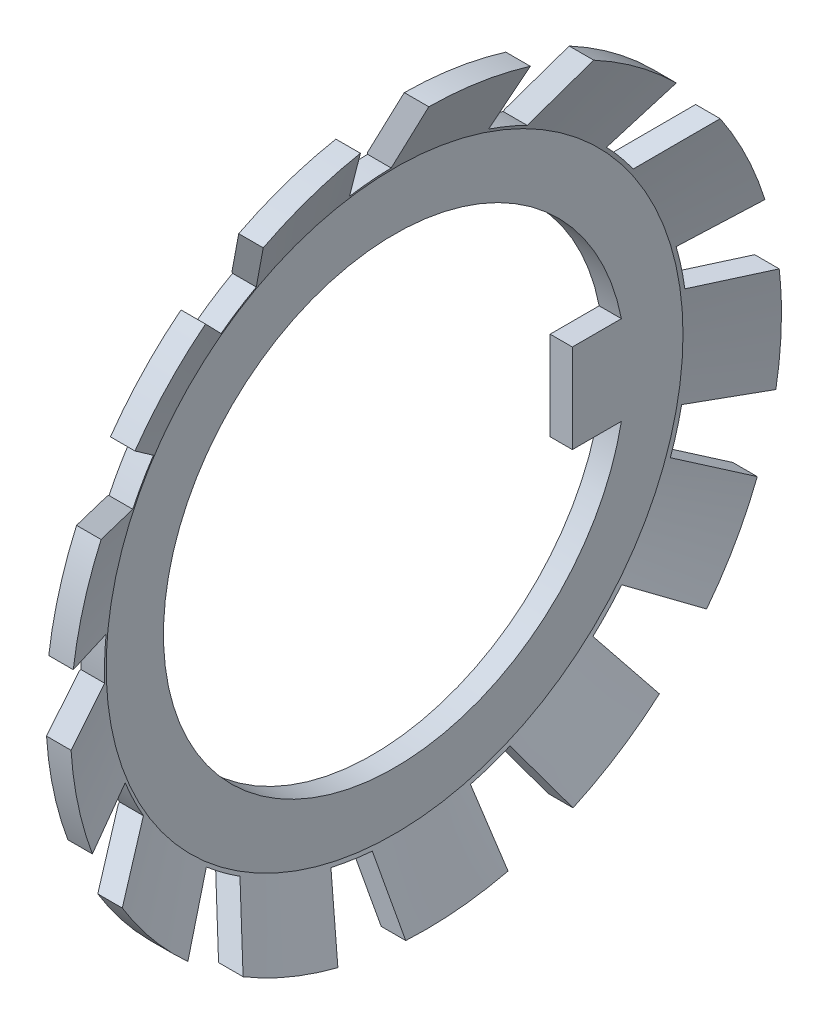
ISO-10303-21;
HEADER;
FILE_DESCRIPTION(('STEP AP214'),'2;1');
FILE_NAME('part.step','',(''),(''),'','','');
FILE_SCHEMA(('AUTOMOTIVE_DESIGN { 1 0 10303 214 1 1 1 1 }'));
ENDSEC;
DATA;
#1=APPLICATION_CONTEXT('core data for automotive mechanical design processes');
#2=APPLICATION_PROTOCOL_DEFINITION('international standard','automotive_design',2000,#1);
#3=PRODUCT_CONTEXT('',#1,'mechanical');
#4=PRODUCT('Part','Part','',(#3));
#5=PRODUCT_RELATED_PRODUCT_CATEGORY('part','',(#4));
#6=PRODUCT_DEFINITION_FORMATION('','',#4);
#7=PRODUCT_DEFINITION_CONTEXT('part definition',#1,'design');
#8=PRODUCT_DEFINITION('design','',#6,#7);
#9=PRODUCT_DEFINITION_SHAPE('','',#8);
#10=(LENGTH_UNIT() NAMED_UNIT(*) SI_UNIT(.MILLI.,.METRE.));
#11=(NAMED_UNIT(*) PLANE_ANGLE_UNIT() SI_UNIT($,.RADIAN.));
#12=(NAMED_UNIT(*) SI_UNIT($,.STERADIAN.) SOLID_ANGLE_UNIT());
#13=UNCERTAINTY_MEASURE_WITH_UNIT(LENGTH_MEASURE(1.E-05),#10,'distance_accuracy_value','');
#14=(GEOMETRIC_REPRESENTATION_CONTEXT(3) GLOBAL_UNCERTAINTY_ASSIGNED_CONTEXT((#13)) GLOBAL_UNIT_ASSIGNED_CONTEXT((#10,
#11,#12)) REPRESENTATION_CONTEXT('',''));
#15=CARTESIAN_POINT('',(0.,0.,0.));
#16=DIRECTION('',(0.,0.,1.));
#17=DIRECTION('',(1.,0.,0.));
#18=AXIS2_PLACEMENT_3D('',#15,#16,#17);
#19=CARTESIAN_POINT('',(0.,0.,0.));
#20=DIRECTION('',(1.,0.,0.));
#21=DIRECTION('',(0.,0.,-1.));
#22=AXIS2_PLACEMENT_3D('',#19,#20,#21);
#23=CONICAL_SURFACE('',#22,16.5,1.13446401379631);
#24=CARTESIAN_POINT('',(3.9750952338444,-9.60131247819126,-23.109443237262));
#25=CARTESIAN_POINT('',(3.22716625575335,-8.85221964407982,-21.6838409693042));
#26=CARTESIAN_POINT('',(2.4797151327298,-8.10302403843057,-20.2580431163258));
#27=CARTESIAN_POINT('',(1.69951538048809,-7.31989159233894,-18.7676598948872));
#28=CARTESIAN_POINT('',(1.6658951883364,-7.2861428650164,-18.7034325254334));
#29=CARTESIAN_POINT('',(1.08750520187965,-6.70550367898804,-17.5984152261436));
#30=CARTESIAN_POINT('',(0.543208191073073,-6.1585111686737,-16.557431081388));
#31=CARTESIAN_POINT('',(-0.167887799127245,-5.44247490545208,-15.1947389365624));
#32=CARTESIAN_POINT('',(-0.335490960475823,-5.27360392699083,-14.873359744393));
#33=CARTESIAN_POINT('',(-0.502997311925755,-5.10471216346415,-14.5519409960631));
#34=B_SPLINE_CURVE_WITH_KNOTS('',3,(#24,#25,#26,#27,#28,#29,#30,#31,#32,#33),.UNSPECIFIED.,.F.,
.F.,(4,2,2,2,4),(0.,5.3269032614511,5.56679915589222,9.4542099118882,10.6538078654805),.UNSPECIFIED.);
#35=CARTESIAN_POINT('',(1.6320768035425,-7.25219296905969,-18.6388223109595));
#36=VERTEX_POINT('',#35);
#37=CARTESIAN_POINT('',(0.,-5.61152908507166,-15.51646677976));
#38=VERTEX_POINT('',#37);
#39=EDGE_CURVE('E481',#36,#38,#34,.T.);
#40=ORIENTED_EDGE('',*,*,#39,.F.);
#41=CARTESIAN_POINT('',(1.6320768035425,0.,0.));
#42=DIRECTION('',(1.,0.,0.));
#43=DIRECTION('',(0.,0.,-1.));
#44=AXIS2_PLACEMENT_3D('',#41,#42,#43);
#45=CIRCLE('',#44,20.);
#46=CARTESIAN_POINT('',(1.6320768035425,-12.2772874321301,-15.7882302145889));
#47=VERTEX_POINT('',#46);
#48=EDGE_CURVE('E1136',#47,#36,#45,.T.);
#49=ORIENTED_EDGE('',*,*,#48,.F.);
#50=CARTESIAN_POINT('',(3.95947915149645,-14.8917336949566,-20.0697002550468));
#51=CARTESIAN_POINT('',(3.21217838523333,-14.053143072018,-18.6964073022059));
#52=CARTESIAN_POINT('',(2.46536047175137,-13.2144361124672,-17.3229238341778));
#53=CARTESIAN_POINT('',(1.69036824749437,-12.342849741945,-15.8955963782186));
#54=CARTESIAN_POINT('',(1.66132185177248,-12.3101812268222,-15.8420977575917));
#55=CARTESIAN_POINT('',(1.08750538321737,-11.6647727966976,-14.7851638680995));
#56=CARTESIAN_POINT('',(0.543207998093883,-11.0519185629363,-13.7815413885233));
#57=CARTESIAN_POINT('',(-0.171828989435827,-10.2452198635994,-12.4604752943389));
#58=CARTESIAN_POINT('',(-0.343369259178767,-10.0515681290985,-12.1433473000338));
#59=CARTESIAN_POINT('',(-0.514807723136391,-9.85789190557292,-11.8261792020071));
#60=B_SPLINE_CURVE_WITH_KNOTS('',3,(#50,#51,#52,#53,#54,#55,#56,#57,#58,#59),.UNSPECIFIED.,.F.,
.F.,(4,2,2,2,4),(0.,5.32246341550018,5.52972471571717,9.41713547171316,10.6449281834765),.UNSPECIFIED.);
#61=CARTESIAN_POINT('',(0.,-10.4390758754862,-12.7779378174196));
#62=VERTEX_POINT('',#61);
#63=EDGE_CURVE('E727',#47,#62,#60,.T.);
#64=ORIENTED_EDGE('',*,*,#63,.T.);
#65=CARTESIAN_POINT('',(0.,0.,0.));
#66=DIRECTION('',(1.,0.,0.));
#67=DIRECTION('',(0.,0.,-1.));
#68=AXIS2_PLACEMENT_3D('',#65,#66,#67);
#69=CIRCLE('',#68,16.5);
#70=EDGE_CURVE('E1532',#62,#38,#69,.T.);
#71=ORIENTED_EDGE('',*,*,#70,.T.);
#72=EDGE_LOOP('',(#40,#49,#64,#71));
#73=FACE_BOUND('',#72,.T.);
#74=ADVANCED_FACE('F32',(#73),#23,.T.);
#75=CARTESIAN_POINT('',(0.,0.,0.));
#76=DIRECTION('',(1.,0.,0.));
#77=DIRECTION('',(0.,0.,-1.));
#78=AXIS2_PLACEMENT_3D('',#75,#76,#77);
#79=CYLINDRICAL_SURFACE('',#78,20.);
#80=DIRECTION('',(1.,0.,0.));
#81=VECTOR('',#80,1.);
#82=CARTESIAN_POINT('',(0.,-7.25219296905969,-18.6388223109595));
#83=LINE('',#82,#81);
#84=CARTESIAN_POINT('',(3.01129920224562,-7.25219296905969,-18.6388223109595));
#85=VERTEX_POINT('',#84);
#86=EDGE_CURVE('E490',#85,#36,#83,.F.);
#87=ORIENTED_EDGE('',*,*,#86,.F.);
#88=CARTESIAN_POINT('',(3.01129920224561,0.,0.));
#89=DIRECTION('',(1.,0.,0.));
#90=DIRECTION('',(0.,0.,-1.));
#91=AXIS2_PLACEMENT_3D('',#88,#89,#90);
#92=CIRCLE('',#91,20.);
#93=CARTESIAN_POINT('',(3.01129920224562,-12.2772874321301,-15.7882302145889));
#94=VERTEX_POINT('',#93);
#95=EDGE_CURVE('E1280',#94,#85,#92,.T.);
#96=ORIENTED_EDGE('',*,*,#95,.F.);
#97=DIRECTION('',(1.,0.,0.));
#98=VECTOR('',#97,1.);
#99=CARTESIAN_POINT('',(0.,-12.2772874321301,-15.7882302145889));
#100=LINE('',#99,#98);
#101=EDGE_CURVE('E722',#94,#47,#100,.F.);
#102=ORIENTED_EDGE('',*,*,#101,.T.);
#103=ORIENTED_EDGE('',*,*,#48,.T.);
#104=EDGE_LOOP('',(#87,#96,#102,#103));
#105=FACE_BOUND('',#104,.T.);
#106=ADVANCED_FACE('F1008',(#105),#79,.T.);
#107=CARTESIAN_POINT('',(3.94563277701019,-19.1881631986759,-15.965203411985));
#108=CARTESIAN_POINT('',(3.19888596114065,-17.8644767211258,-15.0523942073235));
#109=CARTESIAN_POINT('',(2.45262654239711,-16.5406047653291,-14.1394570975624));
#110=CARTESIAN_POINT('',(1.68225163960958,-15.1720054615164,-13.1956761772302));
#111=CARTESIAN_POINT('',(1.65726372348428,-15.127611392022,-13.1650621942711));
#112=CARTESIAN_POINT('',(1.08750555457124,-14.1153177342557,-12.4669883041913));
#113=CARTESIAN_POINT('',(0.543207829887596,-13.1472376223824,-11.7994039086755));
#114=CARTESIAN_POINT('',(-0.175329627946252,-11.8667169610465,-10.9163616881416));
#115=CARTESIAN_POINT('',(-0.350366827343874,-11.5545796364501,-10.7011129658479));
#116=CARTESIAN_POINT('',(-0.525297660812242,-11.242401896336,-10.4858363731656));
#117=B_SPLINE_CURVE_WITH_KNOTS('',3,(#107,#108,#109,#110,#111,#112,#113,#114,#115,#116),
.UNSPECIFIED.,.F.,.F.,(4,2,2,2,4),(0.,5.31854835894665,5.49685149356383,9.38426224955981,
10.6370980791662),.UNSPECIFIED.);
#118=CARTESIAN_POINT('',(1.6320768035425,-15.082861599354,-13.1342029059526));
#119=VERTEX_POINT('',#118);
#120=CARTESIAN_POINT('',(0.,-12.1791755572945,-11.1318319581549));
#121=VERTEX_POINT('',#120);
#122=EDGE_CURVE('E716',#119,#121,#117,.T.);
#123=ORIENTED_EDGE('',*,*,#122,.F.);
#124=CARTESIAN_POINT('',(1.6320768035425,-18.2078212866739,-8.27497697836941));
#125=VERTEX_POINT('',#124);
#126=EDGE_CURVE('E1131',#125,#119,#45,.T.);
#127=ORIENTED_EDGE('',*,*,#126,.F.);
#128=CARTESIAN_POINT('',(3.96217054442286,-22.517365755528,-10.8541861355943));
#129=CARTESIAN_POINT('',(3.21476173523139,-21.1364651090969,-10.0277341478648));
#130=CARTESIAN_POINT('',(2.46783490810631,-19.7553732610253,-9.20116772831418));
#131=CARTESIAN_POINT('',(1.69194518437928,-18.318686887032,-8.34132867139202));
#132=CARTESIAN_POINT('',(1.66211028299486,-18.2634395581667,-8.30826382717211));
#133=CARTESIAN_POINT('',(1.08750535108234,-17.1993426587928,-7.67141497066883));
#134=CARTESIAN_POINT('',(0.54320803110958,-16.1903048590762,-7.06751830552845));
#135=CARTESIAN_POINT('',(-0.171149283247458,-14.863373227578,-6.27336610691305));
#136=CARTESIAN_POINT('',(-0.342010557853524,-14.54579696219,-6.08330063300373));
#137=CARTESIAN_POINT('',(-0.512770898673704,-14.2281807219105,-5.89321123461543));
#138=B_SPLINE_CURVE_WITH_KNOTS('',3,(#128,#129,#130,#131,#132,#133,#134,#135,#136,#137),
.UNSPECIFIED.,.F.,.F.,(4,2,2,2,4),(0.,5.32322700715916,5.53611442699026,9.42352518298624,
10.6464553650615),.UNSPECIFIED.);
#139=CARTESIAN_POINT('',(0.,-15.1812861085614,-6.46363304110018));
#140=VERTEX_POINT('',#139);
#141=EDGE_CURVE('E1994',#125,#140,#138,.T.);
#142=ORIENTED_EDGE('',*,*,#141,.T.);
#143=EDGE_CURVE('E1530',#140,#121,#69,.T.);
#144=ORIENTED_EDGE('',*,*,#143,.T.);
#145=EDGE_LOOP('',(#123,#127,#142,#144));
#146=FACE_BOUND('',#145,.T.);
#147=ADVANCED_FACE('F1010',(#146),#23,.T.);
#148=DIRECTION('',(1.,0.,0.));
#149=VECTOR('',#148,1.);
#150=CARTESIAN_POINT('',(0.,-15.082861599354,-13.1342029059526));
#151=LINE('',#150,#149);
#152=CARTESIAN_POINT('',(3.01129920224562,-15.082861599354,-13.1342029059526));
#153=VERTEX_POINT('',#152);
#154=EDGE_CURVE('E723',#153,#119,#151,.F.);
#155=ORIENTED_EDGE('',*,*,#154,.F.);
#156=CARTESIAN_POINT('',(3.01129920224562,-18.2078212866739,-8.27497697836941));
#157=VERTEX_POINT('',#156);
#158=EDGE_CURVE('E1274',#157,#153,#92,.T.);
#159=ORIENTED_EDGE('',*,*,#158,.F.);
#160=DIRECTION('',(1.,0.,0.));
#161=VECTOR('',#160,1.);
#162=CARTESIAN_POINT('',(0.,-18.2078212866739,-8.27497697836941));
#163=LINE('',#162,#161);
#164=EDGE_CURVE('E752',#157,#125,#163,.F.);
#165=ORIENTED_EDGE('',*,*,#164,.T.);
#166=ORIENTED_EDGE('',*,*,#126,.T.);
#167=EDGE_LOOP('',(#155,#159,#165,#166));
#168=FACE_BOUND('',#167,.T.);
#169=ADVANCED_FACE('F1015',(#168),#79,.T.);
#170=CARTESIAN_POINT('',(1.6322768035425,-19.4592215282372,-4.62123941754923));
#171=CARTESIAN_POINT('',(1.35989626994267,-18.8756139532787,-4.5506151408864));
#172=CARTESIAN_POINT('',(1.08763240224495,-18.2919526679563,-4.47998436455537));
#173=CARTESIAN_POINT('',(0.679487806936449,-17.4163453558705,-4.37402423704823));
#174=CARTESIAN_POINT('',(0.543481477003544,-17.1244570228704,-4.33870186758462));
#175=CARTESIAN_POINT('',(0.271565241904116,-16.5406360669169,-4.26805176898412));
#176=CARTESIAN_POINT('',(0.13565533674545,-16.2487034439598,-4.23272403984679));
#177=CARTESIAN_POINT('',(-0.000199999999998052,-15.9567457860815,-4.19739328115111));
#178=B_SPLINE_CURVE_WITH_KNOTS('',3,(#170,#171,#172,#173,#174,#175,#176,#177),.UNSPECIFIED.,.F.,
.F.,(4,2,2,4),(0.,1.94370544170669,2.91555815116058,3.8874109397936),.UNSPECIFIED.);
#179=CARTESIAN_POINT('',(1.6320768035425,-19.4587930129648,-4.6211875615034));
#180=VERTEX_POINT('',#179);
#181=CARTESIAN_POINT('',(0.,-15.9571755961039,-4.19744529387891));
#182=VERTEX_POINT('',#181);
#183=EDGE_CURVE('E747',#180,#182,#178,.T.);
#184=ORIENTED_EDGE('',*,*,#183,.F.);
#185=CARTESIAN_POINT('',(1.6320768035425,-19.9678442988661,1.13366399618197));
#186=VERTEX_POINT('',#185);
#187=EDGE_CURVE('E1122',#186,#180,#45,.T.);
#188=ORIENTED_EDGE('',*,*,#187,.F.);
#189=CARTESIAN_POINT('',(1.6322768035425,-19.9682752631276,1.13363982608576));
#190=CARTESIAN_POINT('',(1.35989626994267,-19.381332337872,1.1665577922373));
#191=CARTESIAN_POINT('',(1.08763240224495,-18.7943353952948,1.19947878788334));
#192=CARTESIAN_POINT('',(0.679487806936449,-17.9137239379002,1.24886678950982));
#193=CARTESIAN_POINT('',(0.543481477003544,-17.6201674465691,1.26533054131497));
#194=CARTESIAN_POINT('',(0.271565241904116,-17.0330099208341,1.29826054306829));
#195=CARTESIAN_POINT('',(0.13565533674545,-16.7394088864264,1.31472679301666));
#196=CARTESIAN_POINT('',(-0.000199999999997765,-16.4457826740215,1.33119445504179));
#197=B_SPLINE_CURVE_WITH_KNOTS('',3,(#189,#190,#191,#192,#193,#194,#195,#196),.UNSPECIFIED.,.F.,
.F.,(4,2,2,4),(0.,1.94370544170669,2.91555815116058,3.88741093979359),.UNSPECIFIED.);
#198=CARTESIAN_POINT('',(0.,-16.4462149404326,1.33117021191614));
#199=VERTEX_POINT('',#198);
#200=EDGE_CURVE('E769',#186,#199,#197,.T.);
#201=ORIENTED_EDGE('',*,*,#200,.T.);
#202=EDGE_CURVE('E1124',#199,#182,#69,.T.);
#203=ORIENTED_EDGE('',*,*,#202,.T.);
#204=EDGE_LOOP('',(#184,#188,#201,#203));
#205=FACE_BOUND('',#204,.T.);
#206=ADVANCED_FACE('F1018',(#205),#23,.T.);
#207=DIRECTION('',(1.,0.,0.));
#208=VECTOR('',#207,1.);
#209=CARTESIAN_POINT('',(0.,-19.4587930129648,-4.6211875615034));
#210=LINE('',#209,#208);
#211=CARTESIAN_POINT('',(3.01129920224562,-19.4587930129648,-4.6211875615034));
#212=VERTEX_POINT('',#211);
#213=EDGE_CURVE('E744',#212,#180,#210,.F.);
#214=ORIENTED_EDGE('',*,*,#213,.F.);
#215=CARTESIAN_POINT('',(3.01129920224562,-19.9678442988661,1.13366399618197));
#216=VERTEX_POINT('',#215);
#217=EDGE_CURVE('E1279',#216,#212,#92,.T.);
#218=ORIENTED_EDGE('',*,*,#217,.F.);
#219=DIRECTION('',(1.,0.,0.));
#220=VECTOR('',#219,1.);
#221=CARTESIAN_POINT('',(0.,-19.9678442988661,1.13366399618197));
#222=LINE('',#221,#220);
#223=EDGE_CURVE('E777',#216,#186,#222,.F.);
#224=ORIENTED_EDGE('',*,*,#223,.T.);
#225=ORIENTED_EDGE('',*,*,#187,.T.);
#226=EDGE_LOOP('',(#214,#218,#224,#225));
#227=FACE_BOUND('',#226,.T.);
#228=ADVANCED_FACE('F1103',(#227),#79,.T.);
#229=CARTESIAN_POINT('',(1.6322768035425,-19.3780814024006,4.95046638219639));
#230=CARTESIAN_POINT('',(1.35989626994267,-18.8284934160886,4.74180724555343));
#231=CARTESIAN_POINT('',(1.08763240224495,-18.2788548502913,4.53312890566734));
#232=CARTESIAN_POINT('',(0.67948780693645,-17.4542883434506,4.22007014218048));
#233=CARTESIAN_POINT('',(0.543481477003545,-17.179414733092,4.11571034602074));
#234=CARTESIAN_POINT('',(0.271565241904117,-16.6296258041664,3.90697491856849));
#235=CARTESIAN_POINT('',(0.13565533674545,-16.3547104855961,3.80259928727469));
#236=CARTESIAN_POINT('',(-0.000199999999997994,-16.0797715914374,3.69821470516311));
#237=B_SPLINE_CURVE_WITH_KNOTS('',3,(#229,#230,#231,#232,#233,#234,#235,#236),.UNSPECIFIED.,.F.,
.F.,(4,2,2,4),(0.,1.94370544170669,2.91555815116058,3.8874109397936),.UNSPECIFIED.);
#238=CARTESIAN_POINT('',(1.6320768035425,-19.3776778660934,4.950313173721));
#239=VERTEX_POINT('',#238);
#240=CARTESIAN_POINT('',(0.,-16.0801763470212,3.69836837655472));
#241=VERTEX_POINT('',#240);
#242=EDGE_CURVE('E1298',#239,#241,#237,.T.);
#243=ORIENTED_EDGE('',*,*,#242,.F.);
#244=CARTESIAN_POINT('',(1.6320768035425,-17.1542222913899,10.2826386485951));
#245=VERTEX_POINT('',#244);
#246=EDGE_CURVE('E1130',#245,#239,#45,.T.);
#247=ORIENTED_EDGE('',*,*,#246,.F.);
#248=CARTESIAN_POINT('',(3.98681635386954,-21.7734353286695,12.3857883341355));
#249=CARTESIAN_POINT('',(3.2384136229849,-20.3068545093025,11.7180471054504));
#250=CARTESIAN_POINT('',(2.49048508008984,-18.8400741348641,11.0502150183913));
#251=CARTESIAN_POINT('',(1.70637661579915,-17.3001559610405,10.3490829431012));
#252=CARTESIAN_POINT('',(1.66932561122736,-17.2273860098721,10.3159504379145));
#253=CARTESIAN_POINT('',(1.08750507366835,-16.0845802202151,9.79562552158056));
#254=CARTESIAN_POINT('',(0.543208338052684,-15.0143447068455,9.30834219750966));
#255=CARTESIAN_POINT('',(-0.164934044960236,-13.6191810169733,8.67311752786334));
#256=CARTESIAN_POINT('',(-0.329586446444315,-13.2945919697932,8.52533058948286));
#257=CARTESIAN_POINT('',(-0.494145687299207,-12.9699637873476,8.37752583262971));
#258=B_SPLINE_CURVE_WITH_KNOTS('',3,(#248,#249,#250,#251,#252,#253,#254,#255,#256,#257),
.UNSPECIFIED.,.F.,.F.,(4,2,2,2,4),(0.,5.33025144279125,5.59462627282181,9.48203702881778,
10.660504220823),.UNSPECIFIED.);
#259=CARTESIAN_POINT('',(0.,-13.9441297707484,8.82106824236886));
#260=VERTEX_POINT('',#259);
#261=EDGE_CURVE('E1317',#245,#260,#258,.T.);
#262=ORIENTED_EDGE('',*,*,#261,.T.);
#263=EDGE_CURVE('E1524',#260,#241,#69,.T.);
#264=ORIENTED_EDGE('',*,*,#263,.T.);
#265=EDGE_LOOP('',(#243,#247,#262,#264));
#266=FACE_BOUND('',#265,.T.);
#267=ADVANCED_FACE('F1098',(#266),#23,.T.);
#268=DIRECTION('',(1.,0.,0.));
#269=VECTOR('',#268,1.);
#270=CARTESIAN_POINT('',(0.,-19.3776778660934,4.950313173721));
#271=LINE('',#270,#269);
#272=CARTESIAN_POINT('',(3.01129920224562,-19.3776778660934,4.95031317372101));
#273=VERTEX_POINT('',#272);
#274=EDGE_CURVE('E1297',#273,#239,#271,.F.);
#275=ORIENTED_EDGE('',*,*,#274,.F.);
#276=CARTESIAN_POINT('',(3.01129920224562,-17.1542222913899,10.2826386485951));
#277=VERTEX_POINT('',#276);
#278=EDGE_CURVE('E1281',#277,#273,#92,.T.);
#279=ORIENTED_EDGE('',*,*,#278,.F.);
#280=DIRECTION('',(1.,0.,0.));
#281=VECTOR('',#280,1.);
#282=CARTESIAN_POINT('',(0.,-17.1542222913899,10.2826386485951));
#283=LINE('',#282,#281);
#284=EDGE_CURVE('E797',#277,#245,#283,.F.);
#285=ORIENTED_EDGE('',*,*,#284,.T.);
#286=ORIENTED_EDGE('',*,*,#246,.T.);
#287=EDGE_LOOP('',(#275,#279,#285,#286));
#288=FACE_BOUND('',#287,.T.);
#289=ADVANCED_FACE('F1094',(#288),#79,.T.);
#290=CARTESIAN_POINT('',(1.6322768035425,-14.8583817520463,13.3882653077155));
#291=CARTESIAN_POINT('',(1.35989626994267,-14.4686967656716,12.9481162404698));
#292=CARTESIAN_POINT('',(1.08763240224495,-14.0789759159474,12.5079266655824));
#293=CARTESIAN_POINT('',(0.67948780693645,-13.4943175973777,11.8475552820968));
#294=CARTESIAN_POINT('',(0.543481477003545,-13.2994186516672,11.6274169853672));
#295=CARTESIAN_POINT('',(0.271565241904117,-12.9095911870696,11.1871069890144));
#296=CARTESIAN_POINT('',(0.13565533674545,-12.7146626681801,10.9669352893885));
#297=CARTESIAN_POINT('',(-0.000199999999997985,-12.5197174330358,10.7467447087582));
#298=B_SPLINE_CURVE_WITH_KNOTS('',3,(#290,#291,#292,#293,#294,#295,#296,#297),.UNSPECIFIED.,.F.,
.F.,(4,2,2,4),(0.,1.94370544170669,2.91555815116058,3.8874109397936),.UNSPECIFIED.);
#299=CARTESIAN_POINT('',(1.6320768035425,-14.8580956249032,13.3879421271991));
#300=VERTEX_POINT('',#299);
#301=CARTESIAN_POINT('',(0.,-12.520004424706,10.7470688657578));
#302=VERTEX_POINT('',#301);
#303=EDGE_CURVE('E792',#300,#302,#298,.T.);
#304=ORIENTED_EDGE('',*,*,#303,.F.);
#305=CARTESIAN_POINT('',(1.6320768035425,-10.4114168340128,17.0763696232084));
#306=VERTEX_POINT('',#305);
#307=EDGE_CURVE('E1134',#306,#300,#45,.T.);
#308=ORIENTED_EDGE('',*,*,#307,.F.);
#309=CARTESIAN_POINT('',(4.01353206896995,-13.5595865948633,21.130580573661));
#310=CARTESIAN_POINT('',(3.26403487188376,-12.5698254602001,19.8559668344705));
#311=CARTESIAN_POINT('',(2.51500377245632,-11.57993211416,18.5811828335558));
#312=CARTESIAN_POINT('',(1.72198613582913,-10.5304216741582,17.2296239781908));
#313=CARTESIAN_POINT('',(1.6771298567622,-10.4710520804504,17.153167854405));
#314=CARTESIAN_POINT('',(1.08750480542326,-9.69058478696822,16.1480825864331));
#315=CARTESIAN_POINT('',(0.54320867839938,-8.96935257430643,15.2192802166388));
#316=CARTESIAN_POINT('',(-0.158230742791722,-8.03805157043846,14.0199513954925));
#317=CARTESIAN_POINT('',(-0.316186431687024,-7.82821291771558,13.7497213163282));
#318=CARTESIAN_POINT('',(-0.474056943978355,-7.61835015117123,13.4794601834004));
#319=B_SPLINE_CURVE_WITH_KNOTS('',3,(#309,#310,#311,#312,#313,#314,#315,#316,#317,#318),
.UNSPECIFIED.,.F.,.F.,(4,2,2,2,4),(0.,5.33798675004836,5.65805136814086,9.54546212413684,
10.6759748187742),.UNSPECIFIED.);
#320=CARTESIAN_POINT('',(0.,-8.24813449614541,14.2904960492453));
#321=VERTEX_POINT('',#320);
#322=EDGE_CURVE('E814',#306,#321,#319,.T.);
#323=ORIENTED_EDGE('',*,*,#322,.T.);
#324=EDGE_CURVE('E1517',#321,#302,#69,.T.);
#325=ORIENTED_EDGE('',*,*,#324,.T.);
#326=EDGE_LOOP('',(#304,#308,#323,#325));
#327=FACE_BOUND('',#326,.T.);
#328=ADVANCED_FACE('F1089',(#327),#23,.T.);
#329=DIRECTION('',(1.,0.,0.));
#330=VECTOR('',#329,1.);
#331=CARTESIAN_POINT('',(0.,-14.8580956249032,13.3879421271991));
#332=LINE('',#331,#330);
#333=CARTESIAN_POINT('',(3.01129920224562,-14.8580956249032,13.3879421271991));
#334=VERTEX_POINT('',#333);
#335=EDGE_CURVE('E789',#334,#300,#332,.F.);
#336=ORIENTED_EDGE('',*,*,#335,.F.);
#337=CARTESIAN_POINT('',(3.01129920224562,-10.4114168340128,17.0763696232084));
#338=VERTEX_POINT('',#337);
#339=EDGE_CURVE('E1294',#338,#334,#92,.T.);
#340=ORIENTED_EDGE('',*,*,#339,.F.);
#341=DIRECTION('',(1.,0.,0.));
#342=VECTOR('',#341,1.);
#343=CARTESIAN_POINT('',(0.,-10.4114168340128,17.0763696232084));
#344=LINE('',#343,#342);
#345=EDGE_CURVE('E822',#338,#306,#344,.F.);
#346=ORIENTED_EDGE('',*,*,#345,.T.);
#347=ORIENTED_EDGE('',*,*,#307,.T.);
#348=EDGE_LOOP('',(#336,#340,#346,#347));
#349=FACE_BOUND('',#348,.T.);
#350=ADVANCED_FACE('F1085',(#349),#79,.T.);
#351=CARTESIAN_POINT('',(3.85998237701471,-8.08322299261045,23.4221869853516));
#352=CARTESIAN_POINT('',(3.13573284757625,-7.7104234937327,21.9078426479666));
#353=CARTESIAN_POINT('',(2.41195726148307,-7.33757163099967,20.3932856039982));
#354=CARTESIAN_POINT('',(1.67009639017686,-6.95487290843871,18.8387297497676));
#355=CARTESIAN_POINT('',(1.65118631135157,-6.94511754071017,18.7991025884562));
#356=CARTESIAN_POINT('',(1.08750587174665,-6.65431432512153,17.6178343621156));
#357=CARTESIAN_POINT('',(0.543208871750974,-6.37321396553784,16.4759799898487));
#358=CARTESIAN_POINT('',(-0.159028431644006,-6.00982641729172,14.9998678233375));
#359=CARTESIAN_POINT('',(-0.317780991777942,-5.92762890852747,14.6659743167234));
#360=CARTESIAN_POINT('',(-0.476447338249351,-5.84542188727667,14.3320421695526));
#361=B_SPLINE_CURVE_WITH_KNOTS('',3,(#351,#352,#353,#354,#355,#356,#357,#358,#359,#360),
.UNSPECIFIED.,.F.,.F.,(4,2,2,2,4),(0.,5.15856397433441,5.29349963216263,9.18091038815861,
10.3171291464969),.UNSPECIFIED.);
#362=CARTESIAN_POINT('',(1.6320768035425,-6.93525892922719,18.7590560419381));
#363=VERTEX_POINT('',#362);
#364=CARTESIAN_POINT('',(0.,-6.09211904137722,15.3341476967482));
#365=VERTEX_POINT('',#364);
#366=EDGE_CURVE('E1336',#363,#365,#361,.T.);
#367=ORIENTED_EDGE('',*,*,#366,.F.);
#368=CARTESIAN_POINT('',(1.6320768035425,-1.28387098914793,19.9587493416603));
#369=VERTEX_POINT('',#368);
#370=EDGE_CURVE('E1506',#369,#363,#45,.T.);
#371=ORIENTED_EDGE('',*,*,#370,.F.);
#372=CARTESIAN_POINT('',(1.6322768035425,-1.28394698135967,19.9591742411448));
#373=CARTESIAN_POINT('',(1.35989626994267,-1.18045094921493,19.3804911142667));
#374=CARTESIAN_POINT('',(1.08763240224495,-1.07694539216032,18.8017547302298));
#375=CARTESIAN_POINT('',(0.679487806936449,-0.921666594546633,17.9335357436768));
#376=CARTESIAN_POINT('',(0.543481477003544,-0.869903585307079,17.6441103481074));
#377=CARTESIAN_POINT('',(0.271565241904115,-0.766369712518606,17.0652156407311));
#378=CARTESIAN_POINT('',(0.135655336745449,-0.714598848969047,16.7757463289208));
#379=CARTESIAN_POINT('',(-0.000199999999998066,-0.662823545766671,16.4862521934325));
#380=B_SPLINE_CURVE_WITH_KNOTS('',3,(#372,#373,#374,#375,#376,#377,#378,#379),.UNSPECIFIED.,.F.,
.F.,(4,2,2,4),(0.,1.94370544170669,2.91555815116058,3.8874109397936),.UNSPECIFIED.);
#381=CARTESIAN_POINT('',(0.,-0.662899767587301,16.486678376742));
#382=VERTEX_POINT('',#381);
#383=EDGE_CURVE('E1349',#369,#382,#380,.T.);
#384=ORIENTED_EDGE('',*,*,#383,.T.);
#385=EDGE_CURVE('E1529',#382,#365,#69,.T.);
#386=ORIENTED_EDGE('',*,*,#385,.T.);
#387=EDGE_LOOP('',(#367,#371,#384,#386));
#388=FACE_BOUND('',#387,.T.);
#389=ADVANCED_FACE('F1080',(#388),#23,.T.);
#390=DIRECTION('',(1.,0.,0.));
#391=VECTOR('',#390,1.);
#392=CARTESIAN_POINT('',(0.,-6.93525892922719,18.7590560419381));
#393=LINE('',#392,#391);
#394=CARTESIAN_POINT('',(3.01129920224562,-6.93525892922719,18.7590560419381));
#395=VERTEX_POINT('',#394);
#396=EDGE_CURVE('E1334',#395,#363,#393,.F.);
#397=ORIENTED_EDGE('',*,*,#396,.F.);
#398=CARTESIAN_POINT('',(3.01129920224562,-1.28387098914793,19.9587493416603));
#399=VERTEX_POINT('',#398);
#400=EDGE_CURVE('E1293',#399,#395,#92,.T.);
#401=ORIENTED_EDGE('',*,*,#400,.F.);
#402=DIRECTION('',(1.,0.,0.));
#403=VECTOR('',#402,1.);
#404=CARTESIAN_POINT('',(0.,-1.28387098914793,19.9587493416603));
#405=LINE('',#404,#403);
#406=EDGE_CURVE('E842',#399,#369,#405,.F.);
#407=ORIENTED_EDGE('',*,*,#406,.T.);
#408=ORIENTED_EDGE('',*,*,#370,.T.);
#409=EDGE_LOOP('',(#397,#401,#407,#408));
#410=FACE_BOUND('',#409,.T.);
#411=ADVANCED_FACE('F1076',(#410),#79,.T.);
#412=CARTESIAN_POINT('',(1.6322768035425,2.5762057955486,19.8338175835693));
#413=CARTESIAN_POINT('',(1.35989626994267,2.43538249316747,19.2630686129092));
#414=CARTESIAN_POINT('',(1.08763240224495,2.29454623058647,18.6922671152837));
#415=CARTESIAN_POINT('',(0.679487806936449,2.08326399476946,17.8359520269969));
#416=CARTESIAN_POINT('',(0.543481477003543,2.01283194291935,17.5504948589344));
#417=CARTESIAN_POINT('',(0.271565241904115,1.87195715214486,16.9795372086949));
#418=CARTESIAN_POINT('',(0.135655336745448,1.80151441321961,16.6940367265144));
#419=CARTESIAN_POINT('',(-0.000199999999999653,1.73106563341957,16.4085117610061));
#420=B_SPLINE_CURVE_WITH_KNOTS('',3,(#412,#413,#414,#415,#416,#417,#418,#419),.UNSPECIFIED.,.F.,
.F.,(4,2,2,4),(0.,1.94370544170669,2.91555815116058,3.8874109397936),.UNSPECIFIED.);
#421=CARTESIAN_POINT('',(1.6320768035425,2.57610239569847,19.8333985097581));
#422=VERTEX_POINT('',#421);
#423=CARTESIAN_POINT('',(0.,1.7311693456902,16.40893210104));
#424=VERTEX_POINT('',#423);
#425=EDGE_CURVE('E837',#422,#424,#420,.T.);
#426=ORIENTED_EDGE('',*,*,#425,.F.);
#427=CARTESIAN_POINT('',(1.6320768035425,8.13774616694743,18.2695672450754));
#428=VERTEX_POINT('',#427);
#429=EDGE_CURVE('E1502',#428,#422,#45,.T.);
#430=ORIENTED_EDGE('',*,*,#429,.F.);
#431=CARTESIAN_POINT('',(3.95893220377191,9.65008755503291,23.0515462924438));
#432=CARTESIAN_POINT('',(3.21165900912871,9.16490387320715,21.5174097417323));
#433=CARTESIAN_POINT('',(2.46486883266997,8.67965285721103,19.9830602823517));
#434=CARTESIAN_POINT('',(1.69005898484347,8.17547871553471,18.3888764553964));
#435=CARTESIAN_POINT('',(1.66116722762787,8.15667761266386,18.3294279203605));
#436=CARTESIAN_POINT('',(1.08750538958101,7.78335037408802,17.148978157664));
#437=CARTESIAN_POINT('',(0.543207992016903,7.42875809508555,16.0277677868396));
#438=CARTESIAN_POINT('',(-0.171955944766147,6.96192617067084,14.5516589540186));
#439=CARTESIAN_POINT('',(-0.343623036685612,6.84979802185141,14.1971130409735));
#440=CARTESIAN_POINT('',(-0.515188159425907,6.73765568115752,13.8425222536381));
#441=B_SPLINE_CURVE_WITH_KNOTS('',3,(#431,#432,#433,#434,#435,#436,#437,#438,#439,#440),
.UNSPECIFIED.,.F.,.F.,(4,2,2,2,4),(0.,5.32226826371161,5.52842619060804,9.41583694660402,
10.6445378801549),.UNSPECIFIED.);
#442=CARTESIAN_POINT('',(0.,7.0741724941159,14.9065785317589));
#443=VERTEX_POINT('',#442);
#444=EDGE_CURVE('E859',#428,#443,#441,.T.);
#445=ORIENTED_EDGE('',*,*,#444,.T.);
#446=EDGE_CURVE('E2009',#443,#424,#69,.T.);
#447=ORIENTED_EDGE('',*,*,#446,.T.);
#448=EDGE_LOOP('',(#426,#430,#445,#447));
#449=FACE_BOUND('',#448,.T.);
#450=ADVANCED_FACE('F1071',(#449),#23,.T.);
#451=DIRECTION('',(1.,0.,0.));
#452=VECTOR('',#451,1.);
#453=CARTESIAN_POINT('',(0.,2.57610239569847,19.8333985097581));
#454=LINE('',#453,#452);
#455=CARTESIAN_POINT('',(3.01129920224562,2.57610239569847,19.8333985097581));
#456=VERTEX_POINT('',#455);
#457=EDGE_CURVE('E834',#456,#422,#454,.F.);
#458=ORIENTED_EDGE('',*,*,#457,.F.);
#459=CARTESIAN_POINT('',(3.01129920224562,8.13774616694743,18.2695672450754));
#460=VERTEX_POINT('',#459);
#461=EDGE_CURVE('E1292',#460,#456,#92,.T.);
#462=ORIENTED_EDGE('',*,*,#461,.F.);
#463=DIRECTION('',(1.,0.,0.));
#464=VECTOR('',#463,1.);
#465=CARTESIAN_POINT('',(0.,8.13774616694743,18.2695672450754));
#466=LINE('',#465,#464);
#467=EDGE_CURVE('E867',#460,#428,#466,.F.);
#468=ORIENTED_EDGE('',*,*,#467,.T.);
#469=ORIENTED_EDGE('',*,*,#429,.T.);
#470=EDGE_LOOP('',(#458,#462,#468,#469));
#471=FACE_BOUND('',#470,.T.);
#472=ADVANCED_FACE('F1067',(#471),#79,.T.);
#473=CARTESIAN_POINT('',(1.6322768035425,11.4976924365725,16.3652138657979));
#474=CARTESIAN_POINT('',(1.35989626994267,11.1077770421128,15.9252688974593));
#475=CARTESIAN_POINT('',(1.08763240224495,10.7178257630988,15.4852834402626));
#476=CARTESIAN_POINT('',(0.679487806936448,10.1328217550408,14.825218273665));
#477=CARTESIAN_POINT('',(0.543481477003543,9.93780757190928,14.6051820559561));
#478=CARTESIAN_POINT('',(0.271565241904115,9.54774961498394,14.1650762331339));
#479=CARTESIAN_POINT('',(0.135655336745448,9.35270584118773,13.9450066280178));
#480=CARTESIAN_POINT('',(-0.000199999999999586,9.1576453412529,13.7249181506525));
#481=B_SPLINE_CURVE_WITH_KNOTS('',3,(#473,#474,#475,#476,#477,#478,#479,#480),.UNSPECIFIED.,.F.,
.F.,(4,2,2,4),(0.,1.94370544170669,2.91555815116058,3.8874109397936),.UNSPECIFIED.);
#482=CARTESIAN_POINT('',(1.6320768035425,11.4974061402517,16.3648908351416));
#483=VERTEX_POINT('',#482);
#484=CARTESIAN_POINT('',(0.,9.15793250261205,13.7252421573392));
#485=VERTEX_POINT('',#484);
#486=EDGE_CURVE('E1368',#483,#485,#481,.T.);
#487=ORIENTED_EDGE('',*,*,#486,.F.);
#488=CARTESIAN_POINT('',(1.6320768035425,15.6954083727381,12.3957313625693));
#489=VERTEX_POINT('',#488);
#490=EDGE_CURVE('E1498',#489,#483,#45,.T.);
#491=ORIENTED_EDGE('',*,*,#490,.F.);
#492=CARTESIAN_POINT('',(1.6322768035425,15.6957148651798,12.3960352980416));
#493=CARTESIAN_POINT('',(1.35989626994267,15.2782937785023,11.9820966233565));
#494=CARTESIAN_POINT('',(1.08763240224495,14.8608342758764,11.5681198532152));
#495=CARTESIAN_POINT('',(0.679487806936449,14.234562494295,10.9470728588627));
#496=CARTESIAN_POINT('',(0.543481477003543,14.0257914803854,10.7400435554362));
#497=CARTESIAN_POINT('',(0.271565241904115,13.6082177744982,10.3259535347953));
#498=CARTESIAN_POINT('',(0.135655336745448,13.399415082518,10.1188928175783));
#499=CARTESIAN_POINT('',(-0.000199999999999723,13.1905944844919,9.91181434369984));
#500=B_SPLINE_CURVE_WITH_KNOTS('',3,(#492,#493,#494,#495,#496,#497,#498,#499),.UNSPECIFIED.,.F.,
.F.,(4,2,2,4),(0.,1.94370544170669,2.91555815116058,3.8874109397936),.UNSPECIFIED.);
#501=CARTESIAN_POINT('',(0.,13.1909019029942,9.91211919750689));
#502=VERTEX_POINT('',#501);
#503=EDGE_CURVE('E1381',#489,#502,#500,.T.);
#504=ORIENTED_EDGE('',*,*,#503,.T.);
#505=EDGE_CURVE('E2012',#502,#485,#69,.T.);
#506=ORIENTED_EDGE('',*,*,#505,.T.);
#507=EDGE_LOOP('',(#487,#491,#504,#506));
#508=FACE_BOUND('',#507,.T.);
#509=ADVANCED_FACE('F1062',(#508),#23,.T.);
#510=DIRECTION('',(1.,0.,0.));
#511=VECTOR('',#510,1.);
#512=CARTESIAN_POINT('',(0.,11.4974061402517,16.3648908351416));
#513=LINE('',#512,#511);
#514=CARTESIAN_POINT('',(3.01129920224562,11.4974061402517,16.3648908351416));
#515=VERTEX_POINT('',#514);
#516=EDGE_CURVE('E1366',#515,#483,#513,.F.);
#517=ORIENTED_EDGE('',*,*,#516,.F.);
#518=CARTESIAN_POINT('',(3.01129920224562,15.6954083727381,12.3957313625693));
#519=VERTEX_POINT('',#518);
#520=EDGE_CURVE('E1291',#519,#515,#92,.T.);
#521=ORIENTED_EDGE('',*,*,#520,.F.);
#522=DIRECTION('',(1.,0.,0.));
#523=VECTOR('',#522,1.);
#524=CARTESIAN_POINT('',(0.,15.6954083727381,12.3957313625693));
#525=LINE('',#524,#523);
#526=EDGE_CURVE('E887',#519,#489,#525,.F.);
#527=ORIENTED_EDGE('',*,*,#526,.T.);
#528=ORIENTED_EDGE('',*,*,#490,.T.);
#529=EDGE_LOOP('',(#517,#521,#527,#528));
#530=FACE_BOUND('',#529,.T.);
#531=ADVANCED_FACE('F1058',(#530),#79,.T.);
#532=CARTESIAN_POINT('',(3.93046206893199,22.4176907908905,10.9040061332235));
#533=CARTESIAN_POINT('',(3.184324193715,20.9153940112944,10.3345369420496));
#534=CARTESIAN_POINT('',(2.4386788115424,19.4128843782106,9.76498706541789));
#535=CARTESIAN_POINT('',(1.67336277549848,17.8685397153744,9.17957896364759));
#536=CARTESIAN_POINT('',(1.65281945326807,17.8270833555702,9.16386427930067));
#537=CARTESIAN_POINT('',(1.08750575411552,16.6862367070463,8.73140843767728));
#538=CARTESIAN_POINT('',(0.543207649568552,15.5866414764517,8.31458959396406));
#539=CARTESIAN_POINT('',(-0.1791610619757,14.1244040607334,7.76030553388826));
#540=CARTESIAN_POINT('',(-0.358025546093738,13.7621047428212,7.62297028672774));
#541=CARTESIAN_POINT('',(-0.536778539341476,13.3997573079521,7.48561680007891));
#542=B_SPLINE_CURVE_WITH_KNOTS('',3,(#532,#533,#534,#535,#536,#537,#538,#539,#540,#541),
.UNSPECIFIED.,.F.,.F.,(4,2,2,2,4),(0.,5.314244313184,5.46083381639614,9.34824457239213,
10.628489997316),.UNSPECIFIED.);
#543=CARTESIAN_POINT('',(1.6320768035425,17.7852230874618,9.14799648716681));
#544=VERTEX_POINT('',#543);
#545=CARTESIAN_POINT('',(0.,14.4870665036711,7.89777842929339));
#546=VERTEX_POINT('',#545);
#547=EDGE_CURVE('E882',#544,#546,#542,.T.);
#548=ORIENTED_EDGE('',*,*,#547,.F.);
#549=CARTESIAN_POINT('',(1.6320768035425,19.6580292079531,3.68264682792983));
#550=VERTEX_POINT('',#549);
#551=EDGE_CURVE('E1494',#550,#544,#45,.T.);
#552=ORIENTED_EDGE('',*,*,#551,.F.);
#553=CARTESIAN_POINT('',(1.6322768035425,19.6584418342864,3.68277353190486));
#554=CARTESIAN_POINT('',(1.35989626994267,19.0964738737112,3.51021165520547));
#555=CARTESIAN_POINT('',(1.08763240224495,18.5344541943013,3.33763389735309));
#556=CARTESIAN_POINT('',(0.679487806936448,17.6913135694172,3.0787331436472));
#557=CARTESIAN_POINT('',(0.543481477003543,17.4102481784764,2.99242720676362));
#558=CARTESIAN_POINT('',(0.271565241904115,16.8480747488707,2.81980223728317));
#559=CARTESIAN_POINT('',(0.135655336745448,16.5669667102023,2.73348320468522));
#560=CARTESIAN_POINT('',(-0.000199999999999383,16.2858345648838,2.64715676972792));
#561=B_SPLINE_CURVE_WITH_KNOTS('',3,(#553,#554,#555,#556,#557,#558,#559,#560),.UNSPECIFIED.,.F.,
.F.,(4,2,2,4),(0.,1.94370544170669,2.91555815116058,3.8874109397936),.UNSPECIFIED.);
#562=CARTESIAN_POINT('',(0.,16.286248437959,2.64728385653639));
#563=VERTEX_POINT('',#562);
#564=EDGE_CURVE('E904',#550,#563,#561,.T.);
#565=ORIENTED_EDGE('',*,*,#564,.T.);
#566=EDGE_CURVE('E2015',#563,#546,#69,.T.);
#567=ORIENTED_EDGE('',*,*,#566,.T.);
#568=EDGE_LOOP('',(#548,#552,#565,#567));
#569=FACE_BOUND('',#568,.T.);
#570=ADVANCED_FACE('F1053',(#569),#23,.T.);
#571=DIRECTION('',(1.,0.,0.));
#572=VECTOR('',#571,1.);
#573=CARTESIAN_POINT('',(0.,17.7852230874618,9.14799648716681));
#574=LINE('',#573,#572);
#575=CARTESIAN_POINT('',(3.01129920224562,17.7852230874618,9.14799648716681));
#576=VERTEX_POINT('',#575);
#577=EDGE_CURVE('E879',#576,#544,#574,.F.);
#578=ORIENTED_EDGE('',*,*,#577,.F.);
#579=CARTESIAN_POINT('',(3.01129920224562,19.6580292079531,3.68264682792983));
#580=VERTEX_POINT('',#579);
#581=EDGE_CURVE('E1290',#580,#576,#92,.T.);
#582=ORIENTED_EDGE('',*,*,#581,.F.);
#583=DIRECTION('',(1.,0.,0.));
#584=VECTOR('',#583,1.);
#585=CARTESIAN_POINT('',(0.,19.6580292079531,3.68264682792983));
#586=LINE('',#585,#584);
#587=EDGE_CURVE('E912',#580,#550,#586,.F.);
#588=ORIENTED_EDGE('',*,*,#587,.T.);
#589=ORIENTED_EDGE('',*,*,#551,.T.);
#590=EDGE_LOOP('',(#578,#582,#588,#589));
#591=FACE_BOUND('',#590,.T.);
#592=ADVANCED_FACE('F1049',(#591),#79,.T.);
#593=CARTESIAN_POINT('',(1.6322768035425,19.9997540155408,-0.164303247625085));
#594=CARTESIAN_POINT('',(1.35989626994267,19.416183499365,-0.0933734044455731));
#595=CARTESIAN_POINT('',(1.08763240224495,18.832559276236,-0.0224370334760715));
#596=CARTESIAN_POINT('',(0.679487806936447,17.9570075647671,0.0839815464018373));
#597=CARTESIAN_POINT('',(0.543481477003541,17.665137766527,0.11945674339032));
#598=CARTESIAN_POINT('',(0.271565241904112,17.0813538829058,0.19041252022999));
#599=CARTESIAN_POINT('',(0.135655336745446,16.789439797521,0.225893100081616));
#600=CARTESIAN_POINT('',(-0.000200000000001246,16.4975006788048,0.261376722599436));
#601=B_SPLINE_CURVE_WITH_KNOTS('',3,(#593,#594,#595,#596,#597,#598,#599,#600),.UNSPECIFIED.,.F.,
.F.,(4,2,2,4),(0.,1.94370544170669,2.91555815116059,3.88741093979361),.UNSPECIFIED.);
#602=CARTESIAN_POINT('',(1.6320768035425,19.9993255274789,-0.164251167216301));
#603=VERTEX_POINT('',#602);
#604=CARTESIAN_POINT('',(0.,16.4979304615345,0.261324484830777));
#605=VERTEX_POINT('',#604);
#606=EDGE_CURVE('E1400',#603,#605,#601,.T.);
#607=ORIENTED_EDGE('',*,*,#606,.F.);
#608=CARTESIAN_POINT('',(1.6320768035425,19.1179683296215,-5.87394985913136));
#609=VERTEX_POINT('',#608);
#610=EDGE_CURVE('E1492',#609,#603,#45,.T.);
#611=ORIENTED_EDGE('',*,*,#610,.F.);
#612=CARTESIAN_POINT('',(1.6322768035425,19.1183925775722,-5.87402940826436));
#613=CARTESIAN_POINT('',(1.35989626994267,18.5405967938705,-5.7656891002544));
#614=CARTESIAN_POINT('',(1.08763240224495,17.9627478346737,-5.65733882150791));
#615=CARTESIAN_POINT('',(0.679487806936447,17.095860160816,-5.49479198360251));
#616=CARTESIAN_POINT('',(0.543481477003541,16.8068785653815,-5.44060613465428));
#617=CARTESIAN_POINT('',(0.271565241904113,16.2288715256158,-5.33222621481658));
#618=CARTESIAN_POINT('',(0.135655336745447,15.9398460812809,-5.27803214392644));
#619=CARTESIAN_POINT('',(-0.000200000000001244,15.6507958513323,-5.22383342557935));
#620=B_SPLINE_CURVE_WITH_KNOTS('',3,(#612,#613,#614,#615,#616,#617,#618,#619),.UNSPECIFIED.,.F.,
.F.,(4,2,2,4),(0.,1.94370544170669,2.91555815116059,3.8874109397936),.UNSPECIFIED.);
#621=CARTESIAN_POINT('',(0.,15.6512213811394,-5.2239132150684));
#622=VERTEX_POINT('',#621);
#623=EDGE_CURVE('E1413',#609,#622,#620,.T.);
#624=ORIENTED_EDGE('',*,*,#623,.T.);
#625=EDGE_CURVE('E2018',#622,#605,#69,.T.);
#626=ORIENTED_EDGE('',*,*,#625,.T.);
#627=EDGE_LOOP('',(#607,#611,#624,#626));
#628=FACE_BOUND('',#627,.T.);
#629=ADVANCED_FACE('F1044',(#628),#23,.T.);
#630=DIRECTION('',(1.,0.,0.));
#631=VECTOR('',#630,1.);
#632=CARTESIAN_POINT('',(0.,19.9993255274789,-0.164251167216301));
#633=LINE('',#632,#631);
#634=CARTESIAN_POINT('',(3.01129920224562,19.9993255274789,-0.164251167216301));
#635=VERTEX_POINT('',#634);
#636=EDGE_CURVE('E1398',#635,#603,#633,.F.);
#637=ORIENTED_EDGE('',*,*,#636,.F.);
#638=CARTESIAN_POINT('',(3.01129920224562,19.1179683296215,-5.87394985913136));
#639=VERTEX_POINT('',#638);
#640=EDGE_CURVE('E1289',#639,#635,#92,.T.);
#641=ORIENTED_EDGE('',*,*,#640,.F.);
#642=DIRECTION('',(1.,0.,0.));
#643=VECTOR('',#642,1.);
#644=CARTESIAN_POINT('',(0.,19.1179683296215,-5.87394985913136));
#645=LINE('',#644,#643);
#646=EDGE_CURVE('E932',#639,#609,#645,.F.);
#647=ORIENTED_EDGE('',*,*,#646,.T.);
#648=ORIENTED_EDGE('',*,*,#610,.T.);
#649=EDGE_LOOP('',(#637,#641,#647,#648));
#650=FACE_BOUND('',#649,.T.);
#651=ADVANCED_FACE('F1040',(#650),#79,.T.);
#652=CARTESIAN_POINT('',(3.9460609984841,21.7371496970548,-12.2725505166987));
#653=CARTESIAN_POINT('',(3.1992970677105,20.4139113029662,-11.3590276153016));
#654=CARTESIAN_POINT('',(2.45302039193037,19.0904875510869,-10.445376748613));
#655=CARTESIAN_POINT('',(1.68250269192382,17.7221296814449,-9.50070475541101));
#656=CARTESIAN_POINT('',(1.65738924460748,17.6775287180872,-9.46991362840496));
#657=CARTESIAN_POINT('',(1.08750554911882,16.6653777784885,-8.7711558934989));
#658=CARTESIAN_POINT('',(0.543207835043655,15.6976473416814,-8.10306470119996));
#659=CARTESIAN_POINT('',(-0.175221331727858,14.4177821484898,-7.21948531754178));
#660=CARTESIAN_POINT('',(-0.35015035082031,14.1059505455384,-7.0042064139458));
#661=CARTESIAN_POINT('',(-0.524973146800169,13.7940785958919,-6.78889965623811));
#662=B_SPLINE_CURVE_WITH_KNOTS('',3,(#652,#653,#654,#655,#656,#657,#658,#659,#660,#661),
.UNSPECIFIED.,.F.,.F.,(4,2,2,2,4),(0.,5.31866932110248,5.49786815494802,9.38527891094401,
10.6373400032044),.UNSPECIFIED.);
#663=CARTESIAN_POINT('',(1.6320768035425,17.6325721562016,-9.43887700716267));
#664=VERTEX_POINT('',#663);
#665=CARTESIAN_POINT('',(0.,14.7299349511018,-7.43498596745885));
#666=VERTEX_POINT('',#665);
#667=EDGE_CURVE('E927',#664,#666,#662,.T.);
#668=ORIENTED_EDGE('',*,*,#667,.F.);
#669=CARTESIAN_POINT('',(1.6320768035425,14.1989269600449,-14.0851153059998));
#670=VERTEX_POINT('',#669);
#671=EDGE_CURVE('E1142',#670,#664,#45,.T.);
#672=ORIENTED_EDGE('',*,*,#671,.F.);
#673=CARTESIAN_POINT('',(4.0109471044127,18.2222545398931,-17.263688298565));
#674=CARTESIAN_POINT('',(3.26155588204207,16.9561546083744,-16.2634239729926));
#675=CARTESIAN_POINT('',(2.51263152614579,15.6898852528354,-15.2630257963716));
#676=CARTESIAN_POINT('',(1.72047593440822,14.3486217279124,-14.2033795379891));
#677=CARTESIAN_POINT('',(1.676374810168,14.2739442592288,-14.1443816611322));
#678=CARTESIAN_POINT('',(1.0875048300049,13.2767112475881,-13.3565318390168));
#679=CARTESIAN_POINT('',(0.543208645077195,12.3539836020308,-12.6275439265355));
#680=CARTESIAN_POINT('',(-0.158879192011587,11.1613973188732,-11.6853580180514));
#681=CARTESIAN_POINT('',(-0.317482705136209,10.8918329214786,-11.4723924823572));
#682=CARTESIAN_POINT('',(-0.476000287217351,10.6222374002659,-11.2594023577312));
#683=B_SPLINE_CURVE_WITH_KNOTS('',3,(#673,#674,#675,#676,#677,#678,#679,#680,#681,#682),
.UNSPECIFIED.,.F.,.F.,(4,2,2,2,4),(0.,5.33723777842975,5.6519145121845,9.53932526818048,
10.6744768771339),.UNSPECIFIED.);
#684=CARTESIAN_POINT('',(0.,11.4312740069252,-11.8985702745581));
#685=VERTEX_POINT('',#684);
#686=EDGE_CURVE('E949',#670,#685,#683,.T.);
#687=ORIENTED_EDGE('',*,*,#686,.T.);
#688=EDGE_CURVE('E1150',#685,#666,#69,.T.);
#689=ORIENTED_EDGE('',*,*,#688,.T.);
#690=EDGE_LOOP('',(#668,#672,#687,#689));
#691=FACE_BOUND('',#690,.T.);
#692=ADVANCED_FACE('F1033',(#691),#23,.T.);
#693=DIRECTION('',(1.,0.,0.));
#694=VECTOR('',#693,1.);
#695=CARTESIAN_POINT('',(0.,17.6325721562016,-9.43887700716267));
#696=LINE('',#695,#694);
#697=CARTESIAN_POINT('',(3.01129920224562,17.6325721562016,-9.43887700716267));
#698=VERTEX_POINT('',#697);
#699=EDGE_CURVE('E924',#698,#664,#696,.F.);
#700=ORIENTED_EDGE('',*,*,#699,.F.);
#701=CARTESIAN_POINT('',(3.01129920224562,14.1989269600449,-14.0851153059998));
#702=VERTEX_POINT('',#701);
#703=EDGE_CURVE('E1288',#702,#698,#92,.T.);
#704=ORIENTED_EDGE('',*,*,#703,.F.);
#705=DIRECTION('',(1.,0.,0.));
#706=VECTOR('',#705,1.);
#707=CARTESIAN_POINT('',(0.,14.1989269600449,-14.0851153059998));
#708=LINE('',#707,#706);
#709=EDGE_CURVE('E957',#702,#670,#708,.F.);
#710=ORIENTED_EDGE('',*,*,#709,.T.);
#711=ORIENTED_EDGE('',*,*,#671,.T.);
#712=EDGE_LOOP('',(#700,#704,#710,#711));
#713=FACE_BOUND('',#712,.T.);
#714=ADVANCED_FACE('F1031',(#713),#79,.T.);
#715=CARTESIAN_POINT('',(3.97470642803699,13.5734583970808,-21.0226322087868));
#716=CARTESIAN_POINT('',(3.22679317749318,12.8251276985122,-19.5966676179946));
#717=CARTESIAN_POINT('',(2.47935790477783,12.0766943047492,-18.1705073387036));
#718=CARTESIAN_POINT('',(1.69928780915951,11.2944719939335,-16.6799613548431));
#719=CARTESIAN_POINT('',(1.66578140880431,11.2608710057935,-16.6159337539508));
#720=CARTESIAN_POINT('',(1.08750520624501,10.6809245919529,-15.5108300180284));
#721=CARTESIAN_POINT('',(0.543208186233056,10.1344772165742,-14.4695596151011));
#722=CARTESIAN_POINT('',(-0.167985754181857,9.4190560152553,-13.1063049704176));
#723=CARTESIAN_POINT('',(-0.335686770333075,9.25025477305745,-12.7846495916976));
#724=CARTESIAN_POINT('',(-0.503290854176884,9.08143274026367,-12.462954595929));
#725=B_SPLINE_CURVE_WITH_KNOTS('',3,(#715,#716,#717,#718,#719,#720,#721,#722,#723,#724),
.UNSPECIFIED.,.F.,.F.,(4,2,2,2,4),(0.,5.3267921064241,5.56587608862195,9.45328684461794,
10.6535855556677),.UNSPECIFIED.);
#726=CARTESIAN_POINT('',(1.6320768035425,11.2270690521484,-16.5515232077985));
#727=VERTEX_POINT('',#726);
#728=CARTESIAN_POINT('',(0.,9.58804025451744,-13.4283090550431));
#729=VERTEX_POINT('',#728);
#730=EDGE_CURVE('E1432',#727,#729,#725,.T.);
#731=ORIENTED_EDGE('',*,*,#730,.F.);
#732=CARTESIAN_POINT('',(1.6320768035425,6.02761405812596,-19.0700778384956));
#733=VERTEX_POINT('',#732);
#734=EDGE_CURVE('E1137',#733,#727,#45,.T.);
#735=ORIENTED_EDGE('',*,*,#734,.F.);
#736=CARTESIAN_POINT('',(1.6322768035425,6.02778962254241,-19.0704721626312));
#737=CARTESIAN_POINT('',(1.35989626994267,5.78868327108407,-18.5334305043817));
#738=CARTESIAN_POINT('',(1.08763240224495,5.5495549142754,-17.9963394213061));
#739=CARTESIAN_POINT('',(0.679487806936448,5.19081510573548,-17.190596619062));
#740=CARTESIAN_POINT('',(0.543481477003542,5.07122729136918,-16.9219979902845));
#741=CARTESIAN_POINT('',(0.271565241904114,4.832033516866,-16.3847599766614));
#742=CARTESIAN_POINT('',(0.135655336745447,4.71242755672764,-16.1161205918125));
#743=CARTESIAN_POINT('',(-0.000200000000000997,4.59281133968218,-15.8474581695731));
#744=B_SPLINE_CURVE_WITH_KNOTS('',3,(#736,#737,#738,#739,#740,#741,#742,#743),.UNSPECIFIED.,.F.,
.F.,(4,2,2,4),(0.,1.94370544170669,2.91555815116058,3.88741093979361),.UNSPECIFIED.);
#745=CARTESIAN_POINT('',(0.,4.59298743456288,-15.8478536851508));
#746=VERTEX_POINT('',#745);
#747=EDGE_CURVE('E1443',#733,#746,#744,.T.);
#748=ORIENTED_EDGE('',*,*,#747,.T.);
#749=EDGE_CURVE('E1146',#746,#729,#69,.T.);
#750=ORIENTED_EDGE('',*,*,#749,.T.);
#751=EDGE_LOOP('',(#731,#735,#748,#750));
#752=FACE_BOUND('',#751,.T.);
#753=ADVANCED_FACE('F1021',(#752),#23,.T.);
#754=DIRECTION('',(1.,0.,0.));
#755=VECTOR('',#754,1.);
#756=CARTESIAN_POINT('',(0.,11.2270690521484,-16.5515232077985));
#757=LINE('',#756,#755);
#758=CARTESIAN_POINT('',(3.01129920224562,11.2270690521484,-16.5515232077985));
#759=VERTEX_POINT('',#758);
#760=EDGE_CURVE('E1430',#759,#727,#757,.F.);
#761=ORIENTED_EDGE('',*,*,#760,.F.);
#762=CARTESIAN_POINT('',(3.01129920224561,6.02761405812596,-19.0700778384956));
#763=VERTEX_POINT('',#762);
#764=EDGE_CURVE('E1144',#763,#759,#92,.T.);
#765=ORIENTED_EDGE('',*,*,#764,.F.);
#766=DIRECTION('',(1.,0.,0.));
#767=VECTOR('',#766,1.);
#768=CARTESIAN_POINT('',(0.,6.02761405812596,-19.0700778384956));
#769=LINE('',#768,#767);
#770=EDGE_CURVE('E979',#763,#733,#769,.F.);
#771=ORIENTED_EDGE('',*,*,#770,.T.);
#772=ORIENTED_EDGE('',*,*,#734,.T.);
#773=EDGE_LOOP('',(#761,#765,#771,#772));
#774=FACE_BOUND('',#773,.T.);
#775=ADVANCED_FACE('F1027',(#774),#79,.T.);
#776=CARTESIAN_POINT('',(0.,0.,0.));
#777=DIRECTION('',(1.,0.,0.));
#778=DIRECTION('',(0.,0.,-1.));
#779=AXIS2_PLACEMENT_3D('',#776,#777,#778);
#780=PLANE('',#779);
#781=DIRECTION('',(0.,0.,-1.));
#782=VECTOR('',#781,1.);
#783=CARTESIAN_POINT('',(0.,2.5,-10.));
#784=LINE('',#783,#782);
#785=CARTESIAN_POINT('',(0.,2.5,-10.));
#786=VERTEX_POINT('',#785);
#787=CARTESIAN_POINT('',(0.,2.5,-12.7573508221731));
#788=VERTEX_POINT('',#787);
#789=EDGE_CURVE('E1449',#786,#788,#784,.T.);
#790=ORIENTED_EDGE('',*,*,#789,.T.);
#791=CARTESIAN_POINT('',(0.,0.,0.));
#792=DIRECTION('',(-1.,0.,0.));
#793=DIRECTION('',(0.,0.,1.));
#794=AXIS2_PLACEMENT_3D('',#791,#792,#793);
#795=CIRCLE('',#794,13.);
#796=CARTESIAN_POINT('',(0.,-2.5,-12.7573508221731));
#797=VERTEX_POINT('',#796);
#798=EDGE_CURVE('E1155',#797,#788,#795,.T.);
#799=ORIENTED_EDGE('',*,*,#798,.F.);
#800=DIRECTION('',(0.,0.,1.));
#801=VECTOR('',#800,1.);
#802=CARTESIAN_POINT('',(0.,-2.5,-14.));
#803=LINE('',#802,#801);
#804=CARTESIAN_POINT('',(0.,-2.5,-10.));
#805=VERTEX_POINT('',#804);
#806=EDGE_CURVE('E1455',#797,#805,#803,.T.);
#807=ORIENTED_EDGE('',*,*,#806,.T.);
#808=DIRECTION('',(0.,-1.,0.));
#809=VECTOR('',#808,1.);
#810=CARTESIAN_POINT('',(0.,2.5,-10.));
#811=LINE('',#810,#809);
#812=EDGE_CURVE('E1452',#786,#805,#811,.T.);
#813=ORIENTED_EDGE('',*,*,#812,.F.);
#814=EDGE_LOOP('',(#790,#799,#807,#813));
#815=FACE_BOUND('',#814,.T.);
#816=CARTESIAN_POINT('',(0.,-3.30578993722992,-16.1654493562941));
#817=VERTEX_POINT('',#816);
#818=CARTESIAN_POINT('',(0.,2.25000000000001,-16.3458710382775));
#819=VERTEX_POINT('',#818);
#820=EDGE_CURVE('E1141',#817,#819,#69,.T.);
#821=ORIENTED_EDGE('',*,*,#820,.F.);
#822=DIRECTION('',(0.,-0.0648806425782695,-0.997893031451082));
#823=VECTOR('',#822,1.);
#824=CARTESIAN_POINT('',(0.,-3.29924031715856,-16.0647132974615));
#825=LINE('',#824,#823);
#826=CARTESIAN_POINT('',(0.,-3.29924031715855,-16.0647132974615));
#827=VERTEX_POINT('',#826);
#828=EDGE_CURVE('E475',#827,#817,#825,.T.);
#829=ORIENTED_EDGE('',*,*,#828,.F.);
#830=CARTESIAN_POINT('',(0.,0.,0.));
#831=DIRECTION('',(-1.,0.,0.));
#832=DIRECTION('',(0.,0.465151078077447,0.885231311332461));
#833=AXIS2_PLACEMENT_3D('',#830,#831,#832);
#834=CIRCLE('',#833,16.4);
#835=CARTESIAN_POINT('',(0.,-5.56457266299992,-15.4271037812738));
#836=VERTEX_POINT('',#835);
#837=EDGE_CURVE('E470',#827,#836,#834,.T.);
#838=ORIENTED_EDGE('',*,*,#837,.T.);
#839=DIRECTION('',(0.,-0.465151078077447,-0.885231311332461));
#840=VECTOR('',#839,1.);
#841=CARTESIAN_POINT('',(0.,-5.56457266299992,-15.4271037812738));
#842=LINE('',#841,#840);
#843=EDGE_CURVE('E478',#836,#38,#842,.T.);
#844=ORIENTED_EDGE('',*,*,#843,.T.);
#845=ORIENTED_EDGE('',*,*,#70,.F.);
#846=DIRECTION('',(0.,-0.521158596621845,-0.853459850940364));
#847=VECTOR('',#846,1.);
#848=CARTESIAN_POINT('',(0.,-10.3864655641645,-12.6917821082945));
#849=LINE('',#848,#847);
#850=CARTESIAN_POINT('',(0.,-10.3864655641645,-12.6917821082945));
#851=VERTEX_POINT('',#850);
#852=EDGE_CURVE('E1984',#851,#62,#849,.T.);
#853=ORIENTED_EDGE('',*,*,#852,.F.);
#854=CARTESIAN_POINT('',(0.,0.,0.));
#855=DIRECTION('',(-1.,0.,0.));
#856=DIRECTION('',(0.,0.823235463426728,0.567700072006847));
#857=AXIS2_PLACEMENT_3D('',#854,#855,#856);
#858=CIRCLE('',#857,16.4);
#859=CARTESIAN_POINT('',(0.,-12.0960709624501,-11.0745233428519));
#860=VERTEX_POINT('',#859);
#861=EDGE_CURVE('E1981',#851,#860,#858,.T.);
#862=ORIENTED_EDGE('',*,*,#861,.T.);
#863=DIRECTION('',(0.,-0.823235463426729,-0.567700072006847));
#864=VECTOR('',#863,1.);
#865=CARTESIAN_POINT('',(0.,-12.0960709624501,-11.0745233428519));
#866=LINE('',#865,#864);
#867=EDGE_CURVE('E1978',#860,#121,#866,.T.);
#868=ORIENTED_EDGE('',*,*,#867,.T.);
#869=ORIENTED_EDGE('',*,*,#143,.F.);
#870=DIRECTION('',(0.,-0.858064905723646,-0.513541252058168));
#871=VECTOR('',#870,1.);
#872=CARTESIAN_POINT('',(0.,-15.0946655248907,-6.41179169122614));
#873=LINE('',#872,#871);
#874=CARTESIAN_POINT('',(0.,-15.0946655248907,-6.41179169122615));
#875=VERTEX_POINT('',#874);
#876=EDGE_CURVE('E739',#875,#140,#873,.T.);
#877=ORIENTED_EDGE('',*,*,#876,.F.);
#878=CARTESIAN_POINT('',(0.,0.,0.));
#879=DIRECTION('',(-1.,0.,0.));
#880=DIRECTION('',(0.,0.992757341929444,0.120136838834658));
#881=AXIS2_PLACEMENT_3D('',#878,#879,#880);
#882=CIRCLE('',#881,16.4);
#883=CARTESIAN_POINT('',(0.,-15.8569579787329,-4.1853176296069));
#884=VERTEX_POINT('',#883);
#885=EDGE_CURVE('E736',#875,#884,#882,.T.);
#886=ORIENTED_EDGE('',*,*,#885,.T.);
#887=DIRECTION('',(0.,-0.992757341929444,-0.120136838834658));
#888=VECTOR('',#887,1.);
#889=CARTESIAN_POINT('',(0.,-15.8569579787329,-4.1853176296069));
#890=LINE('',#889,#888);
#891=EDGE_CURVE('E733',#884,#182,#890,.T.);
#892=ORIENTED_EDGE('',*,*,#891,.T.);
#893=ORIENTED_EDGE('',*,*,#202,.F.);
#894=DIRECTION('',(0.,-0.998431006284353,-0.0559957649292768));
#895=VECTOR('',#894,1.);
#896=CARTESIAN_POINT('',(0.,-16.3454245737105,1.33682291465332));
#897=LINE('',#896,#895);
#898=CARTESIAN_POINT('',(0.,-16.3454245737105,1.33682291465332));
#899=VERTEX_POINT('',#898);
#900=EDGE_CURVE('E1998',#899,#199,#897,.T.);
#901=ORIENTED_EDGE('',*,*,#900,.F.);
#902=CARTESIAN_POINT('',(0.,0.,0.));
#903=DIRECTION('',(-1.,0.,0.));
#904=DIRECTION('',(0.,0.934887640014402,-0.354943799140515));
#905=AXIS2_PLACEMENT_3D('',#902,#903,#904);
#906=CIRCLE('',#905,16.4);
#907=CARTESIAN_POINT('',(0.,-15.9858006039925,3.66253724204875));
#908=VERTEX_POINT('',#907);
#909=EDGE_CURVE('E2000',#899,#908,#906,.T.);
#910=ORIENTED_EDGE('',*,*,#909,.T.);
#911=DIRECTION('',(0.,-0.934887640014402,0.354943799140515));
#912=VECTOR('',#911,1.);
#913=CARTESIAN_POINT('',(0.,-15.9858006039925,3.66253724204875));
#914=LINE('',#913,#912);
#915=EDGE_CURVE('E1528',#908,#241,#914,.T.);
#916=ORIENTED_EDGE('',*,*,#915,.T.);
#917=ORIENTED_EDGE('',*,*,#263,.F.);
#918=DIRECTION('',(0.,-0.910105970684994,0.414375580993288));
#919=VECTOR('',#918,1.);
#920=CARTESIAN_POINT('',(0.,-13.8522557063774,8.77923754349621));
#921=LINE('',#920,#919);
#922=CARTESIAN_POINT('',(0.,-13.8522557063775,8.77923754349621));
#923=VERTEX_POINT('',#922);
#924=EDGE_CURVE('E784',#923,#260,#921,.T.);
#925=ORIENTED_EDGE('',*,*,#924,.F.);
#926=CARTESIAN_POINT('',(0.,0.,0.));
#927=DIRECTION('',(-1.,0.,0.));
#928=DIRECTION('',(0.,0.662881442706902,-0.748724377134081));
#929=AXIS2_PLACEMENT_3D('',#926,#927,#928);
#930=CIRCLE('',#929,16.4);
#931=CARTESIAN_POINT('',(0.,-12.4530873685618,10.6714860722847));
#932=VERTEX_POINT('',#931);
#933=EDGE_CURVE('E781',#923,#932,#930,.T.);
#934=ORIENTED_EDGE('',*,*,#933,.T.);
#935=DIRECTION('',(0.,-0.662881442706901,0.748724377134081));
#936=VECTOR('',#935,1.);
#937=CARTESIAN_POINT('',(0.,-12.4530873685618,10.6714860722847));
#938=LINE('',#937,#936);
#939=EDGE_CURVE('E776',#932,#302,#938,.T.);
#940=ORIENTED_EDGE('',*,*,#939,.T.);
#941=ORIENTED_EDGE('',*,*,#324,.F.);
#942=DIRECTION('',(0.,-0.613320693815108,0.78983398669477));
#943=VECTOR('',#942,1.);
#944=CARTESIAN_POINT('',(0.,-8.18622053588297,14.2107632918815));
#945=LINE('',#944,#943);
#946=CARTESIAN_POINT('',(0.,-8.18622053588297,14.2107632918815));
#947=VERTEX_POINT('',#946);
#948=EDGE_CURVE('E1329',#947,#321,#945,.T.);
#949=ORIENTED_EDGE('',*,*,#948,.F.);
#950=CARTESIAN_POINT('',(0.,0.,0.));
#951=DIRECTION('',(-1.,0.,0.));
#952=DIRECTION('',(0.,0.239041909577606,-0.971009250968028));
#953=AXIS2_PLACEMENT_3D('',#950,#951,#952);
#954=CIRCLE('',#953,16.4);
#955=CARTESIAN_POINT('',(0.,-6.06798805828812,15.2361255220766));
#956=VERTEX_POINT('',#955);
#957=EDGE_CURVE('E1326',#947,#956,#954,.T.);
#958=ORIENTED_EDGE('',*,*,#957,.T.);
#959=DIRECTION('',(0.,-0.239041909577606,0.971009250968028));
#960=VECTOR('',#959,1.);
#961=CARTESIAN_POINT('',(0.,-6.06798805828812,15.2361255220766));
#962=LINE('',#961,#960);
#963=EDGE_CURVE('E1323',#956,#365,#962,.T.);
#964=ORIENTED_EDGE('',*,*,#963,.T.);
#965=ORIENTED_EDGE('',*,*,#385,.F.);
#966=DIRECTION('',(0.,-0.17605399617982,0.984380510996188));
#967=VECTOR('',#966,1.);
#968=CARTESIAN_POINT('',(0.,-0.645127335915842,16.3873063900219));
#969=LINE('',#968,#967);
#970=CARTESIAN_POINT('',(0.,-0.645127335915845,16.3873063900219));
#971=VERTEX_POINT('',#970);
#972=EDGE_CURVE('E829',#971,#382,#969,.T.);
#973=ORIENTED_EDGE('',*,*,#972,.F.);
#974=CARTESIAN_POINT('',(0.,0.,0.));
#975=DIRECTION('',(-1.,0.,0.));
#976=DIRECTION('',(0.,-0.239550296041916,-0.970883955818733));
#977=AXIS2_PLACEMENT_3D('',#974,#975,#976);
#978=CIRCLE('',#977,16.4);
#979=CARTESIAN_POINT('',(0.,1.70698704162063,16.3109225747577));
#980=VERTEX_POINT('',#979);
#981=EDGE_CURVE('E826',#971,#980,#978,.T.);
#982=ORIENTED_EDGE('',*,*,#981,.T.);
#983=DIRECTION('',(0.,0.239550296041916,0.970883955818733));
#984=VECTOR('',#983,1.);
#985=CARTESIAN_POINT('',(0.,1.70698704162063,16.3109225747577));
#986=LINE('',#985,#984);
#987=EDGE_CURVE('E821',#980,#424,#986,.T.);
#988=ORIENTED_EDGE('',*,*,#987,.T.);
#989=ORIENTED_EDGE('',*,*,#446,.F.);
#990=DIRECTION('',(0.,0.301537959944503,0.953454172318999));
#991=VECTOR('',#990,1.);
#992=CARTESIAN_POINT('',(0.,7.04373261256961,14.8103285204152));
#993=LINE('',#992,#991);
#994=CARTESIAN_POINT('',(0.,7.0437326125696,14.8103285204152));
#995=VERTEX_POINT('',#994);
#996=EDGE_CURVE('E1361',#995,#443,#993,.T.);
#997=ORIENTED_EDGE('',*,*,#996,.F.);
#998=CARTESIAN_POINT('',(0.,0.,0.));
#999=DIRECTION('',(-1.,0.,0.));
#1000=DIRECTION('',(0.,-0.663273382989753,-0.748377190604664));
#1001=AXIS2_PLACEMENT_3D('',#998,#999,#1000);
#1002=CIRCLE('',#1001,16.4);
#1003=CARTESIAN_POINT('',(0.,9.09097588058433,13.6496944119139));
#1004=VERTEX_POINT('',#1003);
#1005=EDGE_CURVE('E1358',#995,#1004,#1002,.T.);
#1006=ORIENTED_EDGE('',*,*,#1005,.T.);
#1007=DIRECTION('',(0.,0.663273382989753,0.748377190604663));
#1008=VECTOR('',#1007,1.);
#1009=CARTESIAN_POINT('',(0.,9.09097588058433,13.6496944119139));
#1010=LINE('',#1009,#1008);
#1011=EDGE_CURVE('E1355',#1004,#485,#1010,.T.);
#1012=ORIENTED_EDGE('',*,*,#1011,.T.);
#1013=ORIENTED_EDGE('',*,*,#505,.F.);
#1014=DIRECTION('',(0.,0.710062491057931,0.704138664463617));
#1015=VECTOR('',#1014,1.);
#1016=CARTESIAN_POINT('',(0.,13.1192219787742,9.84103727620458));
#1017=LINE('',#1016,#1015);
#1018=CARTESIAN_POINT('',(0.,13.1192219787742,9.84103727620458));
#1019=VERTEX_POINT('',#1018);
#1020=EDGE_CURVE('E874',#1019,#502,#1017,.T.);
#1021=ORIENTED_EDGE('',*,*,#1020,.F.);
#1022=CARTESIAN_POINT('',(0.,0.,0.));
#1023=DIRECTION('',(-1.,0.,0.));
#1024=DIRECTION('',(0.,-0.935073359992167,-0.354454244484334));
#1025=AXIS2_PLACEMENT_3D('',#1022,#1023,#1024);
#1026=CIRCLE('',#1025,16.4);
#1027=CARTESIAN_POINT('',(0.,14.3926720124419,7.86199671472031));
#1028=VERTEX_POINT('',#1027);
#1029=EDGE_CURVE('E871',#1019,#1028,#1026,.T.);
#1030=ORIENTED_EDGE('',*,*,#1029,.T.);
#1031=DIRECTION('',(0.,0.935073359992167,0.354454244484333));
#1032=VECTOR('',#1031,1.);
#1033=CARTESIAN_POINT('',(0.,14.3926720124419,7.86199671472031));
#1034=LINE('',#1033,#1032);
#1035=EDGE_CURVE('E866',#1028,#546,#1034,.T.);
#1036=ORIENTED_EDGE('',*,*,#1035,.T.);
#1037=ORIENTED_EDGE('',*,*,#566,.F.);
#1038=DIRECTION('',(0.,0.955946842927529,0.293539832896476));
#1039=VECTOR('',#1038,1.);
#1040=CARTESIAN_POINT('',(0.,16.1897467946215,2.61765137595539));
#1041=LINE('',#1040,#1039);
#1042=CARTESIAN_POINT('',(0.,16.1897467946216,2.6176513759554));
#1043=VERTEX_POINT('',#1042);
#1044=EDGE_CURVE('E1393',#1043,#563,#1041,.T.);
#1045=ORIENTED_EDGE('',*,*,#1044,.F.);
#1046=CARTESIAN_POINT('',(0.,0.,0.));
#1047=DIRECTION('',(-1.,0.,0.));
#1048=DIRECTION('',(0.,-0.992694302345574,0.120656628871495));
#1049=AXIS2_PLACEMENT_3D('',#1046,#1047,#1048);
#1050=CIRCLE('',#1049,16.4);
#1051=CARTESIAN_POINT('',(0.,16.397719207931,0.273504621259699));
#1052=VERTEX_POINT('',#1051);
#1053=EDGE_CURVE('E1390',#1043,#1052,#1050,.T.);
#1054=ORIENTED_EDGE('',*,*,#1053,.T.);
#1055=DIRECTION('',(0.,0.992694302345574,-0.120656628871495));
#1056=VECTOR('',#1055,1.);
#1057=CARTESIAN_POINT('',(0.,16.397719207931,0.273504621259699));
#1058=LINE('',#1057,#1056);
#1059=EDGE_CURVE('E1387',#1052,#605,#1058,.T.);
#1060=ORIENTED_EDGE('',*,*,#1059,.T.);
#1061=ORIENTED_EDGE('',*,*,#625,.F.);
#1062=DIRECTION('',(0.,0.982871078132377,-0.184294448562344));
#1063=VECTOR('',#1062,1.);
#1064=CARTESIAN_POINT('',(0.,15.5520017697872,-5.2053089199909));
#1065=LINE('',#1064,#1063);
#1066=CARTESIAN_POINT('',(0.,15.5520017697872,-5.2053089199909));
#1067=VERTEX_POINT('',#1066);
#1068=EDGE_CURVE('E919',#1067,#622,#1065,.T.);
#1069=ORIENTED_EDGE('',*,*,#1068,.F.);
#1070=CARTESIAN_POINT('',(0.,0.,0.));
#1071=DIRECTION('',(-1.,0.,0.));
#1072=DIRECTION('',(0.,-0.822938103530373,0.568131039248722));
#1073=AXIS2_PLACEMENT_3D('',#1070,#1071,#1072);
#1074=CIRCLE('',#1073,16.4);
#1075=CARTESIAN_POINT('',(0.,14.6468603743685,-7.37763384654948));
#1076=VERTEX_POINT('',#1075);
#1077=EDGE_CURVE('E916',#1067,#1076,#1074,.T.);
#1078=ORIENTED_EDGE('',*,*,#1077,.T.);
#1079=DIRECTION('',(0.,0.822938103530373,-0.568131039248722));
#1080=VECTOR('',#1079,1.);
#1081=CARTESIAN_POINT('',(0.,14.6468603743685,-7.37763384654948));
#1082=LINE('',#1081,#1080);
#1083=EDGE_CURVE('E911',#1076,#666,#1082,.T.);
#1084=ORIENTED_EDGE('',*,*,#1083,.T.);
#1085=ORIENTED_EDGE('',*,*,#688,.F.);
#1086=DIRECTION('',(0.,0.784668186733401,-0.619915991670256));
#1087=VECTOR('',#1086,1.);
#1088=CARTESIAN_POINT('',(0.,11.3520627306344,-11.8359905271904));
#1089=LINE('',#1088,#1087);
#1090=CARTESIAN_POINT('',(0.,11.3520627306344,-11.8359905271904));
#1091=VERTEX_POINT('',#1090);
#1092=EDGE_CURVE('E1425',#1091,#685,#1089,.T.);
#1093=ORIENTED_EDGE('',*,*,#1092,.F.);
#1094=CARTESIAN_POINT('',(0.,0.,0.));
#1095=DIRECTION('',(-1.,0.,0.));
#1096=DIRECTION('',(0.,-0.464687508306,0.885474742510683));
#1097=AXIS2_PLACEMENT_3D('',#1094,#1095,#1096);
#1098=CIRCLE('',#1097,16.4);
#1099=CARTESIAN_POINT('',(0.,9.54113062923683,-13.3389214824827));
#1100=VERTEX_POINT('',#1099);
#1101=EDGE_CURVE('E1422',#1091,#1100,#1098,.T.);
#1102=ORIENTED_EDGE('',*,*,#1101,.T.);
#1103=DIRECTION('',(0.,0.464687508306,-0.885474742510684));
#1104=VECTOR('',#1103,1.);
#1105=CARTESIAN_POINT('',(0.,9.54113062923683,-13.3389214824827));
#1106=LINE('',#1105,#1104);
#1107=EDGE_CURVE('E1419',#1100,#729,#1106,.T.);
#1108=ORIENTED_EDGE('',*,*,#1107,.T.);
#1109=ORIENTED_EDGE('',*,*,#749,.F.);
#1110=DIRECTION('',(0.,0.406736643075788,-0.913545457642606));
#1111=VECTOR('',#1110,1.);
#1112=CARTESIAN_POINT('',(0.,4.5519278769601,-15.7556324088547));
#1113=LINE('',#1112,#1111);
#1114=CARTESIAN_POINT('',(0.,4.55192787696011,-15.7556324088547));
#1115=VERTEX_POINT('',#1114);
#1116=EDGE_CURVE('E964',#1115,#746,#1113,.T.);
#1117=ORIENTED_EDGE('',*,*,#1116,.F.);
#1118=CARTESIAN_POINT('',(0.,0.,0.));
#1119=DIRECTION('',(-1.,0.,0.));
#1120=DIRECTION('',(0.,0.,1.));
#1121=AXIS2_PLACEMENT_3D('',#1118,#1119,#1120);
#1122=CIRCLE('',#1121,16.4);
#1123=CARTESIAN_POINT('',(0.,2.25000000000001,-16.2449222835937));
#1124=VERTEX_POINT('',#1123);
#1125=EDGE_CURVE('E961',#1115,#1124,#1122,.T.);
#1126=ORIENTED_EDGE('',*,*,#1125,.T.);
#1127=DIRECTION('',(0.,0.,-1.));
#1128=VECTOR('',#1127,1.);
#1129=CARTESIAN_POINT('',(0.,2.25000000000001,-16.2449222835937));
#1130=LINE('',#1129,#1128);
#1131=EDGE_CURVE('E956',#1124,#819,#1130,.T.);
#1132=ORIENTED_EDGE('',*,*,#1131,.T.);
#1133=EDGE_LOOP('',(#821,#829,#838,#844,#845,#853,#862,#868,#869,#877,#886,#892,#893,#901,#910,
#916,#917,#925,#934,#940,#941,#949,#958,#964,#965,#973,#982,#988,#989,#997,#1006,#1012,#1013,
#1021,#1030,#1036,#1037,#1045,#1054,#1060,#1061,#1069,#1078,#1084,#1085,#1093,#1102,#1108,#1109,
#1117,#1126,#1132));
#1134=FACE_BOUND('',#1133,.T.);
#1135=ADVANCED_FACE('F34',(#815,#1134),#780,.F.);
#1136=CARTESIAN_POINT('',(1.6320768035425,-3.53463456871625,-19.6851811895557));
#1137=VERTEX_POINT('',#1136);
#1138=CARTESIAN_POINT('',(1.6320768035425,2.25000000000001,-19.8730344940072));
#1139=VERTEX_POINT('',#1138);
#1140=EDGE_CURVE('E1143',#1137,#1139,#45,.T.);
#1141=ORIENTED_EDGE('',*,*,#1140,.F.);
#1142=CARTESIAN_POINT('',(1.6322768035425,-3.53466257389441,-19.6856119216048));
#1143=CARTESIAN_POINT('',(1.35989626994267,-3.49652149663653,-19.0989852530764));
#1144=CARTESIAN_POINT('',(1.08763240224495,-3.45837690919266,-18.512304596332));
#1145=CARTESIAN_POINT('',(0.679487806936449,-3.40115248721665,-17.6321676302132));
#1146=CARTESIAN_POINT('',(0.543481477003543,-3.38207642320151,-17.3387693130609));
#1147=CARTESIAN_POINT('',(0.271565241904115,-3.34392140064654,-16.7519281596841));
#1148=CARTESIAN_POINT('',(0.135655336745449,-3.32484244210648,-16.458485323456));
#1149=CARTESIAN_POINT('',(-0.00019999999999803,-3.30576184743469,-16.165017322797));
#1150=B_SPLINE_CURVE_WITH_KNOTS('',3,(#1142,#1143,#1144,#1145,#1146,#1147,#1148,#1149),
.UNSPECIFIED.,.F.,.F.,(4,2,2,4),(0.,1.94370544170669,2.91555815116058,3.8874109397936),.UNSPECIFIED.);
#1151=EDGE_CURVE('E1538',#1137,#817,#1150,.T.);
#1152=ORIENTED_EDGE('',*,*,#1151,.T.);
#1153=ORIENTED_EDGE('',*,*,#820,.T.);
#1154=CARTESIAN_POINT('',(4.87960052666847,2.25000000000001,-26.8702991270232));
#1155=CARTESIAN_POINT('',(4.59176768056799,2.25000000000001,-26.2508781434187));
#1156=CARTESIAN_POINT('',(4.30399045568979,2.25000000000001,-25.6314313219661));
#1157=CARTESIAN_POINT('',(3.72857790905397,2.25000000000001,-24.3924717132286));
#1158=CARTESIAN_POINT('',(3.44094258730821,2.25000000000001,-23.7729589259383));
#1159=CARTESIAN_POINT('',(2.5782963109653,2.25000000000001,-21.9143019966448));
#1160=CARTESIAN_POINT('',(2.00354427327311,2.25000000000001,-20.6750376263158));
#1161=CARTESIAN_POINT('',(1.14229207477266,2.25000000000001,-18.8157342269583));
#1162=CARTESIAN_POINT('',(0.855353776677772,2.25000000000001,-18.1958981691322));
#1163=CARTESIAN_POINT('',(0.28187890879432,2.25000000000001,-16.9560403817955));
#1164=CARTESIAN_POINT('',(-0.00465766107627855,2.25000000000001,-16.3360186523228));
#1165=CARTESIAN_POINT('',(-0.577185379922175,2.25000000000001,-15.0957222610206));
#1166=CARTESIAN_POINT('',(-0.86317652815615,2.25000000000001,-14.4754475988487));
#1167=CARTESIAN_POINT('',(-1.43433123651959,2.25000000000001,-13.234516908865));
#1168=CARTESIAN_POINT('',(-1.71949479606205,2.25000000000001,-12.613860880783));
#1169=CARTESIAN_POINT('',(-2.00410346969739,2.25000000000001,-11.9929499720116));
#1170=B_SPLINE_CURVE_WITH_KNOTS('',3,(#1154,#1155,#1156,#1157,#1158,#1159,#1160,#1161,#1162,
#1163,#1164,#1165,#1166,#1167,#1168,#1169),.UNSPECIFIED.,.F.,.F.,(4,2,2,2,2,2,2,4),(0.,
2.04909024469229,4.09818066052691,8.19635599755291,10.2454466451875,12.2945368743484,
14.3436298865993,16.3927243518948),.UNSPECIFIED.);
#1171=EDGE_CURVE('E973',#1139,#819,#1170,.T.);
#1172=ORIENTED_EDGE('',*,*,#1171,.F.);
#1173=EDGE_LOOP('',(#1141,#1152,#1153,#1172));
#1174=FACE_BOUND('',#1173,.T.);
#1175=ADVANCED_FACE('F500',(#1174),#23,.T.);
#1176=CARTESIAN_POINT('',(3.01129920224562,-3.53463456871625,-19.6851811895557));
#1177=VERTEX_POINT('',#1176);
#1178=CARTESIAN_POINT('',(3.01129920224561,2.25000000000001,-19.8730344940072));
#1179=VERTEX_POINT('',#1178);
#1180=EDGE_CURVE('E1283',#1177,#1179,#92,.T.);
#1181=ORIENTED_EDGE('',*,*,#1180,.F.);
#1182=DIRECTION('',(1.,0.,0.));
#1183=VECTOR('',#1182,1.);
#1184=CARTESIAN_POINT('',(0.,-3.53463456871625,-19.6851811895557));
#1185=LINE('',#1184,#1183);
#1186=EDGE_CURVE('E498',#1177,#1137,#1185,.F.);
#1187=ORIENTED_EDGE('',*,*,#1186,.T.);
#1188=ORIENTED_EDGE('',*,*,#1140,.T.);
#1189=DIRECTION('',(1.,0.,0.));
#1190=VECTOR('',#1189,1.);
#1191=CARTESIAN_POINT('',(0.,2.25000000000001,-19.8730344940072));
#1192=LINE('',#1191,#1190);
#1193=EDGE_CURVE('E969',#1179,#1139,#1192,.F.);
#1194=ORIENTED_EDGE('',*,*,#1193,.F.);
#1195=EDGE_LOOP('',(#1181,#1187,#1188,#1194));
#1196=FACE_BOUND('',#1195,.T.);
#1197=ADVANCED_FACE('F527',(#1196),#79,.T.);
#1198=CARTESIAN_POINT('',(3.01129920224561,0.,0.));
#1199=DIRECTION('',(1.,0.,0.));
#1200=DIRECTION('',(0.,0.,-1.));
#1201=AXIS2_PLACEMENT_3D('',#1198,#1199,#1200);
#1202=CONICAL_SURFACE('',#1201,20.,1.13446401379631);
#1203=CARTESIAN_POINT('',(1.25,0.,0.));
#1204=DIRECTION('',(1.,0.,0.));
#1205=DIRECTION('',(0.,0.,-1.));
#1206=AXIS2_PLACEMENT_3D('',#1203,#1204,#1205);
#1207=CIRCLE('',#1206,16.2228816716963);
#1208=CARTESIAN_POINT('',(1.25,0.,-16.2228816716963));
#1209=VERTEX_POINT('',#1208);
#1210=EDGE_CURVE('E1154',#1209,#1209,#1207,.T.);
#1211=ORIENTED_EDGE('',*,*,#1210,.F.);
#1212=EDGE_LOOP('',(#1211));
#1213=FACE_BOUND('',#1212,.T.);
#1214=CARTESIAN_POINT('',(1.33259163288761,0.,0.));
#1215=DIRECTION('',(1.,0.,0.));
#1216=DIRECTION('',(0.,0.,-1.));
#1217=AXIS2_PLACEMENT_3D('',#1214,#1215,#1216);
#1218=CIRCLE('',#1217,16.4);
#1219=CARTESIAN_POINT('',(1.33259163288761,-3.29924031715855,-16.0647132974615));
#1220=VERTEX_POINT('',#1219);
#1221=CARTESIAN_POINT('',(1.33259163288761,-5.56457266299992,-15.4271037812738));
#1222=VERTEX_POINT('',#1221);
#1223=EDGE_CURVE('E45',#1220,#1222,#1218,.F.);
#1224=ORIENTED_EDGE('',*,*,#1223,.F.);
#1225=CARTESIAN_POINT('',(1.33249905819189,-3.29922731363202,-16.0645132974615));
#1226=CARTESIAN_POINT('',(1.4722178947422,-3.31885285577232,-16.3663628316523));
#1227=CARTESIAN_POINT('',(1.61199607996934,-3.33847661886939,-16.6681850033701));
#1228=CARTESIAN_POINT('',(1.89165581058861,-3.37772104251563,-17.271781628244));
#1229=CARTESIAN_POINT('',(2.03153735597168,-3.39734170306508,-17.5735560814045));
#1230=CARTESIAN_POINT('',(2.31138849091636,-3.43658038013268,-18.1770643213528));
#1231=CARTESIAN_POINT('',(2.45135808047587,-3.45619839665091,-18.4787981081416));
#1232=CARTESIAN_POINT('',(2.7313739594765,-3.49543212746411,-19.0822302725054));
#1233=CARTESIAN_POINT('',(2.87142024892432,-3.51504784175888,-19.3839286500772));
#1234=CARTESIAN_POINT('',(3.01149920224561,-3.53466257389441,-19.6856119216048));
#1235=B_SPLINE_CURVE_WITH_KNOTS('',3,(#1225,#1226,#1227,#1228,#1229,#1230,#1231,#1232,#1233,
#1234),.UNSPECIFIED.,.F.,.F.,(4,2,2,2,4),(0.,0.999588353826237,1.99917661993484,
2.99876486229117,3.9983531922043),.UNSPECIFIED.);
#1236=EDGE_CURVE('E11',#1220,#1177,#1235,.T.);
#1237=ORIENTED_EDGE('',*,*,#1236,.T.);
#1238=ORIENTED_EDGE('',*,*,#1180,.T.);
#1239=CARTESIAN_POINT('',(-0.661274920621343,2.25000000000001,-11.9135324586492));
#1240=CARTESIAN_POINT('',(-0.374156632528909,2.25000000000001,-12.5400565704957));
#1241=CARTESIAN_POINT('',(-0.0864639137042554,2.25000000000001,-13.1663168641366));
#1242=CARTESIAN_POINT('',(0.489775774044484,2.25000000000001,-14.4184438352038));
#1243=CARTESIAN_POINT('',(0.778322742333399,2.25000000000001,-15.0443105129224));
#1244=CARTESIAN_POINT('',(1.35597634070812,2.25000000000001,-16.2957843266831));
#1245=CARTESIAN_POINT('',(1.64508297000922,2.25000000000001,-16.9213914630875));
#1246=CARTESIAN_POINT('',(2.22370722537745,2.25000000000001,-18.1724157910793));
#1247=CARTESIAN_POINT('',(2.51322485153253,2.25000000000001,-18.7978329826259));
#1248=CARTESIAN_POINT('',(3.38222356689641,2.25000000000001,-20.6738757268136));
#1249=CARTESIAN_POINT('',(3.96215136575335,2.25000000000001,-21.9242943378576));
#1250=CARTESIAN_POINT('',(4.83256895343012,2.25000000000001,-23.7996791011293));
#1251=CARTESIAN_POINT('',(5.12279599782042,2.25000000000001,-24.4247672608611));
#1252=CARTESIAN_POINT('',(5.70339391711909,2.25000000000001,-25.674876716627));
#1253=CARTESIAN_POINT('',(5.99376479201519,2.25000000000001,-26.2998980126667));
#1254=CARTESIAN_POINT('',(6.28419194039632,2.25000000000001,-26.9248931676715));
#1255=B_SPLINE_CURVE_WITH_KNOTS('',3,(#1239,#1240,#1241,#1242,#1243,#1244,#1245,#1246,#1247,
#1248,#1249,#1250,#1251,#1252,#1253,#1254),.UNSPECIFIED.,.F.,.F.,(4,2,2,2,2,2,2,4),(0.,
2.06753962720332,4.13507771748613,6.20261291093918,8.27014854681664,12.405213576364,
14.4727489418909,16.5402841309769),.UNSPECIFIED.);
#1256=CARTESIAN_POINT('',(1.33259163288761,2.25000000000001,-16.2449222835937));
#1257=VERTEX_POINT('',#1256);
#1258=EDGE_CURVE('E533',#1257,#1179,#1255,.T.);
#1259=ORIENTED_EDGE('',*,*,#1258,.F.);
#1260=CARTESIAN_POINT('',(1.33259163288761,0.,0.));
#1261=DIRECTION('',(1.,0.,0.));
#1262=DIRECTION('',(0.,0.,-1.));
#1263=AXIS2_PLACEMENT_3D('',#1260,#1261,#1262);
#1264=CIRCLE('',#1263,16.4);
#1265=CARTESIAN_POINT('',(1.33259163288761,4.55192787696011,-15.7556324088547));
#1266=VERTEX_POINT('',#1265);
#1267=EDGE_CURVE('E1160',#1266,#1257,#1264,.F.);
#1268=ORIENTED_EDGE('',*,*,#1267,.F.);
#1269=CARTESIAN_POINT('',(1.33249051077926,4.55183883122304,-15.7554324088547));
#1270=CARTESIAN_POINT('',(1.47221005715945,4.67487195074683,-16.0317693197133));
#1271=CARTESIAN_POINT('',(1.61198895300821,4.79789391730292,-16.3080811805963));
#1272=CARTESIAN_POINT('',(1.89165010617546,5.04391840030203,-16.8606612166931));
#1273=CARTESIAN_POINT('',(2.03153236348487,5.16692091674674,-17.1369293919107));
#1274=CARTESIAN_POINT('',(2.31138492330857,5.41290937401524,-17.6894285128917));
#1275=CARTESIAN_POINT('',(2.45135522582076,5.53589531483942,-17.9656594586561));
#1276=CARTESIAN_POINT('',(2.73137253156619,5.7818527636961,-18.5180889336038));
#1277=CARTESIAN_POINT('',(2.87141953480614,5.90482427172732,-18.7942874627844));
#1278=CARTESIAN_POINT('',(3.01149920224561,6.02778962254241,-19.0704721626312));
#1279=B_SPLINE_CURVE_WITH_KNOTS('',3,(#1269,#1270,#1271,#1272,#1273,#1274,#1275,#1276,#1277,
#1278),.UNSPECIFIED.,.F.,.F.,(4,2,2,2,4),(0.,0.999593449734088,1.99918681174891,
2.99878015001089,3.99837357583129),.UNSPECIFIED.);
#1280=EDGE_CURVE('E543',#1266,#763,#1279,.T.);
#1281=ORIENTED_EDGE('',*,*,#1280,.T.);
#1282=ORIENTED_EDGE('',*,*,#764,.T.);
#1283=CARTESIAN_POINT('',(0.848002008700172,9.05329796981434,-12.4093430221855));
#1284=CARTESIAN_POINT('',(1.00940987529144,9.21589258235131,-12.7191714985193));
#1285=CARTESIAN_POINT('',(1.17090864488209,9.37846769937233,-13.0289628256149));
#1286=CARTESIAN_POINT('',(1.89135407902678,10.1032796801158,-14.4101118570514));
#1287=CARTESIAN_POINT('',(2.45117660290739,10.6653285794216,-15.4811113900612));
#1288=CARTESIAN_POINT('',(3.04119190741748,11.2570481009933,-16.608649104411));
#1289=CARTESIAN_POINT('',(3.07088601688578,11.2868262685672,-16.6653922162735));
#1290=CARTESIAN_POINT('',(3.85266670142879,12.0707757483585,-18.1592293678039));
#1291=CARTESIAN_POINT('',(4.60563711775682,12.8247564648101,-19.5959602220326));
#1292=CARTESIAN_POINT('',(5.35909906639,13.578631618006,-21.032489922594));
#1293=B_SPLINE_CURVE_WITH_KNOTS('',3,(#1283,#1284,#1285,#1286,#1287,#1288,#1289,#1290,#1291,
#1292),.UNSPECIFIED.,.F.,.F.,(4,2,2,2,4),(0.,1.15600546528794,5.1543864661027,5.3662693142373,
10.7325372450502),.UNSPECIFIED.);
#1294=CARTESIAN_POINT('',(1.33259163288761,9.54113062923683,-13.3389214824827));
#1295=VERTEX_POINT('',#1294);
#1296=EDGE_CURVE('E550',#1295,#759,#1293,.T.);
#1297=ORIENTED_EDGE('',*,*,#1296,.F.);
#1298=CARTESIAN_POINT('',(1.33259163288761,0.,0.));
#1299=DIRECTION('',(1.,0.,0.));
#1300=DIRECTION('',(0.,0.,-1.));
#1301=AXIS2_PLACEMENT_3D('',#1298,#1299,#1300);
#1302=CIRCLE('',#1301,16.4);
#1303=CARTESIAN_POINT('',(1.33259163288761,11.3520627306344,-11.8359905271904));
#1304=VERTEX_POINT('',#1303);
#1305=EDGE_CURVE('E1171',#1304,#1295,#1302,.F.);
#1306=ORIENTED_EDGE('',*,*,#1305,.F.);
#1307=CARTESIAN_POINT('',(0.879887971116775,10.5825495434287,-11.228047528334));
#1308=CARTESIAN_POINT('',(1.03067441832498,10.8390146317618,-11.4306641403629));
#1309=CARTESIAN_POINT('',(1.18153936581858,11.0954512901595,-11.6332582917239));
#1310=CARTESIAN_POINT('',(1.89134571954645,12.301288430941,-12.5859128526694));
#1311=CARTESIAN_POINT('',(2.45117162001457,13.2503683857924,-13.3357200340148));
#1312=CARTESIAN_POINT('',(3.05369099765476,14.2707161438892,-14.1418313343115));
#1313=CARTESIAN_POINT('',(3.09588563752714,14.3421655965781,-14.1982789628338));
#1314=CARTESIAN_POINT('',(3.89203030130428,15.6901936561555,-15.2632694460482));
#1315=CARTESIAN_POINT('',(4.6468628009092,16.9664509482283,-16.2715584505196));
#1316=CARTESIAN_POINT('',(5.40217312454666,18.2425349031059,-17.2797105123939));
#1317=B_SPLINE_CURVE_WITH_KNOTS('',3,(#1307,#1308,#1309,#1310,#1311,#1312,#1313,#1314,#1315,
#1316),.UNSPECIFIED.,.F.,.F.,(4,2,2,2,4),(0.,1.07985156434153,5.07826452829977,5.37933880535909,
10.7586762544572),.UNSPECIFIED.);
#1318=EDGE_CURVE('E558',#1304,#702,#1317,.T.);
#1319=ORIENTED_EDGE('',*,*,#1318,.T.);
#1320=ORIENTED_EDGE('',*,*,#703,.T.);
#1321=CARTESIAN_POINT('',(0.89270391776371,13.8626779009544,-6.83625849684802));
#1322=CARTESIAN_POINT('',(1.03922464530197,14.1240324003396,-7.01668956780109));
#1323=CARTESIAN_POINT('',(1.18581918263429,14.385358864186,-7.19710128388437));
#1324=CARTESIAN_POINT('',(1.89134962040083,15.6423882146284,-8.06491550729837));
#1325=CARTESIAN_POINT('',(2.45117327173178,16.6377537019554,-8.75208508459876));
#1326=CARTESIAN_POINT('',(3.05872297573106,17.7167997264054,-9.49702511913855));
#1327=CARTESIAN_POINT('',(3.10595031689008,17.8006707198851,-9.55492706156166));
#1328=CARTESIAN_POINT('',(3.90788524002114,19.2246992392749,-10.5380323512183));
#1329=CARTESIAN_POINT('',(4.66347447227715,20.5645201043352,-11.4630032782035));
#1330=CARTESIAN_POINT('',(5.41953625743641,21.9041611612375,-12.387850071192));
#1331=B_SPLINE_CURVE_WITH_KNOTS('',3,(#1321,#1322,#1323,#1324,#1325,#1326,#1327,#1328,#1329,
#1330),.UNSPECIFIED.,.F.,.F.,(4,2,2,2,4),(0.,1.04927058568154,5.04767049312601,5.38465209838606,
10.7693028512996),.UNSPECIFIED.);
#1332=CARTESIAN_POINT('',(1.33259163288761,14.6468603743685,-7.37763384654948));
#1333=VERTEX_POINT('',#1332);
#1334=EDGE_CURVE('E565',#1333,#698,#1331,.T.);
#1335=ORIENTED_EDGE('',*,*,#1334,.F.);
#1336=CARTESIAN_POINT('',(1.33259163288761,0.,0.));
#1337=DIRECTION('',(1.,0.,0.));
#1338=DIRECTION('',(0.,0.,-1.));
#1339=AXIS2_PLACEMENT_3D('',#1336,#1337,#1338);
#1340=CIRCLE('',#1339,16.4);
#1341=CARTESIAN_POINT('',(1.33259163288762,15.5520017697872,-5.2053089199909));
#1342=VERTEX_POINT('',#1341);
#1343=EDGE_CURVE('E1182',#1342,#1333,#1340,.F.);
#1344=ORIENTED_EDGE('',*,*,#1343,.F.);
#1345=CARTESIAN_POINT('',(1.33249764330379,15.5518017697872,-5.20527141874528));
#1346=CARTESIAN_POINT('',(1.47221659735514,15.849107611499,-5.2610181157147));
#1347=CARTESIAN_POINT('',(1.61199490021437,16.146386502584,-5.31675975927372));
#1348=CARTESIAN_POINT('',(1.89165486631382,16.7408972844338,-5.42823423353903));
#1349=CARTESIAN_POINT('',(2.03153652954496,17.0381291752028,-5.48396706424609));
#1350=CARTESIAN_POINT('',(2.31138790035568,17.6325529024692,-5.59542521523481));
#1351=CARTESIAN_POINT('',(2.45135760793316,17.9297447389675,-5.65115053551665));
#1352=CARTESIAN_POINT('',(2.73137372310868,18.5240935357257,-5.76259463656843));
#1353=CARTESIAN_POINT('',(2.87142013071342,18.8212504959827,-5.8183134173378));
#1354=CARTESIAN_POINT('',(3.01149920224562,19.1183925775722,-5.87402940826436));
#1355=B_SPLINE_CURVE_WITH_KNOTS('',3,(#1345,#1346,#1347,#1348,#1349,#1350,#1351,#1352,#1353,
#1354),.UNSPECIFIED.,.F.,.F.,(4,2,2,2,4),(0.,0.99958919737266,1.99917830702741,2.9987673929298,
3.99835656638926),.UNSPECIFIED.);
#1356=EDGE_CURVE('E573',#1342,#639,#1355,.T.);
#1357=ORIENTED_EDGE('',*,*,#1356,.T.);
#1358=ORIENTED_EDGE('',*,*,#640,.T.);
#1359=CARTESIAN_POINT('',(1.33249857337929,16.397519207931,0.273528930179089));
#1360=CARTESIAN_POINT('',(1.47221745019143,16.6977962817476,0.237031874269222));
#1361=CARTESIAN_POINT('',(1.6119956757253,16.998046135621,0.200538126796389));
#1362=CARTESIAN_POINT('',(1.89165548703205,17.598498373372,0.127556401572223));
#1363=CARTESIAN_POINT('',(2.03153707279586,17.8987007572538,0.0910684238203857));
#1364=CARTESIAN_POINT('',(2.31138828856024,18.4990650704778,0.0180973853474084));
#1365=CARTESIAN_POINT('',(2.45135791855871,18.7992269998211,-0.0183856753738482));
#1366=CARTESIAN_POINT('',(2.73137387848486,19.3995156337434,-0.0913475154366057));
#1367=CARTESIAN_POINT('',(2.87142020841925,19.6996423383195,-0.127826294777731));
#1368=CARTESIAN_POINT('',(3.01149920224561,19.9997540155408,-0.164303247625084));
#1369=B_SPLINE_CURVE_WITH_KNOTS('',3,(#1359,#1360,#1361,#1362,#1363,#1364,#1365,#1366,#1367,
#1368),.UNSPECIFIED.,.F.,.F.,(4,2,2,2,4),(0.,0.999588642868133,1.99917719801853,
2.99876572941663,3.99835434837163),.UNSPECIFIED.);
#1370=CARTESIAN_POINT('',(1.33259163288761,16.397719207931,0.273504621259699));
#1371=VERTEX_POINT('',#1370);
#1372=EDGE_CURVE('E580',#1371,#635,#1369,.T.);
#1373=ORIENTED_EDGE('',*,*,#1372,.F.);
#1374=CARTESIAN_POINT('',(1.33259163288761,0.,0.));
#1375=DIRECTION('',(1.,0.,0.));
#1376=DIRECTION('',(0.,0.,-1.));
#1377=AXIS2_PLACEMENT_3D('',#1374,#1375,#1376);
#1378=CIRCLE('',#1377,16.4);
#1379=CARTESIAN_POINT('',(1.33259163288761,16.1897467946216,2.6176513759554));
#1380=VERTEX_POINT('',#1379);
#1381=EDGE_CURVE('E1192',#1380,#1371,#1378,.F.);
#1382=ORIENTED_EDGE('',*,*,#1381,.F.);
#1383=CARTESIAN_POINT('',(1.33249499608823,16.1895467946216,2.6175899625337));
#1384=CARTESIAN_POINT('',(1.4722141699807,16.4787088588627,2.70638212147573));
#1385=CARTESIAN_POINT('',(1.61199269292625,16.7678447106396,2.79516623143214));
#1386=CARTESIAN_POINT('',(1.89165309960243,17.3460707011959,2.97272041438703));
#1387=CARTESIAN_POINT('',(2.03153498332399,17.6351608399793,3.06149048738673));
#1388=CARTESIAN_POINT('',(2.31138679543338,18.2133021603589,3.23901867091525));
#1389=CARTESIAN_POINT('',(2.45135672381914,18.5023533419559,3.32777678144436));
#1390=CARTESIAN_POINT('',(2.73137328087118,19.0804217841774,3.50528258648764));
#1391=CARTESIAN_POINT('',(2.87141990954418,19.3694390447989,3.5940302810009));
#1392=CARTESIAN_POINT('',(3.01149920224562,19.6584418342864,3.68277353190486));
#1393=B_SPLINE_CURVE_WITH_KNOTS('',3,(#1383,#1384,#1385,#1386,#1387,#1388,#1389,#1390,#1391,
#1392),.UNSPECIFIED.,.F.,.F.,(4,2,2,2,4),(0.,0.999590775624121,1.99918146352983,2.998772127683,
3.99836287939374),.UNSPECIFIED.);
#1394=EDGE_CURVE('E588',#1380,#580,#1393,.T.);
#1395=ORIENTED_EDGE('',*,*,#1394,.T.);
#1396=ORIENTED_EDGE('',*,*,#581,.T.);
#1397=CARTESIAN_POINT('',(0.81482378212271,13.3437643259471,7.46439178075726));
#1398=CARTESIAN_POINT('',(0.987279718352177,13.6933768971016,7.59691791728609));
#1399=CARTESIAN_POINT('',(1.15984058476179,14.0429441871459,7.72942688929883));
#1400=CARTESIAN_POINT('',(1.89135718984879,15.5238713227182,8.29079558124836));
#1401=CARTESIAN_POINT('',(2.45117907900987,16.6548571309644,8.71951351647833));
#1402=CARTESIAN_POINT('',(3.02822509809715,17.8193808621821,9.16094452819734));
#1403=CARTESIAN_POINT('',(3.04495143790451,17.8531348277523,9.17373949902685));
#1404=CARTESIAN_POINT('',(3.81186566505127,19.4007280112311,9.76037900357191));
#1405=CARTESIAN_POINT('',(4.56293769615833,20.9141835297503,10.3340780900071));
#1406=CARTESIAN_POINT('',(5.31451653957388,22.4274200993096,10.9076941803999));
#1407=B_SPLINE_CURVE_WITH_KNOTS('',3,(#1397,#1398,#1399,#1400,#1401,#1402,#1403,#1404,#1405,
#1406),.UNSPECIFIED.,.F.,.F.,(4,2,2,2,4),(0.,1.23523215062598,5.23359995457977,5.35295366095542,
10.7059059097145),.UNSPECIFIED.);
#1408=CARTESIAN_POINT('',(1.33259163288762,14.3926720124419,7.86199671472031));
#1409=VERTEX_POINT('',#1408);
#1410=EDGE_CURVE('E595',#1409,#576,#1407,.T.);
#1411=ORIENTED_EDGE('',*,*,#1410,.F.);
#1412=CARTESIAN_POINT('',(1.33259163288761,0.,0.));
#1413=DIRECTION('',(1.,0.,0.));
#1414=DIRECTION('',(0.,0.,-1.));
#1415=AXIS2_PLACEMENT_3D('',#1412,#1413,#1414);
#1416=CIRCLE('',#1415,16.4);
#1417=CARTESIAN_POINT('',(1.33259163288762,13.1192219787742,9.84103727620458));
#1418=VERTEX_POINT('',#1417);
#1419=EDGE_CURVE('E1203',#1418,#1409,#1416,.F.);
#1420=ORIENTED_EDGE('',*,*,#1419,.F.);
#1421=CARTESIAN_POINT('',(1.33246153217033,13.1190219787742,9.84083894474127));
#1422=CARTESIAN_POINT('',(1.47218348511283,13.3338113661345,10.0538364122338));
#1423=CARTESIAN_POINT('',(1.61196479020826,13.5485812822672,10.2668145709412));
#1424=CARTESIAN_POINT('',(1.89163076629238,13.9780871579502,10.6927372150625));
#1425=CARTESIAN_POINT('',(2.031515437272,14.1928231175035,10.9056817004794));
#1426=CARTESIAN_POINT('',(2.31137282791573,14.6222660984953,11.3315419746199));
#1427=CARTESIAN_POINT('',(2.45134554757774,14.8369731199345,11.5444577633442));
#1428=CARTESIAN_POINT('',(2.73136769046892,15.266361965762,11.9702643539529));
#1429=CARTESIAN_POINT('',(2.87141711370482,15.481043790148,12.1831551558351));
#1430=CARTESIAN_POINT('',(3.01149920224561,15.6957148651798,12.3960352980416));
#1431=B_SPLINE_CURVE_WITH_KNOTS('',3,(#1421,#1422,#1423,#1424,#1425,#1426,#1427,#1428,#1429,
#1430),.UNSPECIFIED.,.F.,.F.,(4,2,2,2,4),(0.,0.999610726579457,1.99922136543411,
2.99883198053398,3.99844268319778),.UNSPECIFIED.);
#1432=EDGE_CURVE('E603',#1418,#519,#1431,.T.);
#1433=ORIENTED_EDGE('',*,*,#1432,.T.);
#1434=ORIENTED_EDGE('',*,*,#520,.T.);
#1435=CARTESIAN_POINT('',(1.33246819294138,9.09079862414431,13.6494944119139));
#1436=CARTESIAN_POINT('',(1.47218959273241,9.29143380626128,13.875872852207));
#1437=CARTESIAN_POINT('',(1.61197034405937,9.49205080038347,14.1022307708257));
#1438=CARTESIAN_POINT('',(1.89163521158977,9.89325306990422,14.5549108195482));
#1439=CARTESIAN_POINT('',(2.03151932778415,10.0938383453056,14.7812329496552));
#1440=CARTESIAN_POINT('',(2.31137560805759,10.4949818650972,15.2338467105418));
#1441=CARTESIAN_POINT('',(2.45134777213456,10.6955401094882,15.4601383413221));
#1442=CARTESIAN_POINT('',(2.73136880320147,11.0966330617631,15.9126950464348));
#1443=CARTESIAN_POINT('',(2.87141767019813,11.2971677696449,16.1389601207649));
#1444=CARTESIAN_POINT('',(3.01149920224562,11.4976924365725,16.3652138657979));
#1445=B_SPLINE_CURVE_WITH_KNOTS('',3,(#1435,#1436,#1437,#1438,#1439,#1440,#1441,#1442,#1443,
#1444),.UNSPECIFIED.,.F.,.F.,(4,2,2,2,4),(0.,0.99960675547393,1.99921342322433,2.99882006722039,
3.99842679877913),.UNSPECIFIED.);
#1446=CARTESIAN_POINT('',(1.33259163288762,9.09097588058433,13.6496944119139));
#1447=VERTEX_POINT('',#1446);
#1448=EDGE_CURVE('E610',#1447,#515,#1445,.T.);
#1449=ORIENTED_EDGE('',*,*,#1448,.F.);
#1450=CARTESIAN_POINT('',(1.33259163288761,0.,0.));
#1451=DIRECTION('',(1.,0.,0.));
#1452=DIRECTION('',(0.,0.,-1.));
#1453=AXIS2_PLACEMENT_3D('',#1450,#1451,#1452);
#1454=CIRCLE('',#1453,16.4);
#1455=CARTESIAN_POINT('',(1.33259163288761,7.0437326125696,14.8103285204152));
#1456=VERTEX_POINT('',#1455);
#1457=EDGE_CURVE('E1213',#1456,#1447,#1454,.F.);
#1458=ORIENTED_EDGE('',*,*,#1457,.F.);
#1459=CARTESIAN_POINT('',(0.836209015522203,6.71946642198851,13.7850083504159));
#1460=CARTESIAN_POINT('',(1.00154579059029,6.827546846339,14.1267554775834));
#1461=CARTESIAN_POINT('',(1.16697832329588,6.93561394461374,14.4684604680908));
#1462=CARTESIAN_POINT('',(1.89135883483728,7.40851710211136,15.9637663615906));
#1463=CARTESIAN_POINT('',(2.45117929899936,7.77323166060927,17.1169830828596));
#1464=CARTESIAN_POINT('',(3.03657384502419,8.1541943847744,18.3215760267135));
#1465=CARTESIAN_POINT('',(3.06164948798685,8.17051230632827,18.3731728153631));
#1466=CARTESIAN_POINT('',(3.83812755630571,8.67577963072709,19.9708132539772));
#1467=CARTESIAN_POINT('',(4.59041405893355,9.16460531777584,21.5164657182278));
#1468=CARTESIAN_POINT('',(5.34319739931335,9.6533617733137,23.0618992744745));
#1469=B_SPLINE_CURVE_WITH_KNOTS('',3,(#1459,#1460,#1461,#1462,#1463,#1464,#1465,#1466,#1467,
#1468),.UNSPECIFIED.,.F.,.F.,(4,2,2,2,4),(0.,1.18417837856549,5.18254164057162,5.36147073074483,
10.72294006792),.UNSPECIFIED.);
#1470=EDGE_CURVE('E618',#1456,#460,#1469,.T.);
#1471=ORIENTED_EDGE('',*,*,#1470,.T.);
#1472=ORIENTED_EDGE('',*,*,#461,.T.);
#1473=CARTESIAN_POINT('',(1.33249648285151,1.70693769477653,16.3107225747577));
#1474=CARTESIAN_POINT('',(1.47221553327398,1.77939862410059,16.6044026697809));
#1475=CARTESIAN_POINT('',(1.61199393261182,1.85185298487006,16.8980561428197));
#1476=CARTESIAN_POINT('',(1.89165409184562,1.99675025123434,17.485316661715));
#1477=CARTESIAN_POINT('',(2.03153585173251,2.06919315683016,17.7789237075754));
#1478=CARTESIAN_POINT('',(2.31138741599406,2.21406920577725,18.3660982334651));
#1479=CARTESIAN_POINT('',(2.45135722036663,2.28650234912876,18.6596657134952));
#1480=CARTESIAN_POINT('',(2.73137352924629,2.43136013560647,19.2467662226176));
#1481=CARTESIAN_POINT('',(2.8714200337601,2.50378477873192,19.5402992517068));
#1482=CARTESIAN_POINT('',(3.01149920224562,2.5762057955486,19.8338175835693));
#1483=B_SPLINE_CURVE_WITH_KNOTS('',3,(#1473,#1474,#1475,#1476,#1477,#1478,#1479,#1480,#1481,
#1482),.UNSPECIFIED.,.F.,.F.,(4,2,2,2,4),(0.,0.999589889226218,1.99917969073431,
2.99876946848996,3.9983593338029),.UNSPECIFIED.);
#1484=CARTESIAN_POINT('',(1.33259163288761,1.70698704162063,16.3109225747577));
#1485=VERTEX_POINT('',#1484);
#1486=EDGE_CURVE('E625',#1485,#456,#1483,.T.);
#1487=ORIENTED_EDGE('',*,*,#1486,.F.);
#1488=CARTESIAN_POINT('',(1.33259163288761,0.,0.));
#1489=DIRECTION('',(1.,0.,0.));
#1490=DIRECTION('',(0.,0.,-1.));
#1491=AXIS2_PLACEMENT_3D('',#1488,#1489,#1490);
#1492=CIRCLE('',#1491,16.4);
#1493=CARTESIAN_POINT('',(1.33259163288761,-0.645127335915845,16.3873063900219));
#1494=VERTEX_POINT('',#1493);
#1495=EDGE_CURVE('E1224',#1494,#1485,#1492,.F.);
#1496=ORIENTED_EDGE('',*,*,#1495,.F.);
#1497=CARTESIAN_POINT('',(1.33249778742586,-0.645091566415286,16.3871063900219));
#1498=CARTESIAN_POINT('',(1.47221672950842,-0.6983456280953,16.6848687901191));
#1499=CARTESIAN_POINT('',(1.61199502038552,-0.75159486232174,16.9826041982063));
#1500=CARTESIAN_POINT('',(1.89165496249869,-0.858084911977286,17.5780279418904));
#1501=CARTESIAN_POINT('',(2.0315366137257,-0.91132572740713,17.8757162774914));
#1502=CARTESIAN_POINT('',(2.31138796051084,-1.01780018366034,18.4710528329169));
#1503=CARTESIAN_POINT('',(2.45135765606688,-1.07103382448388,18.7687010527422));
#1504=CARTESIAN_POINT('',(2.73137374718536,-1.17749485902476,19.3639625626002));
#1505=CARTESIAN_POINT('',(2.87142014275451,-1.23072225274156,19.6615758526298));
#1506=CARTESIAN_POINT('',(3.01149920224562,-1.28394698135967,19.9591742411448));
#1507=B_SPLINE_CURVE_WITH_KNOTS('',3,(#1497,#1498,#1499,#1500,#1501,#1502,#1503,#1504,#1505,
#1506),.UNSPECIFIED.,.F.,.F.,(4,2,2,2,4),(0.,0.99958911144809,1.9991781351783,2.99876713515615,
3.99835622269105),.UNSPECIFIED.);
#1508=EDGE_CURVE('E633',#1494,#399,#1507,.T.);
#1509=ORIENTED_EDGE('',*,*,#1508,.T.);
#1510=ORIENTED_EDGE('',*,*,#400,.T.);
#1511=CARTESIAN_POINT('',(0.874719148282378,-5.83088464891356,14.2729906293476));
#1512=CARTESIAN_POINT('',(1.02723413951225,-5.90991125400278,14.5940036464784));
#1513=CARTESIAN_POINT('',(1.17982968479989,-5.98892897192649,14.9149805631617));
#1514=CARTESIAN_POINT('',(1.89136096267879,-6.35716866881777,16.4108025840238));
#1515=CARTESIAN_POINT('',(2.45118042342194,-6.64629308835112,17.5852513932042));
#1516=CARTESIAN_POINT('',(3.02659489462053,-6.94314999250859,18.7911102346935));
#1517=CARTESIAN_POINT('',(3.04169094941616,-6.95093783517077,18.8227451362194));
#1518=CARTESIAN_POINT('',(3.78530058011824,-7.3345445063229,20.3809891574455));
#1519=CARTESIAN_POINT('',(4.51465056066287,-7.71027054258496,21.9072213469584));
#1520=CARTESIAN_POINT('',(5.24448831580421,-8.08594270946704,23.4332347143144));
#1521=B_SPLINE_CURVE_WITH_KNOTS('',3,(#1511,#1512,#1513,#1514,#1515,#1516,#1517,#1518,#1519,
#1520),.UNSPECIFIED.,.F.,.F.,(4,2,2,2,4),(0.,1.09224465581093,5.09060374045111,5.19832456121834,
10.3966478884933),.UNSPECIFIED.);
#1522=CARTESIAN_POINT('',(1.33259163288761,-6.06798805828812,15.2361255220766));
#1523=VERTEX_POINT('',#1522);
#1524=EDGE_CURVE('E640',#1523,#395,#1521,.T.);
#1525=ORIENTED_EDGE('',*,*,#1524,.F.);
#1526=CARTESIAN_POINT('',(1.33259163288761,0.,0.));
#1527=DIRECTION('',(1.,0.,0.));
#1528=DIRECTION('',(0.,0.,-1.));
#1529=AXIS2_PLACEMENT_3D('',#1526,#1527,#1528);
#1530=CIRCLE('',#1529,16.4);
#1531=CARTESIAN_POINT('',(1.33259163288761,-8.18622053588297,14.2107632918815));
#1532=VERTEX_POINT('',#1531);
#1533=EDGE_CURVE('E1234',#1532,#1523,#1530,.F.);
#1534=ORIENTED_EDGE('',*,*,#1533,.F.);
#1535=CARTESIAN_POINT('',(0.881824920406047,-7.58732058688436,13.4395003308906));
#1536=CARTESIAN_POINT('',(1.03196665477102,-7.78692332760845,13.6965486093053));
#1537=CARTESIAN_POINT('',(1.18218616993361,-7.98650405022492,13.9535685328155));
#1538=CARTESIAN_POINT('',(1.8913462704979,-8.9281650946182,15.1662390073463));
#1539=CARTESIAN_POINT('',(2.45117184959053,-9.66999474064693,16.1215667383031));
#1540=CARTESIAN_POINT('',(3.05445116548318,-10.4685356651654,17.1499272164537));
#1541=CARTESIAN_POINT('',(3.09740607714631,-10.5253889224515,17.2231428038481));
#1542=CARTESIAN_POINT('',(3.89442514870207,-11.5802030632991,18.5815317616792));
#1543=CARTESIAN_POINT('',(4.64937166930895,-12.5779128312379,19.8663817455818));
#1544=CARTESIAN_POINT('',(5.40479520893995,-13.5754873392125,21.1510575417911));
#1545=B_SPLINE_CURVE_WITH_KNOTS('',3,(#1535,#1536,#1537,#1538,#1539,#1540,#1541,#1542,#1543,
#1544),.UNSPECIFIED.,.F.,.F.,(4,2,2,2,4),(0.,1.07522948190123,5.07364060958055,5.38013931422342,
10.7602772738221),.UNSPECIFIED.);
#1546=EDGE_CURVE('E648',#1532,#338,#1545,.T.);
#1547=ORIENTED_EDGE('',*,*,#1546,.T.);
#1548=ORIENTED_EDGE('',*,*,#339,.T.);
#1549=CARTESIAN_POINT('',(1.33246825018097,-12.4529102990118,10.6712860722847));
#1550=CARTESIAN_POINT('',(1.47218964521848,-12.6534269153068,10.8977695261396));
#1551=CARTESIAN_POINT('',(1.61197039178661,-12.8539253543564,11.1242324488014));
#1552=CARTESIAN_POINT('',(1.89163524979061,-13.2548905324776,11.5771224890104));
#1553=CARTESIAN_POINT('',(2.03151936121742,-13.4553572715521,11.8035496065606));
#1554=CARTESIAN_POINT('',(2.31137563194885,-13.8562637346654,12.2563733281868));
#1555=CARTESIAN_POINT('',(2.45134779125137,-14.0567034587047,12.4827699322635));
#1556=CARTESIAN_POINT('',(2.73136881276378,-14.4575593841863,12.9355365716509));
#1557=CARTESIAN_POINT('',(2.87141767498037,-14.6579755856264,13.1619066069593));
#1558=CARTESIAN_POINT('',(3.01149920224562,-14.8583817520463,13.3882653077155));
#1559=B_SPLINE_CURVE_WITH_KNOTS('',3,(#1549,#1550,#1551,#1552,#1553,#1554,#1555,#1556,#1557,
#1558),.UNSPECIFIED.,.F.,.F.,(4,2,2,2,4),(0.,0.99960672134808,1.99921335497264,2.99881996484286,
3.99842666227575),.UNSPECIFIED.);
#1560=CARTESIAN_POINT('',(1.33259163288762,-12.4530873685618,10.6714860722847));
#1561=VERTEX_POINT('',#1560);
#1562=EDGE_CURVE('E655',#1561,#334,#1559,.T.);
#1563=ORIENTED_EDGE('',*,*,#1562,.F.);
#1564=CARTESIAN_POINT('',(1.33259163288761,0.,0.));
#1565=DIRECTION('',(1.,0.,0.));
#1566=DIRECTION('',(0.,0.,-1.));
#1567=AXIS2_PLACEMENT_3D('',#1564,#1565,#1566);
#1568=CIRCLE('',#1567,16.4);
#1569=CARTESIAN_POINT('',(1.33259163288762,-13.8522557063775,8.77923754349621));
#1570=VERTEX_POINT('',#1569);
#1571=EDGE_CURVE('E1245',#1570,#1561,#1568,.F.);
#1572=ORIENTED_EDGE('',*,*,#1571,.F.);
#1573=CARTESIAN_POINT('',(0.857060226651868,-12.9146908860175,8.35235981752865));
#1574=CARTESIAN_POINT('',(1.01545304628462,-13.2271810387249,8.49463807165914));
#1575=CARTESIAN_POINT('',(1.17393314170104,-13.5396345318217,8.6368996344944));
#1576=CARTESIAN_POINT('',(1.89135612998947,-14.9532469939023,9.28052411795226));
#1577=CARTESIAN_POINT('',(2.45117739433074,-16.054036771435,9.78171894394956));
#1578=CARTESIAN_POINT('',(3.04473639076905,-17.2198992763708,10.3125416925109));
#1579=CARTESIAN_POINT('',(3.07797534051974,-17.2851826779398,10.3422655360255));
#1580=CARTESIAN_POINT('',(3.86382381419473,-18.8285413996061,11.044964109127));
#1581=CARTESIAN_POINT('',(4.61731688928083,-20.3062435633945,11.7177689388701));
#1582=CARTESIAN_POINT('',(5.37129751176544,-21.7837406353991,12.3904803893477));
#1583=B_SPLINE_CURVE_WITH_KNOTS('',3,(#1573,#1574,#1575,#1576,#1577,#1578,#1579,#1580,#1581,
#1582),.UNSPECIFIED.,.F.,.F.,(4,2,2,2,4),(0.,1.13438673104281,5.13276099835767,5.36993670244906,
10.7398720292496),.UNSPECIFIED.);
#1584=EDGE_CURVE('E663',#1570,#277,#1583,.T.);
#1585=ORIENTED_EDGE('',*,*,#1584,.T.);
#1586=ORIENTED_EDGE('',*,*,#278,.T.);
#1587=CARTESIAN_POINT('',(1.33249281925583,-15.9856006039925,3.66246130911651));
#1588=CARTESIAN_POINT('',(1.47221217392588,-16.268392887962,3.76982754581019));
#1589=CARTESIAN_POINT('',(1.61199087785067,-16.5511595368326,3.87718404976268));
#1590=CARTESIAN_POINT('',(1.8916516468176,-17.1166481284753,4.09188008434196));
#1591=CARTESIAN_POINT('',(2.03153371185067,-17.3993700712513,4.19921961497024));
#1592=CARTESIAN_POINT('',(2.31138588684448,-17.9647758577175,4.41388421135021));
#1593=CARTESIAN_POINT('',(2.45135599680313,-18.2474597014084,4.52120927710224));
#1594=CARTESIAN_POINT('',(2.73137291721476,-18.8127942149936,4.73584681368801));
#1595=CARTESIAN_POINT('',(2.87141972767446,-19.0954448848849,4.84315928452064));
#1596=CARTESIAN_POINT('',(3.01149920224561,-19.3780814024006,4.95046638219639));
#1597=B_SPLINE_CURVE_WITH_KNOTS('',3,(#1587,#1588,#1589,#1590,#1591,#1592,#1593,#1594,#1595,
#1596),.UNSPECIFIED.,.F.,.F.,(4,2,2,2,4),(0.,0.999592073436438,1.99918405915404,
2.99877602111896,3.99836807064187),.UNSPECIFIED.);
#1598=CARTESIAN_POINT('',(1.33259163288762,-15.9858006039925,3.66253724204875));
#1599=VERTEX_POINT('',#1598);
#1600=EDGE_CURVE('E670',#1599,#273,#1597,.T.);
#1601=ORIENTED_EDGE('',*,*,#1600,.F.);
#1602=CARTESIAN_POINT('',(1.33259163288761,0.,0.));
#1603=DIRECTION('',(1.,0.,0.));
#1604=DIRECTION('',(0.,0.,-1.));
#1605=AXIS2_PLACEMENT_3D('',#1602,#1603,#1604);
#1606=CIRCLE('',#1605,16.4);
#1607=CARTESIAN_POINT('',(1.33259163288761,-16.3454245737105,1.33682291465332));
#1608=VERTEX_POINT('',#1607);
#1609=EDGE_CURVE('E1255',#1608,#1599,#1606,.F.);
#1610=ORIENTED_EDGE('',*,*,#1609,.F.);
#1611=CARTESIAN_POINT('',(1.33249910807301,-16.3452245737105,1.33683413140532));
#1612=CARTESIAN_POINT('',(1.47221794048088,-16.64723682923,1.31989614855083));
#1613=CARTESIAN_POINT('',(1.61199612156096,-16.9492217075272,1.30295970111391));
#1614=CARTESIAN_POINT('',(1.8916558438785,-17.553143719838,1.26908948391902));
#1615=CARTESIAN_POINT('',(2.0315373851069,-17.8550808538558,1.2521557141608));
#1616=CARTESIAN_POINT('',(2.31138851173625,-18.4589144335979,1.21829045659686));
#1617=CARTESIAN_POINT('',(2.45135809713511,-18.7608108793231,1.20135896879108));
#1618=CARTESIAN_POINT('',(2.73137396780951,-19.3645683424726,1.16749798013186));
#1619=CARTESIAN_POINT('',(2.87142025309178,-19.6664293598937,1.15056847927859));
#1620=CARTESIAN_POINT('',(3.01149920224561,-19.9682752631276,1.13363982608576));
#1621=B_SPLINE_CURVE_WITH_KNOTS('',3,(#1611,#1612,#1613,#1614,#1615,#1616,#1617,#1618,#1619,
#1620),.UNSPECIFIED.,.F.,.F.,(4,2,2,2,4),(0.,0.999588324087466,1.99917656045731,
2.99876477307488,3.99835307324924),.UNSPECIFIED.);
#1622=EDGE_CURVE('E678',#1608,#216,#1621,.T.);
#1623=ORIENTED_EDGE('',*,*,#1622,.T.);
#1624=ORIENTED_EDGE('',*,*,#217,.T.);
#1625=CARTESIAN_POINT('',(1.33249857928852,-15.8567579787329,-4.18529342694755));
#1626=CARTESIAN_POINT('',(1.47221745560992,-16.157054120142,-4.2216332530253));
#1627=CARTESIAN_POINT('',(1.61199568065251,-16.4573230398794,-4.25796978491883));
#1628=CARTESIAN_POINT('',(1.89165549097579,-17.0578134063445,-4.33063710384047));
#1629=CARTESIAN_POINT('',(2.03153707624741,-17.3580348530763,-4.36696789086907));
#1630=CARTESIAN_POINT('',(2.3113882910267,-17.9584372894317,-4.43962456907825));
#1631=CARTESIAN_POINT('',(2.45135792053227,-18.2586182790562,-4.47595046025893));
#1632=CARTESIAN_POINT('',(2.73137387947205,-18.8589450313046,-4.5485979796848));
#1633=CARTESIAN_POINT('',(2.87142020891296,-19.1590907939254,-4.58491960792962));
#1634=CARTESIAN_POINT('',(3.01149920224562,-19.4592215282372,-4.62123941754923));
#1635=B_SPLINE_CURVE_WITH_KNOTS('',3,(#1625,#1626,#1627,#1628,#1629,#1630,#1631,#1632,#1633,
#1634),.UNSPECIFIED.,.F.,.F.,(4,2,2,2,4),(0.,0.999588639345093,1.99917719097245,
2.99876571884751,3.99835433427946),.UNSPECIFIED.);
#1636=CARTESIAN_POINT('',(1.33259163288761,-15.8569579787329,-4.1853176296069));
#1637=VERTEX_POINT('',#1636);
#1638=EDGE_CURVE('E685',#1637,#212,#1635,.T.);
#1639=ORIENTED_EDGE('',*,*,#1638,.F.);
#1640=CARTESIAN_POINT('',(1.33259163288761,0.,0.));
#1641=DIRECTION('',(1.,0.,0.));
#1642=DIRECTION('',(0.,0.,-1.));
#1643=AXIS2_PLACEMENT_3D('',#1640,#1641,#1642);
#1644=CIRCLE('',#1643,16.4);
#1645=CARTESIAN_POINT('',(1.33259163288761,-15.0946655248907,-6.41179169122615));
#1646=VERTEX_POINT('',#1645);
#1647=EDGE_CURVE('E1264',#1646,#1637,#1644,.F.);
#1648=ORIENTED_EDGE('',*,*,#1647,.F.);
#1649=CARTESIAN_POINT('',(0.904721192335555,-14.2993614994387,-5.9358120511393));
#1650=CARTESIAN_POINT('',(1.04724172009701,-14.564422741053,-6.09444793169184));
#1651=CARTESIAN_POINT('',(1.18983180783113,-14.8294564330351,-6.2530673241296));
#1652=CARTESIAN_POINT('',(1.89135292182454,-16.1326926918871,-7.03303813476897));
#1653=CARTESIAN_POINT('',(2.45117465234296,-17.1705422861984,-7.65417830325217));
#1654=CARTESIAN_POINT('',(3.06344636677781,-18.3043911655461,-8.33277285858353));
#1655=CARTESIAN_POINT('',(3.1153978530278,-18.400588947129,-8.39034604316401));
#1656=CARTESIAN_POINT('',(3.92277246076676,-19.8954459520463,-9.28499950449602));
#1657=CARTESIAN_POINT('',(4.67907632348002,-21.2937545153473,-10.1218699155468));
#1658=CARTESIAN_POINT('',(5.43584791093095,-22.6918774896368,-10.9586292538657));
#1659=B_SPLINE_CURVE_WITH_KNOTS('',3,(#1649,#1650,#1651,#1652,#1653,#1654,#1655,#1656,#1657,
#1658),.UNSPECIFIED.,.F.,.F.,(4,2,2,2,4),(0.,1.02059496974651,5.01898391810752,5.38967081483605,
10.7793402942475),.UNSPECIFIED.);
#1660=EDGE_CURVE('E693',#1646,#157,#1659,.T.);
#1661=ORIENTED_EDGE('',*,*,#1660,.T.);
#1662=ORIENTED_EDGE('',*,*,#158,.T.);
#1663=CARTESIAN_POINT('',(0.892530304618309,-11.3112953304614,-10.5333450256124));
#1664=CARTESIAN_POINT('',(1.03910885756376,-11.572847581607,-10.7137104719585));
#1665=CARTESIAN_POINT('',(1.18576128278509,-11.8343717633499,-10.8940565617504));
#1666=CARTESIAN_POINT('',(1.89134964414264,-13.0919585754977,-11.7612836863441));
#1667=CARTESIAN_POINT('',(2.45117328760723,-14.0876837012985,-12.4479319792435));
#1668=CARTESIAN_POINT('',(3.05865474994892,-15.1669983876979,-13.1922233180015));
#1669=CARTESIAN_POINT('',(3.10581385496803,-15.2507784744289,-13.2499977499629));
#1670=CARTESIAN_POINT('',(3.90767021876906,-16.6751823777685,-14.2322613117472));
#1671=CARTESIAN_POINT('',(4.66324913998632,-18.0154694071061,-15.1565181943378));
#1672=CARTESIAN_POINT('',(5.41930068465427,-19.3555765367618,-16.0806510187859));
#1673=B_SPLINE_CURVE_WITH_KNOTS('',3,(#1663,#1664,#1665,#1666,#1667,#1668,#1669,#1670,#1671,
#1672),.UNSPECIFIED.,.F.,.F.,(4,2,2,2,4),(0.,1.0496851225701,5.04808493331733,5.3845796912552,
10.7691580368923),.UNSPECIFIED.);
#1674=CARTESIAN_POINT('',(1.33259163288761,-12.0960709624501,-11.0745233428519));
#1675=VERTEX_POINT('',#1674);
#1676=EDGE_CURVE('E700',#1675,#153,#1673,.T.);
#1677=ORIENTED_EDGE('',*,*,#1676,.F.);
#1678=CARTESIAN_POINT('',(1.33259163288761,0.,0.));
#1679=DIRECTION('',(1.,0.,0.));
#1680=DIRECTION('',(0.,0.,-1.));
#1681=AXIS2_PLACEMENT_3D('',#1678,#1679,#1680);
#1682=CIRCLE('',#1681,16.4);
#1683=CARTESIAN_POINT('',(1.33259163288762,-10.3864655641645,-12.6917821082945));
#1684=VERTEX_POINT('',#1683);
#1685=EDGE_CURVE('E705',#1684,#1675,#1682,.F.);
#1686=ORIENTED_EDGE('',*,*,#1685,.F.);
#1687=CARTESIAN_POINT('',(0.902853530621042,-9.90131597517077,-11.8972913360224));
#1688=CARTESIAN_POINT('',(1.04599580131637,-10.0630080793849,-12.1620815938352));
#1689=CARTESIAN_POINT('',(1.18920828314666,-10.2246832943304,-12.4268441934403));
#1690=CARTESIAN_POINT('',(1.89135249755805,-11.016926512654,-13.7242376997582));
#1691=CARTESIAN_POINT('',(2.45117448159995,-11.647280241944,-14.7565177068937));
#1692=CARTESIAN_POINT('',(3.06271193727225,-12.3351145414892,-15.8829290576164));
#1693=CARTESIAN_POINT('',(3.11392887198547,-12.3927156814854,-15.9772578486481));
#1694=CARTESIAN_POINT('',(3.92045736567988,-13.2996906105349,-17.4625383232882));
#1695=CARTESIAN_POINT('',(4.6766498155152,-14.1488513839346,-18.8531411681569));
#1696=CARTESIAN_POINT('',(5.43331073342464,-14.99789925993,-20.2435591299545));
#1697=B_SPLINE_CURVE_WITH_KNOTS('',3,(#1687,#1688,#1689,#1690,#1691,#1692,#1693,#1694,#1695,
#1696),.UNSPECIFIED.,.F.,.F.,(4,2,2,2,4),(0.,1.02505184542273,5.02344217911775,5.38888831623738,
10.7777752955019),.UNSPECIFIED.);
#1698=EDGE_CURVE('E517',#1684,#94,#1697,.T.);
#1699=ORIENTED_EDGE('',*,*,#1698,.T.);
#1700=ORIENTED_EDGE('',*,*,#95,.T.);
#1701=CARTESIAN_POINT('',(0.848314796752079,-5.07656875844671,-14.4983811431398));
#1702=CARTESIAN_POINT('',(1.00961851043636,-5.23922040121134,-14.8079242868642));
#1703=CARTESIAN_POINT('',(1.17101300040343,-5.40185255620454,-15.1174303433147));
#1704=CARTESIAN_POINT('',(1.89135406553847,-6.12728249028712,-16.4979996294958));
#1705=CARTESIAN_POINT('',(2.45117658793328,-6.68989209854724,-17.568704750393));
#1706=CARTESIAN_POINT('',(3.04131432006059,-7.28232481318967,-18.6961663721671));
#1707=CARTESIAN_POINT('',(3.07113085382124,-7.31225557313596,-18.7531277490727));
#1708=CARTESIAN_POINT('',(3.85305203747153,-8.09712776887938,-20.246821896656));
#1709=CARTESIAN_POINT('',(4.60604052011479,-8.8518784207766,-21.6831915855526));
#1710=CARTESIAN_POINT('',(5.35952039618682,-9.60652343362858,-23.119360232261));
#1711=B_SPLINE_CURVE_WITH_KNOTS('',3,(#1701,#1702,#1703,#1704,#1705,#1706,#1707,#1708,#1709,
#1710),.UNSPECIFIED.,.F.,.F.,(4,2,2,2,4),(0.,1.15525864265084,5.15363971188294,5.3663960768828,
10.7327907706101),.UNSPECIFIED.);
#1712=EDGE_CURVE('E512',#1222,#85,#1711,.T.);
#1713=ORIENTED_EDGE('',*,*,#1712,.F.);
#1714=EDGE_LOOP('',(#1224,#1237,#1238,#1259,#1268,#1281,#1282,#1297,#1306,#1319,#1320,#1335,
#1344,#1357,#1358,#1373,#1382,#1395,#1396,#1411,#1420,#1433,#1434,#1449,#1458,#1471,#1472,#1487,
#1496,#1509,#1510,#1525,#1534,#1547,#1548,#1563,#1572,#1585,#1586,#1601,#1610,#1623,#1624,#1639,
#1648,#1661,#1662,#1677,#1686,#1699,#1700,#1713));
#1715=FACE_BOUND('',#1714,.T.);
#1716=ADVANCED_FACE('F522',(#1213,#1715),#1202,.F.);
#1717=CARTESIAN_POINT('',(1.25,16.2228816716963,0.));
#1718=DIRECTION('',(-1.,0.,0.));
#1719=DIRECTION('',(0.,0.,1.));
#1720=AXIS2_PLACEMENT_3D('',#1717,#1718,#1719);
#1721=PLANE('',#1720);
#1722=CARTESIAN_POINT('',(1.25,0.,0.));
#1723=DIRECTION('',(-1.,0.,0.));
#1724=DIRECTION('',(0.,0.,1.));
#1725=AXIS2_PLACEMENT_3D('',#1722,#1723,#1724);
#1726=CIRCLE('',#1725,13.);
#1727=CARTESIAN_POINT('',(1.25,-2.5,-12.7573508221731));
#1728=VERTEX_POINT('',#1727);
#1729=CARTESIAN_POINT('',(1.25,2.5,-12.7573508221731));
#1730=VERTEX_POINT('',#1729);
#1731=EDGE_CURVE('E1151',#1728,#1730,#1726,.T.);
#1732=ORIENTED_EDGE('',*,*,#1731,.T.);
#1733=DIRECTION('',(0.,0.,-1.));
#1734=VECTOR('',#1733,1.);
#1735=CARTESIAN_POINT('',(1.25,2.5,-10.));
#1736=LINE('',#1735,#1734);
#1737=CARTESIAN_POINT('',(1.25,2.5,-10.));
#1738=VERTEX_POINT('',#1737);
#1739=EDGE_CURVE('E1457',#1738,#1730,#1736,.T.);
#1740=ORIENTED_EDGE('',*,*,#1739,.F.);
#1741=DIRECTION('',(0.,-1.,0.));
#1742=VECTOR('',#1741,1.);
#1743=CARTESIAN_POINT('',(1.25,2.5,-10.));
#1744=LINE('',#1743,#1742);
#1745=CARTESIAN_POINT('',(1.25,-2.5,-10.));
#1746=VERTEX_POINT('',#1745);
#1747=EDGE_CURVE('E1460',#1738,#1746,#1744,.T.);
#1748=ORIENTED_EDGE('',*,*,#1747,.T.);
#1749=DIRECTION('',(0.,0.,1.));
#1750=VECTOR('',#1749,1.);
#1751=CARTESIAN_POINT('',(1.25,-2.5,-14.));
#1752=LINE('',#1751,#1750);
#1753=EDGE_CURVE('E1463',#1728,#1746,#1752,.T.);
#1754=ORIENTED_EDGE('',*,*,#1753,.F.);
#1755=EDGE_LOOP('',(#1732,#1740,#1748,#1754));
#1756=FACE_BOUND('',#1755,.T.);
#1757=ORIENTED_EDGE('',*,*,#1210,.T.);
#1758=EDGE_LOOP('',(#1757));
#1759=FACE_BOUND('',#1758,.T.);
#1760=ADVANCED_FACE('F526',(#1756,#1759),#1721,.F.);
#1761=CARTESIAN_POINT('',(3.01129920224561,0.,0.));
#1762=DIRECTION('',(-1.,0.,0.));
#1763=DIRECTION('',(0.,0.,1.));
#1764=AXIS2_PLACEMENT_3D('',#1761,#1762,#1763);
#1765=CYLINDRICAL_SURFACE('',#1764,13.);
#1766=ORIENTED_EDGE('',*,*,#798,.T.);
#1767=DIRECTION('',(-1.,0.,0.));
#1768=VECTOR('',#1767,1.);
#1769=CARTESIAN_POINT('',(3.01129920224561,2.5,-12.7573508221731));
#1770=LINE('',#1769,#1768);
#1771=EDGE_CURVE('E1157',#788,#1730,#1770,.F.);
#1772=ORIENTED_EDGE('',*,*,#1771,.T.);
#1773=ORIENTED_EDGE('',*,*,#1731,.F.);
#1774=DIRECTION('',(-1.,0.,0.));
#1775=VECTOR('',#1774,1.);
#1776=CARTESIAN_POINT('',(3.01129920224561,-2.5,-12.7573508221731));
#1777=LINE('',#1776,#1775);
#1778=EDGE_CURVE('E1149',#1728,#797,#1777,.T.);
#1779=ORIENTED_EDGE('',*,*,#1778,.T.);
#1780=EDGE_LOOP('',(#1766,#1772,#1773,#1779));
#1781=FACE_BOUND('',#1780,.T.);
#1782=ADVANCED_FACE('F999',(#1781),#1765,.F.);
#1783=CARTESIAN_POINT('',(1.25,2.5,-10.));
#1784=DIRECTION('',(0.,1.,0.));
#1785=DIRECTION('',(0.,0.,1.));
#1786=AXIS2_PLACEMENT_3D('',#1783,#1784,#1785);
#1787=PLANE('',#1786);
#1788=ORIENTED_EDGE('',*,*,#1771,.F.);
#1789=ORIENTED_EDGE('',*,*,#789,.F.);
#1790=DIRECTION('',(-1.,0.,0.));
#1791=VECTOR('',#1790,1.);
#1792=CARTESIAN_POINT('',(1.25,2.5,-10.));
#1793=LINE('',#1792,#1791);
#1794=EDGE_CURVE('E1468',#1738,#786,#1793,.T.);
#1795=ORIENTED_EDGE('',*,*,#1794,.F.);
#1796=ORIENTED_EDGE('',*,*,#1739,.T.);
#1797=EDGE_LOOP('',(#1788,#1789,#1795,#1796));
#1798=FACE_BOUND('',#1797,.T.);
#1799=ADVANCED_FACE('F992',(#1798),#1787,.T.);
#1800=CARTESIAN_POINT('',(1.25,-2.5,-14.));
#1801=DIRECTION('',(0.,-1.,0.));
#1802=DIRECTION('',(0.,0.,-1.));
#1803=AXIS2_PLACEMENT_3D('',#1800,#1801,#1802);
#1804=PLANE('',#1803);
#1805=ORIENTED_EDGE('',*,*,#1778,.F.);
#1806=ORIENTED_EDGE('',*,*,#1753,.T.);
#1807=DIRECTION('',(-1.,0.,0.));
#1808=VECTOR('',#1807,1.);
#1809=CARTESIAN_POINT('',(1.25,-2.5,-10.));
#1810=LINE('',#1809,#1808);
#1811=EDGE_CURVE('E1465',#1746,#805,#1810,.T.);
#1812=ORIENTED_EDGE('',*,*,#1811,.T.);
#1813=ORIENTED_EDGE('',*,*,#806,.F.);
#1814=EDGE_LOOP('',(#1805,#1806,#1812,#1813));
#1815=FACE_BOUND('',#1814,.T.);
#1816=ADVANCED_FACE('F987',(#1815),#1804,.T.);
#1817=CARTESIAN_POINT('',(1.25,2.5,-10.));
#1818=DIRECTION('',(0.,0.,-1.));
#1819=DIRECTION('',(-1.,0.,0.));
#1820=AXIS2_PLACEMENT_3D('',#1817,#1818,#1819);
#1821=PLANE('',#1820);
#1822=ORIENTED_EDGE('',*,*,#812,.T.);
#1823=ORIENTED_EDGE('',*,*,#1811,.F.);
#1824=ORIENTED_EDGE('',*,*,#1747,.F.);
#1825=ORIENTED_EDGE('',*,*,#1794,.T.);
#1826=EDGE_LOOP('',(#1822,#1823,#1824,#1825));
#1827=FACE_BOUND('',#1826,.T.);
#1828=ADVANCED_FACE('F991',(#1827),#1821,.F.);
#1829=CARTESIAN_POINT('',(3.01129920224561,4.5519278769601,-15.7556324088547));
#1830=DIRECTION('',(0.,0.913545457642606,0.406736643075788));
#1831=DIRECTION('',(0.,-0.406736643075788,0.913545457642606));
#1832=AXIS2_PLACEMENT_3D('',#1829,#1830,#1831);
#1833=PLANE('',#1832);
#1834=ORIENTED_EDGE('',*,*,#770,.F.);
#1835=ORIENTED_EDGE('',*,*,#1280,.F.);
#1836=DIRECTION('',(-1.,0.,0.));
#1837=VECTOR('',#1836,1.);
#1838=CARTESIAN_POINT('',(3.01129920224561,4.55192787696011,-15.7556324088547));
#1839=LINE('',#1838,#1837);
#1840=EDGE_CURVE('E967',#1266,#1115,#1839,.T.);
#1841=ORIENTED_EDGE('',*,*,#1840,.T.);
#1842=ORIENTED_EDGE('',*,*,#1116,.T.);
#1843=ORIENTED_EDGE('',*,*,#747,.F.);
#1844=EDGE_LOOP('',(#1834,#1835,#1841,#1842,#1843));
#1845=FACE_BOUND('',#1844,.T.);
#1846=ADVANCED_FACE('F996',(#1845),#1833,.F.);
#1847=CARTESIAN_POINT('',(3.01129920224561,0.,0.));
#1848=DIRECTION('',(-1.,0.,0.));
#1849=DIRECTION('',(0.,0.,1.));
#1850=AXIS2_PLACEMENT_3D('',#1847,#1848,#1849);
#1851=CYLINDRICAL_SURFACE('',#1850,16.4);
#1852=ORIENTED_EDGE('',*,*,#1267,.T.);
#1853=DIRECTION('',(-1.,0.,0.));
#1854=VECTOR('',#1853,1.);
#1855=CARTESIAN_POINT('',(3.01129920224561,2.25000000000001,-16.2449222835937));
#1856=LINE('',#1855,#1854);
#1857=EDGE_CURVE('E966',#1257,#1124,#1856,.T.);
#1858=ORIENTED_EDGE('',*,*,#1857,.T.);
#1859=ORIENTED_EDGE('',*,*,#1125,.F.);
#1860=ORIENTED_EDGE('',*,*,#1840,.F.);
#1861=EDGE_LOOP('',(#1852,#1858,#1859,#1860));
#1862=FACE_BOUND('',#1861,.T.);
#1863=ADVANCED_FACE('F985',(#1862),#1851,.T.);
#1864=CARTESIAN_POINT('',(3.01129920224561,2.25000000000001,-16.2449222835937));
#1865=DIRECTION('',(0.,1.,0.));
#1866=DIRECTION('',(0.,0.,1.));
#1867=AXIS2_PLACEMENT_3D('',#1864,#1865,#1866);
#1868=PLANE('',#1867);
#1869=ORIENTED_EDGE('',*,*,#1171,.T.);
#1870=ORIENTED_EDGE('',*,*,#1131,.F.);
#1871=ORIENTED_EDGE('',*,*,#1857,.F.);
#1872=ORIENTED_EDGE('',*,*,#1258,.T.);
#1873=ORIENTED_EDGE('',*,*,#1193,.T.);
#1874=EDGE_LOOP('',(#1869,#1870,#1871,#1872,#1873));
#1875=FACE_BOUND('',#1874,.T.);
#1876=ADVANCED_FACE('F945',(#1875),#1868,.T.);
#1877=CARTESIAN_POINT('',(3.01129920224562,11.3520627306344,-11.8359905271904));
#1878=DIRECTION('',(0.,0.619915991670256,0.784668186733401));
#1879=DIRECTION('',(0.,-0.784668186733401,0.619915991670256));
#1880=AXIS2_PLACEMENT_3D('',#1877,#1878,#1879);
#1881=PLANE('',#1880);
#1882=ORIENTED_EDGE('',*,*,#709,.F.);
#1883=ORIENTED_EDGE('',*,*,#1318,.F.);
#1884=DIRECTION('',(-1.,0.,0.));
#1885=VECTOR('',#1884,1.);
#1886=CARTESIAN_POINT('',(3.01129920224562,11.3520627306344,-11.8359905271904));
#1887=LINE('',#1886,#1885);
#1888=EDGE_CURVE('E1428',#1304,#1091,#1887,.T.);
#1889=ORIENTED_EDGE('',*,*,#1888,.T.);
#1890=ORIENTED_EDGE('',*,*,#1092,.T.);
#1891=ORIENTED_EDGE('',*,*,#686,.F.);
#1892=EDGE_LOOP('',(#1882,#1883,#1889,#1890,#1891));
#1893=FACE_BOUND('',#1892,.T.);
#1894=ADVANCED_FACE('F939',(#1893),#1881,.F.);
#1895=CARTESIAN_POINT('',(3.01129920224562,0.,0.));
#1896=DIRECTION('',(-1.,0.,0.));
#1897=DIRECTION('',(0.,0.,1.));
#1898=AXIS2_PLACEMENT_3D('',#1895,#1896,#1897);
#1899=CYLINDRICAL_SURFACE('',#1898,16.4);
#1900=ORIENTED_EDGE('',*,*,#1305,.T.);
#1901=DIRECTION('',(-1.,0.,0.));
#1902=VECTOR('',#1901,1.);
#1903=CARTESIAN_POINT('',(3.01129920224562,9.54113062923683,-13.3389214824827));
#1904=LINE('',#1903,#1902);
#1905=EDGE_CURVE('E1427',#1295,#1100,#1904,.T.);
#1906=ORIENTED_EDGE('',*,*,#1905,.T.);
#1907=ORIENTED_EDGE('',*,*,#1101,.F.);
#1908=ORIENTED_EDGE('',*,*,#1888,.F.);
#1909=EDGE_LOOP('',(#1900,#1906,#1907,#1908));
#1910=FACE_BOUND('',#1909,.T.);
#1911=ADVANCED_FACE('F944',(#1910),#1899,.T.);
#1912=CARTESIAN_POINT('',(3.01129920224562,9.54113062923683,-13.3389214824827));
#1913=DIRECTION('',(0.,0.885474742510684,0.464687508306));
#1914=DIRECTION('',(0.,-0.464687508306,0.885474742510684));
#1915=AXIS2_PLACEMENT_3D('',#1912,#1913,#1914);
#1916=PLANE('',#1915);
#1917=ORIENTED_EDGE('',*,*,#730,.T.);
#1918=ORIENTED_EDGE('',*,*,#1107,.F.);
#1919=ORIENTED_EDGE('',*,*,#1905,.F.);
#1920=ORIENTED_EDGE('',*,*,#1296,.T.);
#1921=ORIENTED_EDGE('',*,*,#760,.T.);
#1922=EDGE_LOOP('',(#1917,#1918,#1919,#1920,#1921));
#1923=FACE_BOUND('',#1922,.T.);
#1924=ADVANCED_FACE('F1410',(#1923),#1916,.T.);
#1925=CARTESIAN_POINT('',(3.01129920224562,15.5520017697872,-5.2053089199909));
#1926=DIRECTION('',(0.,0.184294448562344,0.982871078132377));
#1927=DIRECTION('',(0.,-0.982871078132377,0.184294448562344));
#1928=AXIS2_PLACEMENT_3D('',#1925,#1926,#1927);
#1929=PLANE('',#1928);
#1930=ORIENTED_EDGE('',*,*,#646,.F.);
#1931=ORIENTED_EDGE('',*,*,#1356,.F.);
#1932=DIRECTION('',(-1.,0.,0.));
#1933=VECTOR('',#1932,1.);
#1934=CARTESIAN_POINT('',(3.01129920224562,15.5520017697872,-5.2053089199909));
#1935=LINE('',#1934,#1933);
#1936=EDGE_CURVE('E922',#1342,#1067,#1935,.T.);
#1937=ORIENTED_EDGE('',*,*,#1936,.T.);
#1938=ORIENTED_EDGE('',*,*,#1068,.T.);
#1939=ORIENTED_EDGE('',*,*,#623,.F.);
#1940=EDGE_LOOP('',(#1930,#1931,#1937,#1938,#1939));
#1941=FACE_BOUND('',#1940,.T.);
#1942=ADVANCED_FACE('F1406',(#1941),#1929,.F.);
#1943=CARTESIAN_POINT('',(3.01129920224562,0.,0.));
#1944=DIRECTION('',(-1.,0.,0.));
#1945=DIRECTION('',(0.,0.,1.));
#1946=AXIS2_PLACEMENT_3D('',#1943,#1944,#1945);
#1947=CYLINDRICAL_SURFACE('',#1946,16.4);
#1948=ORIENTED_EDGE('',*,*,#1343,.T.);
#1949=DIRECTION('',(-1.,0.,0.));
#1950=VECTOR('',#1949,1.);
#1951=CARTESIAN_POINT('',(3.01129920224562,14.6468603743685,-7.37763384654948));
#1952=LINE('',#1951,#1950);
#1953=EDGE_CURVE('E921',#1333,#1076,#1952,.T.);
#1954=ORIENTED_EDGE('',*,*,#1953,.T.);
#1955=ORIENTED_EDGE('',*,*,#1077,.F.);
#1956=ORIENTED_EDGE('',*,*,#1936,.F.);
#1957=EDGE_LOOP('',(#1948,#1954,#1955,#1956));
#1958=FACE_BOUND('',#1957,.T.);
#1959=ADVANCED_FACE('F937',(#1958),#1947,.T.);
#1960=CARTESIAN_POINT('',(3.01129920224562,14.6468603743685,-7.37763384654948));
#1961=DIRECTION('',(0.,0.568131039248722,0.822938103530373));
#1962=DIRECTION('',(0.,-0.822938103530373,0.568131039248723));
#1963=AXIS2_PLACEMENT_3D('',#1960,#1961,#1962);
#1964=PLANE('',#1963);
#1965=ORIENTED_EDGE('',*,*,#667,.T.);
#1966=ORIENTED_EDGE('',*,*,#1083,.F.);
#1967=ORIENTED_EDGE('',*,*,#1953,.F.);
#1968=ORIENTED_EDGE('',*,*,#1334,.T.);
#1969=ORIENTED_EDGE('',*,*,#699,.T.);
#1970=EDGE_LOOP('',(#1965,#1966,#1967,#1968,#1969));
#1971=FACE_BOUND('',#1970,.T.);
#1972=ADVANCED_FACE('F900',(#1971),#1964,.T.);
#1973=CARTESIAN_POINT('',(3.01129920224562,16.1897467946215,2.61765137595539));
#1974=DIRECTION('',(0.,-0.293539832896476,0.955946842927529));
#1975=DIRECTION('',(0.,-0.955946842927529,-0.293539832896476));
#1976=AXIS2_PLACEMENT_3D('',#1973,#1974,#1975);
#1977=PLANE('',#1976);
#1978=ORIENTED_EDGE('',*,*,#587,.F.);
#1979=ORIENTED_EDGE('',*,*,#1394,.F.);
#1980=DIRECTION('',(-1.,0.,0.));
#1981=VECTOR('',#1980,1.);
#1982=CARTESIAN_POINT('',(3.01129920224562,16.1897467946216,2.6176513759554));
#1983=LINE('',#1982,#1981);
#1984=EDGE_CURVE('E1396',#1380,#1043,#1983,.T.);
#1985=ORIENTED_EDGE('',*,*,#1984,.T.);
#1986=ORIENTED_EDGE('',*,*,#1044,.T.);
#1987=ORIENTED_EDGE('',*,*,#564,.F.);
#1988=EDGE_LOOP('',(#1978,#1979,#1985,#1986,#1987));
#1989=FACE_BOUND('',#1988,.T.);
#1990=ADVANCED_FACE('F894',(#1989),#1977,.F.);
#1991=CARTESIAN_POINT('',(3.01129920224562,0.,0.));
#1992=DIRECTION('',(-1.,0.,0.));
#1993=DIRECTION('',(0.,0.,1.));
#1994=AXIS2_PLACEMENT_3D('',#1991,#1992,#1993);
#1995=CYLINDRICAL_SURFACE('',#1994,16.4);
#1996=ORIENTED_EDGE('',*,*,#1381,.T.);
#1997=DIRECTION('',(-1.,0.,0.));
#1998=VECTOR('',#1997,1.);
#1999=CARTESIAN_POINT('',(3.01129920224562,16.397719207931,0.273504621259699));
#2000=LINE('',#1999,#1998);
#2001=EDGE_CURVE('E1395',#1371,#1052,#2000,.T.);
#2002=ORIENTED_EDGE('',*,*,#2001,.T.);
#2003=ORIENTED_EDGE('',*,*,#1053,.F.);
#2004=ORIENTED_EDGE('',*,*,#1984,.F.);
#2005=EDGE_LOOP('',(#1996,#2002,#2003,#2004));
#2006=FACE_BOUND('',#2005,.T.);
#2007=ADVANCED_FACE('F899',(#2006),#1995,.T.);
#2008=CARTESIAN_POINT('',(3.01129920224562,16.397719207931,0.273504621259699));
#2009=DIRECTION('',(0.,0.120656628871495,0.992694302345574));
#2010=DIRECTION('',(0.,-0.992694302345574,0.120656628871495));
#2011=AXIS2_PLACEMENT_3D('',#2008,#2009,#2010);
#2012=PLANE('',#2011);
#2013=ORIENTED_EDGE('',*,*,#606,.T.);
#2014=ORIENTED_EDGE('',*,*,#1059,.F.);
#2015=ORIENTED_EDGE('',*,*,#2001,.F.);
#2016=ORIENTED_EDGE('',*,*,#1372,.T.);
#2017=ORIENTED_EDGE('',*,*,#636,.T.);
#2018=EDGE_LOOP('',(#2013,#2014,#2015,#2016,#2017));
#2019=FACE_BOUND('',#2018,.T.);
#2020=ADVANCED_FACE('F1378',(#2019),#2012,.T.);
#2021=CARTESIAN_POINT('',(3.01129920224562,13.1192219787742,9.84103727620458));
#2022=DIRECTION('',(0.,-0.704138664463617,0.710062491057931));
#2023=DIRECTION('',(0.,-0.710062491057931,-0.704138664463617));
#2024=AXIS2_PLACEMENT_3D('',#2021,#2022,#2023);
#2025=PLANE('',#2024);
#2026=ORIENTED_EDGE('',*,*,#526,.F.);
#2027=ORIENTED_EDGE('',*,*,#1432,.F.);
#2028=DIRECTION('',(-1.,0.,0.));
#2029=VECTOR('',#2028,1.);
#2030=CARTESIAN_POINT('',(3.01129920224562,13.1192219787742,9.84103727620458));
#2031=LINE('',#2030,#2029);
#2032=EDGE_CURVE('E877',#1418,#1019,#2031,.T.);
#2033=ORIENTED_EDGE('',*,*,#2032,.T.);
#2034=ORIENTED_EDGE('',*,*,#1020,.T.);
#2035=ORIENTED_EDGE('',*,*,#503,.F.);
#2036=EDGE_LOOP('',(#2026,#2027,#2033,#2034,#2035));
#2037=FACE_BOUND('',#2036,.T.);
#2038=ADVANCED_FACE('F1374',(#2037),#2025,.F.);
#2039=CARTESIAN_POINT('',(3.01129920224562,0.,0.));
#2040=DIRECTION('',(-1.,0.,0.));
#2041=DIRECTION('',(0.,-1.,0.));
#2042=AXIS2_PLACEMENT_3D('',#2039,#2040,#2041);
#2043=CYLINDRICAL_SURFACE('',#2042,16.4);
#2044=ORIENTED_EDGE('',*,*,#1419,.T.);
#2045=DIRECTION('',(-1.,0.,0.));
#2046=VECTOR('',#2045,1.);
#2047=CARTESIAN_POINT('',(3.01129920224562,14.3926720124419,7.86199671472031));
#2048=LINE('',#2047,#2046);
#2049=EDGE_CURVE('E876',#1409,#1028,#2048,.T.);
#2050=ORIENTED_EDGE('',*,*,#2049,.T.);
#2051=ORIENTED_EDGE('',*,*,#1029,.F.);
#2052=ORIENTED_EDGE('',*,*,#2032,.F.);
#2053=EDGE_LOOP('',(#2044,#2050,#2051,#2052));
#2054=FACE_BOUND('',#2053,.T.);
#2055=ADVANCED_FACE('F892',(#2054),#2043,.T.);
#2056=CARTESIAN_POINT('',(3.01129920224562,14.3926720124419,7.86199671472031));
#2057=DIRECTION('',(0.,-0.354454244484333,0.935073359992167));
#2058=DIRECTION('',(0.,-0.935073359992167,-0.354454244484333));
#2059=AXIS2_PLACEMENT_3D('',#2056,#2057,#2058);
#2060=PLANE('',#2059);
#2061=ORIENTED_EDGE('',*,*,#547,.T.);
#2062=ORIENTED_EDGE('',*,*,#1035,.F.);
#2063=ORIENTED_EDGE('',*,*,#2049,.F.);
#2064=ORIENTED_EDGE('',*,*,#1410,.T.);
#2065=ORIENTED_EDGE('',*,*,#577,.T.);
#2066=EDGE_LOOP('',(#2061,#2062,#2063,#2064,#2065));
#2067=FACE_BOUND('',#2066,.T.);
#2068=ADVANCED_FACE('F855',(#2067),#2060,.T.);
#2069=CARTESIAN_POINT('',(3.01129920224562,7.04373261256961,14.8103285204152));
#2070=DIRECTION('',(0.,-0.953454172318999,0.301537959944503));
#2071=DIRECTION('',(0.,-0.301537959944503,-0.953454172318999));
#2072=AXIS2_PLACEMENT_3D('',#2069,#2070,#2071);
#2073=PLANE('',#2072);
#2074=ORIENTED_EDGE('',*,*,#467,.F.);
#2075=ORIENTED_EDGE('',*,*,#1470,.F.);
#2076=DIRECTION('',(-1.,0.,0.));
#2077=VECTOR('',#2076,1.);
#2078=CARTESIAN_POINT('',(3.01129920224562,7.0437326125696,14.8103285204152));
#2079=LINE('',#2078,#2077);
#2080=EDGE_CURVE('E1364',#1456,#995,#2079,.T.);
#2081=ORIENTED_EDGE('',*,*,#2080,.T.);
#2082=ORIENTED_EDGE('',*,*,#996,.T.);
#2083=ORIENTED_EDGE('',*,*,#444,.F.);
#2084=EDGE_LOOP('',(#2074,#2075,#2081,#2082,#2083));
#2085=FACE_BOUND('',#2084,.T.);
#2086=ADVANCED_FACE('F849',(#2085),#2073,.F.);
#2087=CARTESIAN_POINT('',(3.01129920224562,0.,0.));
#2088=DIRECTION('',(-1.,0.,0.));
#2089=DIRECTION('',(0.,-1.,0.));
#2090=AXIS2_PLACEMENT_3D('',#2087,#2088,#2089);
#2091=CYLINDRICAL_SURFACE('',#2090,16.4);
#2092=ORIENTED_EDGE('',*,*,#1457,.T.);
#2093=DIRECTION('',(-1.,0.,0.));
#2094=VECTOR('',#2093,1.);
#2095=CARTESIAN_POINT('',(3.01129920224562,9.09097588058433,13.6496944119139));
#2096=LINE('',#2095,#2094);
#2097=EDGE_CURVE('E1363',#1447,#1004,#2096,.T.);
#2098=ORIENTED_EDGE('',*,*,#2097,.T.);
#2099=ORIENTED_EDGE('',*,*,#1005,.F.);
#2100=ORIENTED_EDGE('',*,*,#2080,.F.);
#2101=EDGE_LOOP('',(#2092,#2098,#2099,#2100));
#2102=FACE_BOUND('',#2101,.T.);
#2103=ADVANCED_FACE('F854',(#2102),#2091,.T.);
#2104=CARTESIAN_POINT('',(3.01129920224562,9.09097588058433,13.6496944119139));
#2105=DIRECTION('',(0.,-0.748377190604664,0.663273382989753));
#2106=DIRECTION('',(0.,-0.663273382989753,-0.748377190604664));
#2107=AXIS2_PLACEMENT_3D('',#2104,#2105,#2106);
#2108=PLANE('',#2107);
#2109=ORIENTED_EDGE('',*,*,#486,.T.);
#2110=ORIENTED_EDGE('',*,*,#1011,.F.);
#2111=ORIENTED_EDGE('',*,*,#2097,.F.);
#2112=ORIENTED_EDGE('',*,*,#1448,.T.);
#2113=ORIENTED_EDGE('',*,*,#516,.T.);
#2114=EDGE_LOOP('',(#2109,#2110,#2111,#2112,#2113));
#2115=FACE_BOUND('',#2114,.T.);
#2116=ADVANCED_FACE('F1346',(#2115),#2108,.T.);
#2117=CARTESIAN_POINT('',(3.01129920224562,-0.645127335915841,16.3873063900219));
#2118=DIRECTION('',(0.,-0.984380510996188,-0.17605399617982));
#2119=DIRECTION('',(0.,0.17605399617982,-0.984380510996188));
#2120=AXIS2_PLACEMENT_3D('',#2117,#2118,#2119);
#2121=PLANE('',#2120);
#2122=ORIENTED_EDGE('',*,*,#406,.F.);
#2123=ORIENTED_EDGE('',*,*,#1508,.F.);
#2124=DIRECTION('',(-1.,0.,0.));
#2125=VECTOR('',#2124,1.);
#2126=CARTESIAN_POINT('',(3.01129920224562,-0.645127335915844,16.3873063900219));
#2127=LINE('',#2126,#2125);
#2128=EDGE_CURVE('E832',#1494,#971,#2127,.T.);
#2129=ORIENTED_EDGE('',*,*,#2128,.T.);
#2130=ORIENTED_EDGE('',*,*,#972,.T.);
#2131=ORIENTED_EDGE('',*,*,#383,.F.);
#2132=EDGE_LOOP('',(#2122,#2123,#2129,#2130,#2131));
#2133=FACE_BOUND('',#2132,.T.);
#2134=ADVANCED_FACE('F1342',(#2133),#2121,.F.);
#2135=CARTESIAN_POINT('',(3.01129920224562,0.,0.));
#2136=DIRECTION('',(-1.,0.,0.));
#2137=DIRECTION('',(0.,-1.,0.));
#2138=AXIS2_PLACEMENT_3D('',#2135,#2136,#2137);
#2139=CYLINDRICAL_SURFACE('',#2138,16.4);
#2140=ORIENTED_EDGE('',*,*,#1495,.T.);
#2141=DIRECTION('',(-1.,0.,0.));
#2142=VECTOR('',#2141,1.);
#2143=CARTESIAN_POINT('',(3.01129920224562,1.70698704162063,16.3109225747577));
#2144=LINE('',#2143,#2142);
#2145=EDGE_CURVE('E831',#1485,#980,#2144,.T.);
#2146=ORIENTED_EDGE('',*,*,#2145,.T.);
#2147=ORIENTED_EDGE('',*,*,#981,.F.);
#2148=ORIENTED_EDGE('',*,*,#2128,.F.);
#2149=EDGE_LOOP('',(#2140,#2146,#2147,#2148));
#2150=FACE_BOUND('',#2149,.T.);
#2151=ADVANCED_FACE('F847',(#2150),#2139,.T.);
#2152=CARTESIAN_POINT('',(3.01129920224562,1.70698704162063,16.3109225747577));
#2153=DIRECTION('',(0.,-0.970883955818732,0.239550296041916));
#2154=DIRECTION('',(0.,-0.239550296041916,-0.970883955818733));
#2155=AXIS2_PLACEMENT_3D('',#2152,#2153,#2154);
#2156=PLANE('',#2155);
#2157=ORIENTED_EDGE('',*,*,#425,.T.);
#2158=ORIENTED_EDGE('',*,*,#987,.F.);
#2159=ORIENTED_EDGE('',*,*,#2145,.F.);
#2160=ORIENTED_EDGE('',*,*,#1486,.T.);
#2161=ORIENTED_EDGE('',*,*,#457,.T.);
#2162=EDGE_LOOP('',(#2157,#2158,#2159,#2160,#2161));
#2163=FACE_BOUND('',#2162,.T.);
#2164=ADVANCED_FACE('F810',(#2163),#2156,.T.);
#2165=CARTESIAN_POINT('',(3.01129920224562,-8.18622053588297,14.2107632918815));
#2166=DIRECTION('',(0.,-0.78983398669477,-0.613320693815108));
#2167=DIRECTION('',(0.,0.613320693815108,-0.78983398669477));
#2168=AXIS2_PLACEMENT_3D('',#2165,#2166,#2167);
#2169=PLANE('',#2168);
#2170=ORIENTED_EDGE('',*,*,#345,.F.);
#2171=ORIENTED_EDGE('',*,*,#1546,.F.);
#2172=DIRECTION('',(-1.,0.,0.));
#2173=VECTOR('',#2172,1.);
#2174=CARTESIAN_POINT('',(3.01129920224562,-8.18622053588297,14.2107632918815));
#2175=LINE('',#2174,#2173);
#2176=EDGE_CURVE('E1332',#1532,#947,#2175,.T.);
#2177=ORIENTED_EDGE('',*,*,#2176,.T.);
#2178=ORIENTED_EDGE('',*,*,#948,.T.);
#2179=ORIENTED_EDGE('',*,*,#322,.F.);
#2180=EDGE_LOOP('',(#2170,#2171,#2177,#2178,#2179));
#2181=FACE_BOUND('',#2180,.T.);
#2182=ADVANCED_FACE('F804',(#2181),#2169,.F.);
#2183=CARTESIAN_POINT('',(3.01129920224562,0.,0.));
#2184=DIRECTION('',(-1.,0.,0.));
#2185=DIRECTION('',(0.,-1.,0.));
#2186=AXIS2_PLACEMENT_3D('',#2183,#2184,#2185);
#2187=CYLINDRICAL_SURFACE('',#2186,16.4);
#2188=ORIENTED_EDGE('',*,*,#1533,.T.);
#2189=DIRECTION('',(-1.,0.,0.));
#2190=VECTOR('',#2189,1.);
#2191=CARTESIAN_POINT('',(3.01129920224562,-6.06798805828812,15.2361255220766));
#2192=LINE('',#2191,#2190);
#2193=EDGE_CURVE('E1331',#1523,#956,#2192,.T.);
#2194=ORIENTED_EDGE('',*,*,#2193,.T.);
#2195=ORIENTED_EDGE('',*,*,#957,.F.);
#2196=ORIENTED_EDGE('',*,*,#2176,.F.);
#2197=EDGE_LOOP('',(#2188,#2194,#2195,#2196));
#2198=FACE_BOUND('',#2197,.T.);
#2199=ADVANCED_FACE('F809',(#2198),#2187,.T.);
#2200=CARTESIAN_POINT('',(3.01129920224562,-6.06798805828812,15.2361255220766));
#2201=DIRECTION('',(0.,-0.971009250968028,-0.239041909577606));
#2202=DIRECTION('',(0.,0.239041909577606,-0.971009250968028));
#2203=AXIS2_PLACEMENT_3D('',#2200,#2201,#2202);
#2204=PLANE('',#2203);
#2205=ORIENTED_EDGE('',*,*,#366,.T.);
#2206=ORIENTED_EDGE('',*,*,#963,.F.);
#2207=ORIENTED_EDGE('',*,*,#2193,.F.);
#2208=ORIENTED_EDGE('',*,*,#1524,.T.);
#2209=ORIENTED_EDGE('',*,*,#396,.T.);
#2210=EDGE_LOOP('',(#2205,#2206,#2207,#2208,#2209));
#2211=FACE_BOUND('',#2210,.T.);
#2212=ADVANCED_FACE('F1314',(#2211),#2204,.T.);
#2213=CARTESIAN_POINT('',(3.01129920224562,-13.8522557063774,8.77923754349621));
#2214=DIRECTION('',(0.,-0.414375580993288,-0.910105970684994));
#2215=DIRECTION('',(0.,0.910105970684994,-0.414375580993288));
#2216=AXIS2_PLACEMENT_3D('',#2213,#2214,#2215);
#2217=PLANE('',#2216);
#2218=ORIENTED_EDGE('',*,*,#284,.F.);
#2219=ORIENTED_EDGE('',*,*,#1584,.F.);
#2220=DIRECTION('',(-1.,0.,0.));
#2221=VECTOR('',#2220,1.);
#2222=CARTESIAN_POINT('',(3.01129920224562,-13.8522557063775,8.77923754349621));
#2223=LINE('',#2222,#2221);
#2224=EDGE_CURVE('E787',#1570,#923,#2223,.T.);
#2225=ORIENTED_EDGE('',*,*,#2224,.T.);
#2226=ORIENTED_EDGE('',*,*,#924,.T.);
#2227=ORIENTED_EDGE('',*,*,#261,.F.);
#2228=EDGE_LOOP('',(#2218,#2219,#2225,#2226,#2227));
#2229=FACE_BOUND('',#2228,.T.);
#2230=ADVANCED_FACE('F1310',(#2229),#2217,.F.);
#2231=CARTESIAN_POINT('',(3.01129920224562,0.,0.));
#2232=DIRECTION('',(-1.,0.,0.));
#2233=DIRECTION('',(0.,-1.,0.));
#2234=AXIS2_PLACEMENT_3D('',#2231,#2232,#2233);
#2235=CYLINDRICAL_SURFACE('',#2234,16.4);
#2236=ORIENTED_EDGE('',*,*,#1571,.T.);
#2237=DIRECTION('',(-1.,0.,0.));
#2238=VECTOR('',#2237,1.);
#2239=CARTESIAN_POINT('',(3.01129920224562,-12.4530873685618,10.6714860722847));
#2240=LINE('',#2239,#2238);
#2241=EDGE_CURVE('E786',#1561,#932,#2240,.T.);
#2242=ORIENTED_EDGE('',*,*,#2241,.T.);
#2243=ORIENTED_EDGE('',*,*,#933,.F.);
#2244=ORIENTED_EDGE('',*,*,#2224,.F.);
#2245=EDGE_LOOP('',(#2236,#2242,#2243,#2244));
#2246=FACE_BOUND('',#2245,.T.);
#2247=ADVANCED_FACE('F802',(#2246),#2235,.T.);
#2248=CARTESIAN_POINT('',(3.01129920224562,-12.4530873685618,10.6714860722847));
#2249=DIRECTION('',(0.,-0.748724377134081,-0.662881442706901));
#2250=DIRECTION('',(0.,0.662881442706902,-0.748724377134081));
#2251=AXIS2_PLACEMENT_3D('',#2248,#2249,#2250);
#2252=PLANE('',#2251);
#2253=ORIENTED_EDGE('',*,*,#303,.T.);
#2254=ORIENTED_EDGE('',*,*,#939,.F.);
#2255=ORIENTED_EDGE('',*,*,#2241,.F.);
#2256=ORIENTED_EDGE('',*,*,#1562,.T.);
#2257=ORIENTED_EDGE('',*,*,#335,.T.);
#2258=EDGE_LOOP('',(#2253,#2254,#2255,#2256,#2257));
#2259=FACE_BOUND('',#2258,.T.);
#2260=ADVANCED_FACE('F765',(#2259),#2252,.T.);
#2261=CARTESIAN_POINT('',(3.01129920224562,-16.3454245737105,1.33682291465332));
#2262=DIRECTION('',(0.,0.0559957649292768,-0.998431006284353));
#2263=DIRECTION('',(0.,0.998431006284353,0.0559957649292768));
#2264=AXIS2_PLACEMENT_3D('',#2261,#2262,#2263);
#2265=PLANE('',#2264);
#2266=ORIENTED_EDGE('',*,*,#223,.F.);
#2267=ORIENTED_EDGE('',*,*,#1622,.F.);
#2268=DIRECTION('',(-1.,0.,0.));
#2269=VECTOR('',#2268,1.);
#2270=CARTESIAN_POINT('',(3.01129920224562,-16.3454245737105,1.33682291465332));
#2271=LINE('',#2270,#2269);
#2272=EDGE_CURVE('E1299',#1608,#899,#2271,.T.);
#2273=ORIENTED_EDGE('',*,*,#2272,.T.);
#2274=ORIENTED_EDGE('',*,*,#900,.T.);
#2275=ORIENTED_EDGE('',*,*,#200,.F.);
#2276=EDGE_LOOP('',(#2266,#2267,#2273,#2274,#2275));
#2277=FACE_BOUND('',#2276,.T.);
#2278=ADVANCED_FACE('F759',(#2277),#2265,.F.);
#2279=CARTESIAN_POINT('',(3.01129920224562,0.,0.));
#2280=DIRECTION('',(-1.,0.,0.));
#2281=DIRECTION('',(0.,-1.,0.));
#2282=AXIS2_PLACEMENT_3D('',#2279,#2280,#2281);
#2283=CYLINDRICAL_SURFACE('',#2282,16.4);
#2284=ORIENTED_EDGE('',*,*,#1609,.T.);
#2285=DIRECTION('',(-1.,0.,0.));
#2286=VECTOR('',#2285,1.);
#2287=CARTESIAN_POINT('',(3.01129920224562,-15.9858006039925,3.66253724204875));
#2288=LINE('',#2287,#2286);
#2289=EDGE_CURVE('E1301',#1599,#908,#2288,.T.);
#2290=ORIENTED_EDGE('',*,*,#2289,.T.);
#2291=ORIENTED_EDGE('',*,*,#909,.F.);
#2292=ORIENTED_EDGE('',*,*,#2272,.F.);
#2293=EDGE_LOOP('',(#2284,#2290,#2291,#2292));
#2294=FACE_BOUND('',#2293,.T.);
#2295=ADVANCED_FACE('F764',(#2294),#2283,.T.);
#2296=CARTESIAN_POINT('',(3.01129920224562,-15.9858006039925,3.66253724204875));
#2297=DIRECTION('',(0.,-0.354943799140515,-0.934887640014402));
#2298=DIRECTION('',(0.,0.934887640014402,-0.354943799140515));
#2299=AXIS2_PLACEMENT_3D('',#2296,#2297,#2298);
#2300=PLANE('',#2299);
#2301=ORIENTED_EDGE('',*,*,#242,.T.);
#2302=ORIENTED_EDGE('',*,*,#915,.F.);
#2303=ORIENTED_EDGE('',*,*,#2289,.F.);
#2304=ORIENTED_EDGE('',*,*,#1600,.T.);
#2305=ORIENTED_EDGE('',*,*,#274,.T.);
#2306=EDGE_LOOP('',(#2301,#2302,#2303,#2304,#2305));
#2307=FACE_BOUND('',#2306,.T.);
#2308=ADVANCED_FACE('F1307',(#2307),#2300,.T.);
#2309=CARTESIAN_POINT('',(3.01129920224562,-15.0946655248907,-6.41179169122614));
#2310=DIRECTION('',(0.,0.513541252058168,-0.858064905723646));
#2311=DIRECTION('',(0.,0.858064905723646,0.513541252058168));
#2312=AXIS2_PLACEMENT_3D('',#2309,#2310,#2311);
#2313=PLANE('',#2312);
#2314=ORIENTED_EDGE('',*,*,#164,.F.);
#2315=ORIENTED_EDGE('',*,*,#1660,.F.);
#2316=DIRECTION('',(-1.,0.,0.));
#2317=VECTOR('',#2316,1.);
#2318=CARTESIAN_POINT('',(3.01129920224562,-15.0946655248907,-6.41179169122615));
#2319=LINE('',#2318,#2317);
#2320=EDGE_CURVE('E742',#1646,#875,#2319,.T.);
#2321=ORIENTED_EDGE('',*,*,#2320,.T.);
#2322=ORIENTED_EDGE('',*,*,#876,.T.);
#2323=ORIENTED_EDGE('',*,*,#141,.F.);
#2324=EDGE_LOOP('',(#2314,#2315,#2321,#2322,#2323));
#2325=FACE_BOUND('',#2324,.T.);
#2326=ADVANCED_FACE('F711',(#2325),#2313,.F.);
#2327=CARTESIAN_POINT('',(3.01129920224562,0.,0.));
#2328=DIRECTION('',(-1.,0.,0.));
#2329=DIRECTION('',(0.,-1.,0.));
#2330=AXIS2_PLACEMENT_3D('',#2327,#2328,#2329);
#2331=CYLINDRICAL_SURFACE('',#2330,16.4);
#2332=ORIENTED_EDGE('',*,*,#1647,.T.);
#2333=DIRECTION('',(-1.,0.,0.));
#2334=VECTOR('',#2333,1.);
#2335=CARTESIAN_POINT('',(3.01129920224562,-15.8569579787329,-4.1853176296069));
#2336=LINE('',#2335,#2334);
#2337=EDGE_CURVE('E741',#1637,#884,#2336,.T.);
#2338=ORIENTED_EDGE('',*,*,#2337,.T.);
#2339=ORIENTED_EDGE('',*,*,#885,.F.);
#2340=ORIENTED_EDGE('',*,*,#2320,.F.);
#2341=EDGE_LOOP('',(#2332,#2338,#2339,#2340));
#2342=FACE_BOUND('',#2341,.T.);
#2343=ADVANCED_FACE('F757',(#2342),#2331,.T.);
#2344=CARTESIAN_POINT('',(3.01129920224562,-15.8569579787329,-4.1853176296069));
#2345=DIRECTION('',(0.,0.120136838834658,-0.992757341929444));
#2346=DIRECTION('',(0.,0.992757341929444,0.120136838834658));
#2347=AXIS2_PLACEMENT_3D('',#2344,#2345,#2346);
#2348=PLANE('',#2347);
#2349=ORIENTED_EDGE('',*,*,#183,.T.);
#2350=ORIENTED_EDGE('',*,*,#891,.F.);
#2351=ORIENTED_EDGE('',*,*,#2337,.F.);
#2352=ORIENTED_EDGE('',*,*,#1638,.T.);
#2353=ORIENTED_EDGE('',*,*,#213,.T.);
#2354=EDGE_LOOP('',(#2349,#2350,#2351,#2352,#2353));
#2355=FACE_BOUND('',#2354,.T.);
#2356=ADVANCED_FACE('F754',(#2355),#2348,.T.);
#2357=CARTESIAN_POINT('',(3.01129920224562,-10.3864655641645,-12.6917821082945));
#2358=DIRECTION('',(0.,0.853459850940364,-0.521158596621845));
#2359=DIRECTION('',(0.,0.521158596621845,0.853459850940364));
#2360=AXIS2_PLACEMENT_3D('',#2357,#2358,#2359);
#2361=PLANE('',#2360);
#2362=ORIENTED_EDGE('',*,*,#101,.F.);
#2363=ORIENTED_EDGE('',*,*,#1698,.F.);
#2364=DIRECTION('',(-1.,0.,0.));
#2365=VECTOR('',#2364,1.);
#2366=CARTESIAN_POINT('',(3.01129920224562,-10.3864655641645,-12.6917821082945));
#2367=LINE('',#2366,#2365);
#2368=EDGE_CURVE('E1986',#1684,#851,#2367,.T.);
#2369=ORIENTED_EDGE('',*,*,#2368,.T.);
#2370=ORIENTED_EDGE('',*,*,#852,.T.);
#2371=ORIENTED_EDGE('',*,*,#63,.F.);
#2372=EDGE_LOOP('',(#2362,#2363,#2369,#2370,#2371));
#2373=FACE_BOUND('',#2372,.T.);
#2374=ADVANCED_FACE('F507',(#2373),#2361,.F.);
#2375=CARTESIAN_POINT('',(3.01129920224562,0.,0.));
#2376=DIRECTION('',(-1.,0.,0.));
#2377=DIRECTION('',(0.,0.,1.));
#2378=AXIS2_PLACEMENT_3D('',#2375,#2376,#2377);
#2379=CYLINDRICAL_SURFACE('',#2378,16.4);
#2380=ORIENTED_EDGE('',*,*,#1685,.T.);
#2381=DIRECTION('',(-1.,0.,0.));
#2382=VECTOR('',#2381,1.);
#2383=CARTESIAN_POINT('',(3.01129920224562,-12.0960709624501,-11.0745233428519));
#2384=LINE('',#2383,#2382);
#2385=EDGE_CURVE('E60',#1675,#860,#2384,.T.);
#2386=ORIENTED_EDGE('',*,*,#2385,.T.);
#2387=ORIENTED_EDGE('',*,*,#861,.F.);
#2388=ORIENTED_EDGE('',*,*,#2368,.F.);
#2389=EDGE_LOOP('',(#2380,#2386,#2387,#2388));
#2390=FACE_BOUND('',#2389,.T.);
#2391=ADVANCED_FACE('F710',(#2390),#2379,.T.);
#2392=CARTESIAN_POINT('',(3.01129920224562,-12.0960709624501,-11.0745233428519));
#2393=DIRECTION('',(0.,0.567700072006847,-0.823235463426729));
#2394=DIRECTION('',(0.,0.823235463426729,0.567700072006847));
#2395=AXIS2_PLACEMENT_3D('',#2392,#2393,#2394);
#2396=PLANE('',#2395);
#2397=ORIENTED_EDGE('',*,*,#122,.T.);
#2398=ORIENTED_EDGE('',*,*,#867,.F.);
#2399=ORIENTED_EDGE('',*,*,#2385,.F.);
#2400=ORIENTED_EDGE('',*,*,#1676,.T.);
#2401=ORIENTED_EDGE('',*,*,#154,.T.);
#2402=EDGE_LOOP('',(#2397,#2398,#2399,#2400,#2401));
#2403=FACE_BOUND('',#2402,.T.);
#2404=ADVANCED_FACE('F706',(#2403),#2396,.T.);
#2405=CARTESIAN_POINT('',(3.01129920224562,-3.29924031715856,-16.0647132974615));
#2406=DIRECTION('',(0.,0.997893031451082,-0.0648806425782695));
#2407=DIRECTION('',(0.,0.0648806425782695,0.997893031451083));
#2408=AXIS2_PLACEMENT_3D('',#2405,#2406,#2407);
#2409=PLANE('',#2408);
#2410=ORIENTED_EDGE('',*,*,#1186,.F.);
#2411=ORIENTED_EDGE('',*,*,#1236,.F.);
#2412=DIRECTION('',(-1.,0.,0.));
#2413=VECTOR('',#2412,1.);
#2414=CARTESIAN_POINT('',(3.01129920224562,-3.29924031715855,-16.0647132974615));
#2415=LINE('',#2414,#2413);
#2416=EDGE_CURVE('E474',#1220,#827,#2415,.T.);
#2417=ORIENTED_EDGE('',*,*,#2416,.T.);
#2418=ORIENTED_EDGE('',*,*,#828,.T.);
#2419=ORIENTED_EDGE('',*,*,#1151,.F.);
#2420=EDGE_LOOP('',(#2410,#2411,#2417,#2418,#2419));
#2421=FACE_BOUND('',#2420,.T.);
#2422=ADVANCED_FACE('F709',(#2421),#2409,.F.);
#2423=CARTESIAN_POINT('',(3.01129920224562,0.,0.));
#2424=DIRECTION('',(-1.,0.,0.));
#2425=DIRECTION('',(0.,0.,1.));
#2426=AXIS2_PLACEMENT_3D('',#2423,#2424,#2425);
#2427=CYLINDRICAL_SURFACE('',#2426,16.4);
#2428=ORIENTED_EDGE('',*,*,#1223,.T.);
#2429=DIRECTION('',(-1.,0.,0.));
#2430=VECTOR('',#2429,1.);
#2431=CARTESIAN_POINT('',(3.01129920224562,-5.56457266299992,-15.4271037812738));
#2432=LINE('',#2431,#2430);
#2433=EDGE_CURVE('E52',#1222,#836,#2432,.T.);
#2434=ORIENTED_EDGE('',*,*,#2433,.T.);
#2435=ORIENTED_EDGE('',*,*,#837,.F.);
#2436=ORIENTED_EDGE('',*,*,#2416,.F.);
#2437=EDGE_LOOP('',(#2428,#2434,#2435,#2436));
#2438=FACE_BOUND('',#2437,.T.);
#2439=ADVANCED_FACE('F467',(#2438),#2427,.T.);
#2440=CARTESIAN_POINT('',(3.01129920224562,-5.56457266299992,-15.4271037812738));
#2441=DIRECTION('',(0.,0.885231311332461,-0.465151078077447));
#2442=DIRECTION('',(0.,0.465151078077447,0.885231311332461));
#2443=AXIS2_PLACEMENT_3D('',#2440,#2441,#2442);
#2444=PLANE('',#2443);
#2445=ORIENTED_EDGE('',*,*,#39,.T.);
#2446=ORIENTED_EDGE('',*,*,#843,.F.);
#2447=ORIENTED_EDGE('',*,*,#2433,.F.);
#2448=ORIENTED_EDGE('',*,*,#1712,.T.);
#2449=ORIENTED_EDGE('',*,*,#86,.T.);
#2450=EDGE_LOOP('',(#2445,#2446,#2447,#2448,#2449));
#2451=FACE_BOUND('',#2450,.T.);
#2452=ADVANCED_FACE('F479',(#2451),#2444,.T.);
#2453=CLOSED_SHELL('',(#74,#106,#147,#169,#206,#228,#267,#289,#328,#350,#389,#411,#450,#472,
#509,#531,#570,#592,#629,#651,#692,#714,#753,#775,#1135,#1175,#1197,#1716,#1760,#1782,#1799,
#1816,#1828,#1846,#1863,#1876,#1894,#1911,#1924,#1942,#1959,#1972,#1990,#2007,#2020,#2038,#2055,
#2068,#2086,#2103,#2116,#2134,#2151,#2164,#2182,#2199,#2212,#2230,#2247,#2260,#2278,#2295,#2308,
#2326,#2343,#2356,#2374,#2391,#2404,#2422,#2439,#2452));
#2454=MANIFOLD_SOLID_BREP('B2',#2453);
#2455=ADVANCED_BREP_SHAPE_REPRESENTATION('',(#18,#2454),#14);
#2456=SHAPE_DEFINITION_REPRESENTATION(#9,#2455);
ENDSEC;
END-ISO-10303-21;
